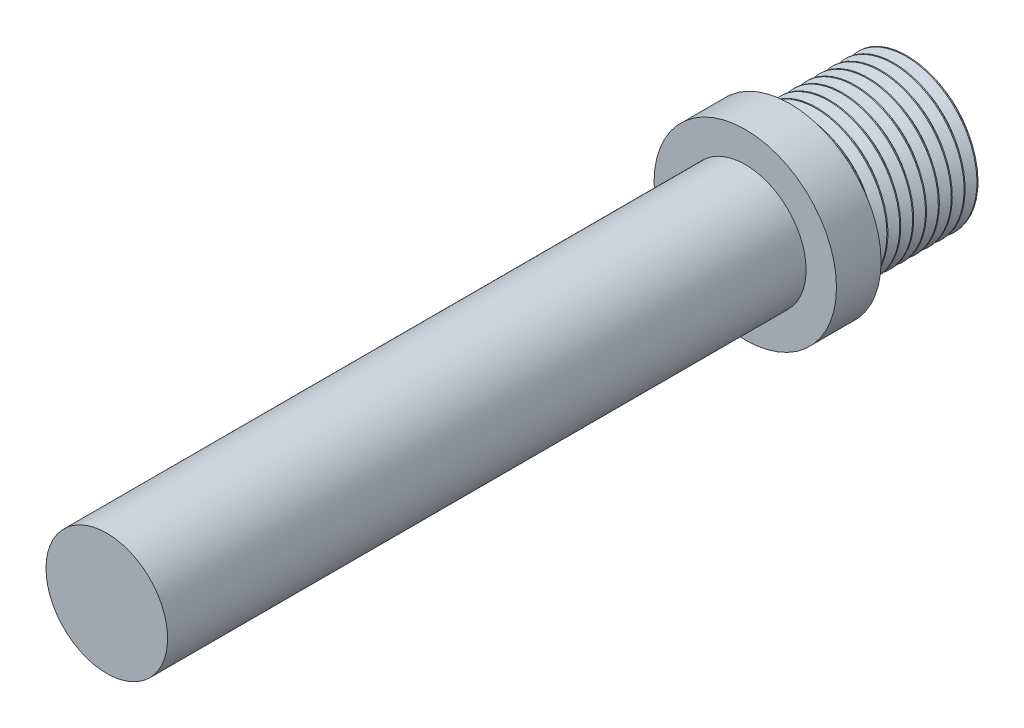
ISO-10303-21;
HEADER;
FILE_DESCRIPTION(('STEP AP214'),'2;1');
FILE_NAME('part.step','',(''),(''),'','','');
FILE_SCHEMA(('AUTOMOTIVE_DESIGN { 1 0 10303 214 1 1 1 1 }'));
ENDSEC;
DATA;
#1=APPLICATION_CONTEXT('core data for automotive mechanical design processes');
#2=APPLICATION_PROTOCOL_DEFINITION('international standard','automotive_design',2000,#1);
#3=PRODUCT_CONTEXT('',#1,'mechanical');
#4=PRODUCT('Part','Part','',(#3));
#5=PRODUCT_RELATED_PRODUCT_CATEGORY('part','',(#4));
#6=PRODUCT_DEFINITION_FORMATION('','',#4);
#7=PRODUCT_DEFINITION_CONTEXT('part definition',#1,'design');
#8=PRODUCT_DEFINITION('design','',#6,#7);
#9=PRODUCT_DEFINITION_SHAPE('','',#8);
#10=(LENGTH_UNIT() NAMED_UNIT(*) SI_UNIT(.MILLI.,.METRE.));
#11=(NAMED_UNIT(*) PLANE_ANGLE_UNIT() SI_UNIT($,.RADIAN.));
#12=(NAMED_UNIT(*) SI_UNIT($,.STERADIAN.) SOLID_ANGLE_UNIT());
#13=UNCERTAINTY_MEASURE_WITH_UNIT(LENGTH_MEASURE(1.E-05),#10,'distance_accuracy_value','');
#14=(GEOMETRIC_REPRESENTATION_CONTEXT(3) GLOBAL_UNCERTAINTY_ASSIGNED_CONTEXT((#13)) GLOBAL_UNIT_ASSIGNED_CONTEXT((#10,
#11,#12)) REPRESENTATION_CONTEXT('',''));
#15=CARTESIAN_POINT('',(0.,0.,0.));
#16=DIRECTION('',(0.,0.,1.));
#17=DIRECTION('',(1.,0.,0.));
#18=AXIS2_PLACEMENT_3D('',#15,#16,#17);
#19=CARTESIAN_POINT('',(172.5,0.,67.1));
#20=DIRECTION('',(0.,0.,1.));
#21=DIRECTION('',(1.,0.,0.));
#22=AXIS2_PLACEMENT_3D('',#19,#20,#21);
#23=PLANE('',#22);
#24=CARTESIAN_POINT('',(178.865982,-1.20295900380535E-13,67.1));
#25=CARTESIAN_POINT('',(178.873334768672,-0.181744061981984,67.1));
#26=CARTESIAN_POINT('',(178.872983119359,-0.363796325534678,67.1));
#27=CARTESIAN_POINT('',(178.856958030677,-0.727219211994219,67.1));
#28=CARTESIAN_POINT('',(178.841285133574,-0.908589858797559,67.1));
#29=CARTESIAN_POINT('',(178.794718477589,-1.2692609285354,67.1));
#30=CARTESIAN_POINT('',(178.763833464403,-1.44856248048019,67.1));
#31=CARTESIAN_POINT('',(178.687072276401,-1.80392311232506,67.1));
#32=CARTESIAN_POINT('',(178.641196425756,-1.97998226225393,67.1));
#33=CARTESIAN_POINT('',(178.534749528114,-2.32770165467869,67.1));
#34=CARTESIAN_POINT('',(178.474170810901,-2.49935954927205,67.1));
#35=CARTESIAN_POINT('',(178.338762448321,-2.83695899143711,67.1));
#36=CARTESIAN_POINT('',(178.263932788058,-3.00290053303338,67.1));
#37=CARTESIAN_POINT('',(178.100586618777,-3.32782645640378,67.1));
#38=CARTESIAN_POINT('',(178.012075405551,-3.48681349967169,67.1));
#39=CARTESIAN_POINT('',(177.821982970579,-3.79675118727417,67.1));
#40=CARTESIAN_POINT('',(177.720402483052,-3.94770228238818,67.1));
#41=CARTESIAN_POINT('',(177.504971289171,-4.2404206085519,67.1));
#42=CARTESIAN_POINT('',(177.391130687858,-4.38219525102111,67.1));
#43=CARTESIAN_POINT('',(177.211734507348,-4.58723315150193,67.1));
#44=CARTESIAN_POINT('',(177.150490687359,-4.6543141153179,67.1));
#45=CARTESIAN_POINT('',(177.025304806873,-4.78593253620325,67.1));
#46=CARTESIAN_POINT('',(176.961362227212,-4.8504694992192,67.1));
#47=CARTESIAN_POINT('',(176.765641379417,-5.04011059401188,67.1));
#48=CARTESIAN_POINT('',(176.629971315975,-5.16124343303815,67.1));
#49=CARTESIAN_POINT('',(176.349176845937,-5.39207040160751,67.1));
#50=CARTESIAN_POINT('',(176.204049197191,-5.50176057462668,67.1));
#51=CARTESIAN_POINT('',(175.902106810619,-5.7111787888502,67.1));
#52=CARTESIAN_POINT('',(175.745107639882,-5.8106412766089,67.1));
#53=CARTESIAN_POINT('',(175.423315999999,-5.99617180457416,67.1));
#54=CARTESIAN_POINT('',(175.258520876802,-6.0822352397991,67.1));
#55=CARTESIAN_POINT('',(174.92242693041,-6.24028559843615,67.1));
#56=CARTESIAN_POINT('',(174.751131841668,-6.31228046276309,67.1));
#57=CARTESIAN_POINT('',(174.403140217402,-6.44175351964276,67.1));
#58=CARTESIAN_POINT('',(174.226443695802,-6.49923174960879,67.1));
#59=CARTESIAN_POINT('',(173.866837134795,-6.59984671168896,67.1));
#60=CARTESIAN_POINT('',(173.683879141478,-6.64281188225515,67.1));
#61=CARTESIAN_POINT('',(173.31506674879,-6.71316037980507,67.1));
#62=CARTESIAN_POINT('',(173.129213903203,-6.74055178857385,67.1));
#63=CARTESIAN_POINT('',(172.849182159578,-6.7698486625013,67.1));
#64=CARTESIAN_POINT('',(172.755586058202,-6.77765012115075,67.1));
#65=CARTESIAN_POINT('',(172.568164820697,-6.78928643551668,67.1));
#66=CARTESIAN_POINT('',(172.474339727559,-6.79312198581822,67.1));
#67=CARTESIAN_POINT('',(172.19272721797,-6.79887690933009,67.1));
#68=CARTESIAN_POINT('',(172.004791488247,-6.79504568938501,67.1));
#69=CARTESIAN_POINT('',(171.628261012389,-6.77195022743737,67.1));
#70=CARTESIAN_POINT('',(171.43967460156,-6.75255293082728,67.1));
#71=CARTESIAN_POINT('',(171.064743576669,-6.69829618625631,67.1));
#72=CARTESIAN_POINT('',(170.878398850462,-6.66343751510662,67.1));
#73=CARTESIAN_POINT('',(170.509279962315,-6.57850762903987,67.1));
#74=CARTESIAN_POINT('',(170.326504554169,-6.52844182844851,67.1));
#75=CARTESIAN_POINT('',(169.965614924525,-6.41340809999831,67.1));
#76=CARTESIAN_POINT('',(169.787502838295,-6.34843347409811,67.1));
#77=CARTESIAN_POINT('',(169.433183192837,-6.20236488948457,67.1));
#78=CARTESIAN_POINT('',(169.25711484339,-6.1209330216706,67.1));
#79=CARTESIAN_POINT('',(168.912539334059,-5.94356195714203,67.1));
#80=CARTESIAN_POINT('',(168.744028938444,-5.84762904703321,67.1));
#81=CARTESIAN_POINT('',(168.415643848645,-5.64188697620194,67.1));
#82=CARTESIAN_POINT('',(168.255771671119,-5.5320738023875,67.1));
#83=CARTESIAN_POINT('',(167.945822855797,-5.29935941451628,67.1));
#84=CARTESIAN_POINT('',(167.795746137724,-5.17645830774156,67.1));
#85=CARTESIAN_POINT('',(167.578928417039,-4.98305488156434,67.1));
#86=CARTESIAN_POINT('',(167.508070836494,-4.91711234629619,67.1));
#87=CARTESIAN_POINT('',(167.369099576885,-4.78239822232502,67.1));
#88=CARTESIAN_POINT('',(167.300985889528,-4.71362664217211,67.1));
#89=CARTESIAN_POINT('',(167.100947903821,-4.50322002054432,67.1));
#90=CARTESIAN_POINT('',(166.973302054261,-4.35747110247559,67.1));
#91=CARTESIAN_POINT('',(166.730300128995,-4.05600018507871,67.1));
#92=CARTESIAN_POINT('',(166.614948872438,-3.90027431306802,67.1));
#93=CARTESIAN_POINT('',(166.397350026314,-3.57992548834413,67.1));
#94=CARTESIAN_POINT('',(166.29510189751,-3.41530290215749,67.1));
#95=CARTESIAN_POINT('',(166.101495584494,-3.07313931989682,67.1));
#96=CARTESIAN_POINT('',(166.010562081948,-2.89535788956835,67.1));
#97=CARTESIAN_POINT('',(165.843975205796,-2.53277318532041,67.1));
#98=CARTESIAN_POINT('',(165.768321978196,-2.34796984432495,67.1));
#99=CARTESIAN_POINT('',(165.632900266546,-1.97284276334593,67.1));
#100=CARTESIAN_POINT('',(165.573115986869,-1.7825247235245,67.1));
#101=CARTESIAN_POINT('',(165.469774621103,-1.3976100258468,67.1));
#102=CARTESIAN_POINT('',(165.426210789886,-1.20301518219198,67.1000000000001));
#103=CARTESIAN_POINT('',(165.36093051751,-0.840540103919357,67.1000000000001));
#104=CARTESIAN_POINT('',(165.336906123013,-0.673071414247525,67.1));
#105=CARTESIAN_POINT('',(165.300881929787,-0.33714220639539,67.1));
#106=CARTESIAN_POINT('',(165.288861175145,-0.168683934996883,67.1));
#107=CARTESIAN_POINT('',(165.282867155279,1.35495978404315E-13,67.1));
#108=B_SPLINE_CURVE_WITH_KNOTS('',3,(#24,#25,#26,#27,#28,#29,#30,#31,#32,#33,#34,#35,#36,#37,
#38,#39,#40,#41,#42,#43,#44,#45,#46,#47,#48,#49,#50,#51,#52,#53,#54,#55,#56,#57,#58,#59,#60,#61,
#62,#63,#64,#65,#66,#67,#68,#69,#70,#71,#72,#73,#74,#75,#76,#77,#78,#79,#80,#81,#82,#83,#84,#85,
#86,#87,#88,#89,#90,#91,#92,#93,#94,#95,#96,#97,#98,#99,#100,#101,#102,#103,#104,#105,#106,
#107),.UNSPECIFIED.,.F.,.F.,(4,2,2,2,2,2,2,2,2,2,2,2,2,2,2,2,2,2,2,2,2,2,2,2,2,2,2,2,2,2,2,2,2,
2,2,2,2,2,2,2,2,4),(0.,0.545511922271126,1.09100453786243,1.63618390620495,2.18135148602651,
2.72680408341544,3.27225725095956,3.81749981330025,4.36271175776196,4.90747771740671,
5.17990956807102,5.45239406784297,5.9973690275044,6.54253180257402,7.0994402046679,
7.65653958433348,8.21332359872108,8.77010617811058,9.33325736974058,9.89611605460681,
10.1778052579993,10.4594451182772,11.0226915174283,11.5908043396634,12.1588886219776,
12.7267708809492,13.2949087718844,13.8761803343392,14.4572006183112,15.0383892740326,
15.619573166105,15.909885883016,16.2001977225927,16.7807226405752,17.3614742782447,
17.942202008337,18.540554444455,19.1389125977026,19.7366729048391,20.3341843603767,
20.8413135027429,21.3475557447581),.UNSPECIFIED.);
#109=CARTESIAN_POINT('',(178.865982,-1.18736684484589E-13,67.1));
#110=VERTEX_POINT('',#109);
#111=CARTESIAN_POINT('',(165.612245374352,-1.8999634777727,67.1));
#112=VERTEX_POINT('',#111);
#113=EDGE_CURVE('E78',#110,#112,#108,.T.);
#114=ORIENTED_EDGE('',*,*,#113,.T.);
#115=CARTESIAN_POINT('',(172.5,0.,67.1));
#116=DIRECTION('',(0.,0.,-1.));
#117=DIRECTION('',(-1.,0.,0.));
#118=AXIS2_PLACEMENT_3D('',#115,#116,#117);
#119=CIRCLE('',#118,7.14500000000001);
#120=CARTESIAN_POINT('',(165.612245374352,1.89996347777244,67.1));
#121=VERTEX_POINT('',#120);
#122=EDGE_CURVE('E11',#112,#121,#119,.T.);
#123=ORIENTED_EDGE('',*,*,#122,.T.);
#124=CARTESIAN_POINT('',(165.282867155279,1.35495978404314E-13,67.1));
#125=CARTESIAN_POINT('',(165.289600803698,0.18969391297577,67.1));
#126=CARTESIAN_POINT('',(165.303967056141,0.379113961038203,67.1));
#127=CARTESIAN_POINT('',(165.347796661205,0.756189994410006,67.1));
#128=CARTESIAN_POINT('',(165.377259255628,0.943846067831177,67.1));
#129=CARTESIAN_POINT('',(165.451078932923,1.3160195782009,67.1));
#130=CARTESIAN_POINT('',(165.495421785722,1.50053983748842,67.1));
#131=CARTESIAN_POINT('',(165.598720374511,1.86544352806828,67.1));
#132=CARTESIAN_POINT('',(165.657676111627,2.04582695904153,67.1));
#133=CARTESIAN_POINT('',(165.789849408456,2.40136620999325,67.1));
#134=CARTESIAN_POINT('',(165.86307217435,2.5765200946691,67.1));
#135=CARTESIAN_POINT('',(166.02329575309,2.92040772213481,67.1));
#136=CARTESIAN_POINT('',(166.110296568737,3.08914146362,67.1));
#137=CARTESIAN_POINT('',(166.297542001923,3.41914682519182,67.1));
#138=CARTESIAN_POINT('',(166.397789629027,3.5804167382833,67.1));
#139=CARTESIAN_POINT('',(166.610869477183,3.8944219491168,67.1));
#140=CARTESIAN_POINT('',(166.72370258,4.04715664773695,67.1));
#141=CARTESIAN_POINT('',(166.967585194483,4.35102110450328,67.1));
#142=CARTESIAN_POINT('',(167.099285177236,4.50163117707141,67.1));
#143=CARTESIAN_POINT('',(167.305965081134,4.71878146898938,67.1));
#144=CARTESIAN_POINT('',(167.376388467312,4.78971157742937,67.1));
#145=CARTESIAN_POINT('',(167.520159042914,4.92854557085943,67.1));
#146=CARTESIAN_POINT('',(167.593506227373,4.99644946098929,67.1));
#147=CARTESIAN_POINT('',(167.817863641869,5.19524895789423,67.1));
#148=CARTESIAN_POINT('',(167.973236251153,5.32128146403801,67.1));
#149=CARTESIAN_POINT('',(168.294310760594,5.5593633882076,67.1));
#150=CARTESIAN_POINT('',(168.460012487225,5.6714130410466,67.0999999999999));
#151=CARTESIAN_POINT('',(168.797622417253,5.87891087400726,67.0999999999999));
#152=CARTESIAN_POINT('',(168.969376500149,5.97460967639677,67.1));
#153=CARTESIAN_POINT('',(169.320508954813,6.15103154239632,67.1));
#154=CARTESIAN_POINT('',(169.499890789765,6.23174771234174,67.1));
#155=CARTESIAN_POINT('',(169.864941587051,6.37757815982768,67.1));
#156=CARTESIAN_POINT('',(170.050612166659,6.44268838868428,67.1));
#157=CARTESIAN_POINT('',(170.426753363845,6.55677725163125,67.1));
#158=CARTESIAN_POINT('',(170.617221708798,6.605763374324,67.1));
#159=CARTESIAN_POINT('',(170.999041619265,6.68673581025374,67.1));
#160=CARTESIAN_POINT('',(171.190346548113,6.71894269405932,67.1));
#161=CARTESIAN_POINT('',(171.575025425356,6.76712736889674,67.1));
#162=CARTESIAN_POINT('',(171.768399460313,6.78310447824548,67.1));
#163=CARTESIAN_POINT('',(172.058872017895,6.79479696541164,67.1));
#164=CARTESIAN_POINT('',(172.155761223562,6.79664908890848,67.1));
#165=CARTESIAN_POINT('',(172.349532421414,6.79629121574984,67.1));
#166=CARTESIAN_POINT('',(172.446414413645,6.79408149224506,67.1));
#167=CARTESIAN_POINT('',(172.639982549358,6.78548587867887,67.1));
#168=CARTESIAN_POINT('',(172.736668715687,6.77910050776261,67.1));
#169=CARTESIAN_POINT('',(172.929682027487,6.76212296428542,67.1));
#170=CARTESIAN_POINT('',(173.026009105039,6.75153003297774,67.1));
#171=CARTESIAN_POINT('',(173.312741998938,6.71366793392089,67.1));
#172=CARTESIAN_POINT('',(173.502374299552,6.68024941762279,67.1));
#173=CARTESIAN_POINT('',(173.878060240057,6.59717055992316,67.1));
#174=CARTESIAN_POINT('',(174.064113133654,6.54750686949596,67.1));
#175=CARTESIAN_POINT('',(174.431297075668,6.43229212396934,67.1));
#176=CARTESIAN_POINT('',(174.612426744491,6.36673666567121,67.1));
#177=CARTESIAN_POINT('',(174.968262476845,6.22026963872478,67.1));
#178=CARTESIAN_POINT('',(175.142971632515,6.13936558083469,67.1));
#179=CARTESIAN_POINT('',(175.480727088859,5.96486661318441,67.1));
#180=CARTESIAN_POINT('',(175.643951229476,5.87161579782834,67.1));
#181=CARTESIAN_POINT('',(175.961959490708,5.67169673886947,67.1));
#182=CARTESIAN_POINT('',(176.116743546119,5.56502839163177,67.1));
#183=CARTESIAN_POINT('',(176.416771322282,5.33902896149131,67.1));
#184=CARTESIAN_POINT('',(176.562016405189,5.21969969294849,67.1));
#185=CARTESIAN_POINT('',(176.771921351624,5.03188418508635,67.1));
#186=CARTESIAN_POINT('',(176.840569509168,4.96780138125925,67.1));
#187=CARTESIAN_POINT('',(176.975112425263,4.8367988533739,67.1));
#188=CARTESIAN_POINT('',(177.041007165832,4.76987911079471,67.1));
#189=CARTESIAN_POINT('',(177.169987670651,4.63321884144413,67.1));
#190=CARTESIAN_POINT('',(177.233069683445,4.56347477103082,67.1));
#191=CARTESIAN_POINT('',(177.356112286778,4.42129479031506,67.1));
#192=CARTESIAN_POINT('',(177.416072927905,4.34885892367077,67.1));
#193=CARTESIAN_POINT('',(177.591129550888,4.12774208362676,67.1));
#194=CARTESIAN_POINT('',(177.701432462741,3.97521773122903,67.1));
#195=CARTESIAN_POINT('',(177.908325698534,3.66114076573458,67.1));
#196=CARTESIAN_POINT('',(178.004914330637,3.49958704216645,67.1));
#197=CARTESIAN_POINT('',(178.183653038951,3.16867474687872,67.1));
#198=CARTESIAN_POINT('',(178.265803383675,2.99931632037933,67.1));
#199=CARTESIAN_POINT('',(178.412695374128,2.65949940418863,67.1));
#200=CARTESIAN_POINT('',(178.477901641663,2.48924146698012,67.1));
#201=CARTESIAN_POINT('',(178.593710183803,2.14382950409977,67.1));
#202=CARTESIAN_POINT('',(178.644312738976,1.96867557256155,67.1));
#203=CARTESIAN_POINT('',(178.730501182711,1.61493877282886,67.1));
#204=CARTESIAN_POINT('',(178.766104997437,1.43636026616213,67.1));
#205=CARTESIAN_POINT('',(178.822118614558,1.07690570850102,67.1));
#206=CARTESIAN_POINT('',(178.842535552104,0.896030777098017,67.1));
#207=CARTESIAN_POINT('',(178.863668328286,0.595646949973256,67.1));
#208=CARTESIAN_POINT('',(178.868744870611,0.476427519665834,67.1));
#209=CARTESIAN_POINT('',(178.872297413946,0.238098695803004,67.1));
#210=CARTESIAN_POINT('',(178.870784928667,0.118989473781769,67.1));
#211=CARTESIAN_POINT('',(178.865982,-1.20295900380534E-13,67.1));
#212=B_SPLINE_CURVE_WITH_KNOTS('',3,(#124,#125,#126,#127,#128,#129,#130,#131,#132,#133,#134,
#135,#136,#137,#138,#139,#140,#141,#142,#143,#144,#145,#146,#147,#148,#149,#150,#151,#152,#153,
#154,#155,#156,#157,#158,#159,#160,#161,#162,#163,#164,#165,#166,#167,#168,#169,#170,#171,#172,
#173,#174,#175,#176,#177,#178,#179,#180,#181,#182,#183,#184,#185,#186,#187,#188,#189,#190,#191,
#192,#193,#194,#195,#196,#197,#198,#199,#200,#201,#202,#203,#204,#205,#206,#207,#208,#209,#210,
#211),.UNSPECIFIED.,.F.,.F.,(4,2,2,2,2,2,2,2,2,2,2,2,2,2,2,2,2,2,2,2,2,2,2,2,2,2,2,2,2,2,2,2,2,
2,2,2,2,2,2,2,2,2,2,4),(0.,0.56928415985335,1.13853973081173,1.70725246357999,2.27596524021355,
2.84488593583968,3.41380674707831,3.98285703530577,4.55194721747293,5.15137753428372,
5.45116009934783,5.75094215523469,6.35030410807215,6.94965599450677,7.53878235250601,
8.12817910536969,8.71772860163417,9.30700390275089,9.88832395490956,10.4696684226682,
10.760319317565,11.0509506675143,11.3415458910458,11.6321935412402,12.2090748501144,
12.7860751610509,13.3632355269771,13.9401141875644,14.5033949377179,15.06668003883,
15.6298845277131,15.9115473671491,16.1932120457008,16.4752417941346,16.7572669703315,
17.3211769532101,17.8851564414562,18.4491254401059,18.9954324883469,19.5417290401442,
20.0873708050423,20.6327560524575,20.990568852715,21.3477566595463),.UNSPECIFIED.);
#213=EDGE_CURVE('E50',#121,#110,#212,.T.);
#214=ORIENTED_EDGE('',*,*,#213,.T.);
#215=EDGE_LOOP('',(#114,#123,#214));
#216=FACE_BOUND('',#215,.T.);
#217=ADVANCED_FACE('F36',(#216),#23,.F.);
#218=CARTESIAN_POINT('',(172.5,0.,62.1));
#219=DIRECTION('',(0.,0.,-1.));
#220=DIRECTION('',(-1.,0.,0.));
#221=AXIS2_PLACEMENT_3D('',#218,#219,#220);
#222=CYLINDRICAL_SURFACE('',#221,7.14500000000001);
#223=CARTESIAN_POINT('',(179.645,-1.35016751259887E-13,65.2488146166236));
#224=CARTESIAN_POINT('',(179.645,-2.9595559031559,65.3281896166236));
#225=CARTESIAN_POINT('',(177.552277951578,-5.05227795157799,65.4075646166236));
#226=CARTESIAN_POINT('',(175.459555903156,-7.14500000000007,65.4869396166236));
#227=CARTESIAN_POINT('',(172.5,-7.14500000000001,65.5663146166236));
#228=CARTESIAN_POINT('',(169.540444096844,-7.14499999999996,65.6456896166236));
#229=CARTESIAN_POINT('',(167.447722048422,-5.0522779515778,65.7250646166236));
#230=CARTESIAN_POINT('',(165.355,-2.95955590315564,65.8044396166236));
#231=CARTESIAN_POINT('',(165.355,1.34141741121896E-13,65.8838146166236));
#232=CARTESIAN_POINT('',(165.355,2.9595559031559,65.9631896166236));
#233=CARTESIAN_POINT('',(167.447722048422,5.05227795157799,66.0425646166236));
#234=CARTESIAN_POINT('',(169.540444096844,7.14500000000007,66.1219396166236));
#235=CARTESIAN_POINT('',(172.5,7.14500000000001,66.2013146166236));
#236=CARTESIAN_POINT('',(175.459555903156,7.14499999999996,66.2806896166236));
#237=CARTESIAN_POINT('',(177.552277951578,5.0522779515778,66.3600646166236));
#238=CARTESIAN_POINT('',(179.645,2.95955590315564,66.4394396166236));
#239=CARTESIAN_POINT('',(179.645,-1.35016751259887E-13,66.5188146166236));
#240=CARTESIAN_POINT('',(179.645,-2.9595559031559,66.5981896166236));
#241=CARTESIAN_POINT('',(177.552277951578,-5.05227795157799,66.6775646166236));
#242=CARTESIAN_POINT('',(175.459555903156,-7.14500000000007,66.7569396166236));
#243=CARTESIAN_POINT('',(172.5,-7.14500000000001,66.8363146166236));
#244=CARTESIAN_POINT('',(169.540444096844,-7.14499999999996,66.9156896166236));
#245=CARTESIAN_POINT('',(167.447722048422,-5.0522779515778,66.9950646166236));
#246=CARTESIAN_POINT('',(165.355,-2.95955590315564,67.0744396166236));
#247=CARTESIAN_POINT('',(165.355,1.34141741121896E-13,67.1538146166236));
#248=CARTESIAN_POINT('',(165.355,2.9595559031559,67.2331896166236));
#249=CARTESIAN_POINT('',(167.447722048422,5.05227795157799,67.3125646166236));
#250=CARTESIAN_POINT('',(169.540444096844,7.14500000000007,67.3919396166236));
#251=CARTESIAN_POINT('',(172.5,7.14500000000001,67.4713146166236));
#252=CARTESIAN_POINT('',(175.459555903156,7.14499999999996,67.5506896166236));
#253=CARTESIAN_POINT('',(177.552277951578,5.0522779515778,67.6300646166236));
#254=CARTESIAN_POINT('',(179.645,2.95955590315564,67.7094396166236));
#255=CARTESIAN_POINT('',(179.645,-1.35016751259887E-13,67.7888146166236));
#256=CARTESIAN_POINT('',(179.645,-2.9595559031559,67.8681896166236));
#257=CARTESIAN_POINT('',(177.552277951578,-5.05227795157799,67.9475646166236));
#258=CARTESIAN_POINT('',(175.459555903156,-7.14500000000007,68.0269396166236));
#259=CARTESIAN_POINT('',(172.5,-7.14500000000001,68.1063146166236));
#260=CARTESIAN_POINT('',(169.540444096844,-7.14499999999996,68.1856896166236));
#261=CARTESIAN_POINT('',(167.447722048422,-5.0522779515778,68.2650646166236));
#262=CARTESIAN_POINT('',(165.355,-2.95955590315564,68.3444396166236));
#263=CARTESIAN_POINT('',(165.355,1.34141741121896E-13,68.4238146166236));
#264=CARTESIAN_POINT('',(165.355,2.9595559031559,68.5031896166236));
#265=CARTESIAN_POINT('',(167.447722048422,5.05227795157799,68.5825646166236));
#266=CARTESIAN_POINT('',(169.540444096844,7.14500000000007,68.6619396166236));
#267=CARTESIAN_POINT('',(172.5,7.14500000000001,68.7413146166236));
#268=CARTESIAN_POINT('',(175.459555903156,7.14499999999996,68.8206896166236));
#269=CARTESIAN_POINT('',(177.552277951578,5.0522779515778,68.9000646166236));
#270=CARTESIAN_POINT('',(179.645,2.95955590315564,68.9794396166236));
#271=CARTESIAN_POINT('',(179.645,-1.35016751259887E-13,69.0588146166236));
#272=CARTESIAN_POINT('',(179.645,-2.9595559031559,69.1381896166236));
#273=CARTESIAN_POINT('',(177.552277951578,-5.05227795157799,69.2175646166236));
#274=CARTESIAN_POINT('',(175.459555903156,-7.14500000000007,69.2969396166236));
#275=CARTESIAN_POINT('',(172.5,-7.14500000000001,69.3763146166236));
#276=CARTESIAN_POINT('',(169.540444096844,-7.14499999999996,69.4556896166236));
#277=CARTESIAN_POINT('',(167.447722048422,-5.0522779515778,69.5350646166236));
#278=CARTESIAN_POINT('',(165.355,-2.95955590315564,69.6144396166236));
#279=CARTESIAN_POINT('',(165.355,1.34141741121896E-13,69.6938146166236));
#280=CARTESIAN_POINT('',(165.355,2.9595559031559,69.7731896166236));
#281=CARTESIAN_POINT('',(167.447722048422,5.05227795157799,69.8525646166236));
#282=CARTESIAN_POINT('',(169.540444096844,7.14500000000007,69.9319396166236));
#283=CARTESIAN_POINT('',(172.5,7.14500000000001,70.0113146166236));
#284=CARTESIAN_POINT('',(175.459555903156,7.14499999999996,70.0906896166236));
#285=CARTESIAN_POINT('',(177.552277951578,5.0522779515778,70.1700646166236));
#286=CARTESIAN_POINT('',(179.645,2.95955590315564,70.2494396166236));
#287=CARTESIAN_POINT('',(179.645,-1.35016751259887E-13,70.3288146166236));
#288=CARTESIAN_POINT('',(179.645,-2.9595559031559,70.4081896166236));
#289=CARTESIAN_POINT('',(177.552277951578,-5.05227795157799,70.4875646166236));
#290=CARTESIAN_POINT('',(175.459555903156,-7.14500000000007,70.5669396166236));
#291=CARTESIAN_POINT('',(172.5,-7.14500000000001,70.6463146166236));
#292=CARTESIAN_POINT('',(169.540444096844,-7.14499999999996,70.7256896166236));
#293=CARTESIAN_POINT('',(167.447722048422,-5.0522779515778,70.8050646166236));
#294=CARTESIAN_POINT('',(165.355,-2.95955590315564,70.8844396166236));
#295=CARTESIAN_POINT('',(165.355,1.34141741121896E-13,70.9638146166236));
#296=CARTESIAN_POINT('',(165.355,2.9595559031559,71.0431896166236));
#297=CARTESIAN_POINT('',(167.447722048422,5.05227795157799,71.1225646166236));
#298=CARTESIAN_POINT('',(169.540444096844,7.14500000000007,71.2019396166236));
#299=CARTESIAN_POINT('',(172.5,7.14500000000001,71.2813146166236));
#300=CARTESIAN_POINT('',(175.459555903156,7.14499999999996,71.3606896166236));
#301=CARTESIAN_POINT('',(177.552277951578,5.0522779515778,71.4400646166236));
#302=CARTESIAN_POINT('',(179.645,2.95955590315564,71.5194396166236));
#303=CARTESIAN_POINT('',(179.645,-1.35016751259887E-13,71.5988146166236));
#304=CARTESIAN_POINT('',(179.645,-2.9595559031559,71.6781896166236));
#305=CARTESIAN_POINT('',(177.552277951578,-5.05227795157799,71.7575646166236));
#306=CARTESIAN_POINT('',(175.459555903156,-7.14500000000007,71.8369396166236));
#307=CARTESIAN_POINT('',(172.5,-7.14500000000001,71.9163146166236));
#308=CARTESIAN_POINT('',(169.540444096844,-7.14499999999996,71.9956896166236));
#309=CARTESIAN_POINT('',(167.447722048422,-5.0522779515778,72.0750646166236));
#310=CARTESIAN_POINT('',(165.355,-2.95955590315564,72.1544396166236));
#311=CARTESIAN_POINT('',(165.355,1.34141741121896E-13,72.2338146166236));
#312=CARTESIAN_POINT('',(165.355,2.9595559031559,72.3131896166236));
#313=CARTESIAN_POINT('',(167.447722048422,5.05227795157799,72.3925646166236));
#314=CARTESIAN_POINT('',(169.540444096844,7.14500000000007,72.4719396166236));
#315=CARTESIAN_POINT('',(172.5,7.14500000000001,72.5513146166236));
#316=CARTESIAN_POINT('',(175.459555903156,7.14499999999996,72.6306896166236));
#317=CARTESIAN_POINT('',(177.552277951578,5.0522779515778,72.7100646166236));
#318=CARTESIAN_POINT('',(179.645,2.95955590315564,72.7894396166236));
#319=CARTESIAN_POINT('',(179.645,-1.35016751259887E-13,72.8688146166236));
#320=CARTESIAN_POINT('',(179.645,-2.9595559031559,72.9481896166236));
#321=CARTESIAN_POINT('',(177.552277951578,-5.05227795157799,73.0275646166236));
#322=CARTESIAN_POINT('',(175.459555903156,-7.14500000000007,73.1069396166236));
#323=CARTESIAN_POINT('',(172.5,-7.14500000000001,73.1863146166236));
#324=CARTESIAN_POINT('',(169.540444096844,-7.14499999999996,73.2656896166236));
#325=CARTESIAN_POINT('',(167.447722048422,-5.0522779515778,73.3450646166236));
#326=CARTESIAN_POINT('',(165.355,-2.95955590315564,73.4244396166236));
#327=CARTESIAN_POINT('',(165.355,1.34141741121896E-13,73.5038146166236));
#328=CARTESIAN_POINT('',(165.355,2.9595559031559,73.5831896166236));
#329=CARTESIAN_POINT('',(167.447722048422,5.05227795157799,73.6625646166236));
#330=CARTESIAN_POINT('',(169.540444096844,7.14500000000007,73.7419396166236));
#331=CARTESIAN_POINT('',(172.5,7.14500000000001,73.8213146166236));
#332=CARTESIAN_POINT('',(175.459555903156,7.14499999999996,73.9006896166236));
#333=CARTESIAN_POINT('',(177.552277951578,5.0522779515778,73.9800646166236));
#334=CARTESIAN_POINT('',(179.645,2.95955590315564,74.0594396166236));
#335=CARTESIAN_POINT('',(179.645,-1.35016751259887E-13,74.1388146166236));
#336=CARTESIAN_POINT('',(179.645,-2.9595559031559,74.2181896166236));
#337=CARTESIAN_POINT('',(177.552277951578,-5.05227795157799,74.2975646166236));
#338=CARTESIAN_POINT('',(175.459555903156,-7.14500000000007,74.3769396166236));
#339=CARTESIAN_POINT('',(172.5,-7.14500000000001,74.4563146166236));
#340=CARTESIAN_POINT('',(169.540444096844,-7.14499999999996,74.5356896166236));
#341=CARTESIAN_POINT('',(167.447722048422,-5.0522779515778,74.6150646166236));
#342=CARTESIAN_POINT('',(165.355,-2.95955590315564,74.6944396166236));
#343=CARTESIAN_POINT('',(165.355,1.34141741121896E-13,74.7738146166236));
#344=CARTESIAN_POINT('',(165.355,2.9595559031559,74.8531896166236));
#345=CARTESIAN_POINT('',(167.447722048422,5.05227795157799,74.9325646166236));
#346=CARTESIAN_POINT('',(169.540444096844,7.14500000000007,75.0119396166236));
#347=CARTESIAN_POINT('',(172.5,7.14500000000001,75.0913146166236));
#348=CARTESIAN_POINT('',(175.459555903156,7.14499999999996,75.1706896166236));
#349=CARTESIAN_POINT('',(177.552277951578,5.0522779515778,75.2500646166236));
#350=CARTESIAN_POINT('',(179.645,2.95955590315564,75.3294396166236));
#351=CARTESIAN_POINT('',(179.645,-1.35016751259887E-13,75.4088146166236));
#352=CARTESIAN_POINT('',(179.645,-2.9595559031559,75.4881896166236));
#353=CARTESIAN_POINT('',(177.552277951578,-5.05227795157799,75.5675646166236));
#354=CARTESIAN_POINT('',(175.459555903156,-7.14500000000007,75.6469396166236));
#355=CARTESIAN_POINT('',(172.5,-7.14500000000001,75.7263146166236));
#356=CARTESIAN_POINT('',(169.540444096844,-7.14499999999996,75.8056896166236));
#357=CARTESIAN_POINT('',(167.447722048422,-5.0522779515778,75.8850646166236));
#358=CARTESIAN_POINT('',(165.355,-2.95955590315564,75.9644396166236));
#359=CARTESIAN_POINT('',(165.355,1.34141741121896E-13,76.0438146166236));
#360=CARTESIAN_POINT('',(165.355,2.9595559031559,76.1231896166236));
#361=CARTESIAN_POINT('',(167.447722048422,5.05227795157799,76.2025646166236));
#362=CARTESIAN_POINT('',(169.540444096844,7.14500000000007,76.2819396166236));
#363=CARTESIAN_POINT('',(172.5,7.14500000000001,76.3613146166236));
#364=CARTESIAN_POINT('',(175.459555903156,7.14499999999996,76.4406896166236));
#365=CARTESIAN_POINT('',(177.552277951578,5.0522779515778,76.5200646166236));
#366=CARTESIAN_POINT('',(179.645,2.95955590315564,76.5994396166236));
#367=CARTESIAN_POINT('',(179.645,-1.35016751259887E-13,76.6788146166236));
#368=CARTESIAN_POINT('',(179.645,-2.9595559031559,76.7581896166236));
#369=CARTESIAN_POINT('',(177.552277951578,-5.05227795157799,76.8375646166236));
#370=CARTESIAN_POINT('',(175.459555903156,-7.14500000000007,76.9169396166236));
#371=CARTESIAN_POINT('',(172.5,-7.14500000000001,76.9963146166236));
#372=CARTESIAN_POINT('',(169.540444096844,-7.14499999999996,77.0756896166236));
#373=CARTESIAN_POINT('',(167.447722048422,-5.0522779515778,77.1550646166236));
#374=CARTESIAN_POINT('',(165.355,-2.95955590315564,77.2344396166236));
#375=CARTESIAN_POINT('',(165.355,1.34141741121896E-13,77.3138146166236));
#376=CARTESIAN_POINT('',(165.355,2.9595559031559,77.3931896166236));
#377=CARTESIAN_POINT('',(167.447722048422,5.05227795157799,77.4725646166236));
#378=CARTESIAN_POINT('',(169.540444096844,7.14500000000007,77.5519396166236));
#379=CARTESIAN_POINT('',(172.5,7.14500000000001,77.6313146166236));
#380=CARTESIAN_POINT('',(175.459555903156,7.14499999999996,77.7106896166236));
#381=CARTESIAN_POINT('',(177.552277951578,5.0522779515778,77.7900646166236));
#382=CARTESIAN_POINT('',(179.645,2.95955590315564,77.8694396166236));
#383=CARTESIAN_POINT('',(179.645,-1.35016751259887E-13,77.9488146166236));
#384=CARTESIAN_POINT('',(179.645,-2.9595559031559,78.0281896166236));
#385=CARTESIAN_POINT('',(177.552277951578,-5.05227795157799,78.1075646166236));
#386=CARTESIAN_POINT('',(175.459555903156,-7.14500000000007,78.1869396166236));
#387=CARTESIAN_POINT('',(172.5,-7.14500000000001,78.2663146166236));
#388=CARTESIAN_POINT('',(169.540444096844,-7.14499999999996,78.3456896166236));
#389=CARTESIAN_POINT('',(167.447722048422,-5.0522779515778,78.4250646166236));
#390=CARTESIAN_POINT('',(165.355,-2.95955590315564,78.5044396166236));
#391=CARTESIAN_POINT('',(165.355,1.34141741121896E-13,78.5838146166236));
#392=CARTESIAN_POINT('',(165.355,2.9595559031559,78.6631896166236));
#393=CARTESIAN_POINT('',(167.447722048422,5.05227795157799,78.7425646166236));
#394=CARTESIAN_POINT('',(169.540444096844,7.14500000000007,78.8219396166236));
#395=CARTESIAN_POINT('',(172.5,7.14500000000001,78.9013146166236));
#396=CARTESIAN_POINT('',(175.459555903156,7.14499999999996,78.9806896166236));
#397=CARTESIAN_POINT('',(177.552277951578,5.0522779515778,79.0600646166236));
#398=CARTESIAN_POINT('',(179.645,2.95955590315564,79.1394396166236));
#399=CARTESIAN_POINT('',(179.645,-1.35016751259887E-13,79.2188146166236));
#400=CARTESIAN_POINT('',(179.645,-2.9595559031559,79.2981896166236));
#401=CARTESIAN_POINT('',(177.552277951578,-5.05227795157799,79.3775646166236));
#402=CARTESIAN_POINT('',(175.459555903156,-7.14500000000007,79.4569396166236));
#403=CARTESIAN_POINT('',(172.5,-7.14500000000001,79.5363146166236));
#404=CARTESIAN_POINT('',(169.540444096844,-7.14499999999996,79.6156896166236));
#405=CARTESIAN_POINT('',(167.447722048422,-5.0522779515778,79.6950646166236));
#406=CARTESIAN_POINT('',(165.355,-2.95955590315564,79.7744396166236));
#407=CARTESIAN_POINT('',(165.355,1.34141741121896E-13,79.8538146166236));
#408=CARTESIAN_POINT('',(165.355,2.9595559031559,79.9331896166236));
#409=CARTESIAN_POINT('',(167.447722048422,5.05227795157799,80.0125646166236));
#410=CARTESIAN_POINT('',(169.540444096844,7.14500000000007,80.0919396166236));
#411=CARTESIAN_POINT('',(172.5,7.14500000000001,80.1713146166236));
#412=CARTESIAN_POINT('',(175.459555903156,7.14499999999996,80.2506896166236));
#413=CARTESIAN_POINT('',(177.552277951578,5.0522779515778,80.3300646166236));
#414=CARTESIAN_POINT('',(179.645,2.95955590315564,80.4094396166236));
#415=CARTESIAN_POINT('',(179.645,-1.35016751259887E-13,80.4888146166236));
#416=(BOUNDED_CURVE() B_SPLINE_CURVE(2,(#223,#224,#225,#226,#227,#228,#229,#230,#231,#232,#233,
#234,#235,#236,#237,#238,#239,#240,#241,#242,#243,#244,#245,#246,#247,#248,#249,#250,#251,#252,
#253,#254,#255,#256,#257,#258,#259,#260,#261,#262,#263,#264,#265,#266,#267,#268,#269,#270,#271,
#272,#273,#274,#275,#276,#277,#278,#279,#280,#281,#282,#283,#284,#285,#286,#287,#288,#289,#290,
#291,#292,#293,#294,#295,#296,#297,#298,#299,#300,#301,#302,#303,#304,#305,#306,#307,#308,#309,
#310,#311,#312,#313,#314,#315,#316,#317,#318,#319,#320,#321,#322,#323,#324,#325,#326,#327,#328,
#329,#330,#331,#332,#333,#334,#335,#336,#337,#338,#339,#340,#341,#342,#343,#344,#345,#346,#347,
#348,#349,#350,#351,#352,#353,#354,#355,#356,#357,#358,#359,#360,#361,#362,#363,#364,#365,#366,
#367,#368,#369,#370,#371,#372,#373,#374,#375,#376,#377,#378,#379,#380,#381,#382,#383,#384,#385,
#386,#387,#388,#389,#390,#391,#392,#393,#394,#395,#396,#397,#398,#399,#400,#401,#402,#403,#404,
#405,#406,#407,#408,#409,#410,#411,#412,#413,#414,#415),.UNSPECIFIED.,.F.,
.F.) B_SPLINE_CURVE_WITH_KNOTS((3,2,2,2,2,2,2,2,2,2,2,2,2,2,2,2,2,2,2,2,2,2,2,2,2,2,2,2,2,2,2,2,
2,2,2,2,2,2,2,2,2,2,2,2,2,2,2,2,2,2,2,2,2,2,2,2,2,2,2,2,2,2,2,2,2,2,2,2,2,2,2,2,2,2,2,2,2,2,2,2,
2,2,2,2,2,2,2,2,2,2,2,2,2,2,2,2,3),(0.,0.0104166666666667,0.0208333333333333,0.03125,
0.0416666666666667,0.0520833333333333,0.0625,0.0729166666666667,0.0833333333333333,0.09375,
0.104166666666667,0.114583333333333,0.125,0.135416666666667,0.145833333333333,0.15625,
0.166666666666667,0.177083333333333,0.1875,0.197916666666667,0.208333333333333,0.21875,
0.229166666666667,0.239583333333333,0.25,0.260416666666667,0.270833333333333,0.28125,
0.291666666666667,0.302083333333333,0.3125,0.322916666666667,0.333333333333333,0.34375,
0.354166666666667,0.364583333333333,0.375,0.385416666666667,0.395833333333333,0.40625,
0.416666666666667,0.427083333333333,0.4375,0.447916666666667,0.458333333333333,0.46875,
0.479166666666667,0.489583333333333,0.5,0.510416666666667,0.520833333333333,0.53125,
0.541666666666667,0.552083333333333,0.5625,0.572916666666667,0.583333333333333,0.59375,
0.604166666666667,0.614583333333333,0.625,0.635416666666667,0.645833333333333,0.65625,
0.666666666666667,0.677083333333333,0.6875,0.697916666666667,0.708333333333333,0.71875,
0.729166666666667,0.739583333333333,0.75,0.760416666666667,0.770833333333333,0.78125,
0.791666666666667,0.802083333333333,0.8125,0.822916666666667,0.833333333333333,0.84375,
0.854166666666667,0.864583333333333,0.875,0.885416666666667,0.895833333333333,0.90625,
0.916666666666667,0.927083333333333,0.9375,0.947916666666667,0.958333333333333,0.96875,
0.979166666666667,0.989583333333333,1.),
.UNSPECIFIED.) CURVE() GEOMETRIC_REPRESENTATION_ITEM() RATIONAL_B_SPLINE_CURVE((1.,
0.923879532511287,1.,0.923879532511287,1.,0.923879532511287,1.,0.923879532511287,1.,
0.923879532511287,1.,0.923879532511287,1.,0.923879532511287,1.,0.923879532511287,1.,
0.923879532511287,1.,0.923879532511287,1.,0.923879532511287,1.,0.923879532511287,1.,
0.923879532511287,1.,0.923879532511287,1.,0.923879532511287,1.,0.923879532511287,1.,
0.923879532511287,1.,0.923879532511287,1.,0.923879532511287,1.,0.923879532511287,1.,
0.923879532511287,1.,0.923879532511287,1.,0.923879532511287,1.,0.923879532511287,1.,
0.923879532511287,1.,0.923879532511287,1.,0.923879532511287,1.,0.923879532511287,1.,
0.923879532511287,1.,0.923879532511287,1.,0.923879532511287,1.,0.923879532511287,1.,
0.923879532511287,1.,0.923879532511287,1.,0.923879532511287,1.,0.923879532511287,1.,
0.923879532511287,1.,0.923879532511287,1.,0.923879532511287,1.,0.923879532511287,1.,
0.923879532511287,1.,0.923879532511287,1.,0.923879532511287,1.,0.923879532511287,1.,
0.923879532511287,1.,0.923879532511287,1.,0.923879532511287,1.,0.923879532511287,1.,
0.923879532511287,1.,0.923879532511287,1.,0.923879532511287,1.,0.923879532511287,1.,
0.923879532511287,1.,0.923879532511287,1.,0.923879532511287,1.,0.923879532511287,1.,
0.923879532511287,1.,0.923879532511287,1.,0.923879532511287,1.,0.923879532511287,1.,
0.923879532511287,1.,0.923879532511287,1.,0.923879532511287,1.,0.923879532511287,1.,
0.923879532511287,1.,0.923879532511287,1.,0.923879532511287,1.,0.923879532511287,1.,
0.923879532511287,1.,0.923879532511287,1.,0.923879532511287,1.,0.923879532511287,1.,
0.923879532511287,1.,0.923879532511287,1.,0.923879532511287,1.,0.923879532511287,1.,
0.923879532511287,1.,0.923879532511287,1.,0.923879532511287,1.,0.923879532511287,1.,
0.923879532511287,1.,0.923879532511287,1.,0.923879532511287,1.,0.923879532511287,1.,
0.923879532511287,1.,0.923879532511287,1.,0.923879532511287,1.,0.923879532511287,1.,
0.923879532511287,1.,0.923879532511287,1.,0.923879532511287,1.,0.923879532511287,1.,
0.923879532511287,1.,0.923879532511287,1.,0.923879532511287,1.,0.923879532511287,1.)) REPRESENTATION_ITEM(''));
#417=CARTESIAN_POINT('',(178.460773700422,3.93956874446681,79.1));
#418=VERTEX_POINT('',#417);
#419=EDGE_CURVE('E58',#418,#112,#416,.F.);
#420=ORIENTED_EDGE('',*,*,#419,.F.);
#421=CARTESIAN_POINT('',(172.5,0.,79.1));
#422=DIRECTION('',(0.,0.,-1.));
#423=DIRECTION('',(-1.,0.,0.));
#424=AXIS2_PLACEMENT_3D('',#421,#422,#423);
#425=CIRCLE('',#424,7.14500000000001);
#426=CARTESIAN_POINT('',(179.633104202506,0.412127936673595,79.1));
#427=VERTEX_POINT('',#426);
#428=EDGE_CURVE('E43',#418,#427,#425,.T.);
#429=ORIENTED_EDGE('',*,*,#428,.T.);
#430=CARTESIAN_POINT('',(179.645,-1.35016751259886E-13,66.4111853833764));
#431=CARTESIAN_POINT('',(179.645,-2.9595559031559,66.4905603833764));
#432=CARTESIAN_POINT('',(177.552277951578,-5.05227795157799,66.5699353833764));
#433=CARTESIAN_POINT('',(175.459555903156,-7.14500000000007,66.6493103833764));
#434=CARTESIAN_POINT('',(172.5,-7.14500000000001,66.7286853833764));
#435=CARTESIAN_POINT('',(169.540444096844,-7.14499999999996,66.8080603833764));
#436=CARTESIAN_POINT('',(167.447722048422,-5.0522779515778,66.8874353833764));
#437=CARTESIAN_POINT('',(165.355,-2.95955590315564,66.9668103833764));
#438=CARTESIAN_POINT('',(165.355,1.34141741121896E-13,67.0461853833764));
#439=CARTESIAN_POINT('',(165.355,2.9595559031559,67.1255603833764));
#440=CARTESIAN_POINT('',(167.447722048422,5.05227795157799,67.2049353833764));
#441=CARTESIAN_POINT('',(169.540444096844,7.14500000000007,67.2843103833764));
#442=CARTESIAN_POINT('',(172.5,7.14500000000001,67.3636853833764));
#443=CARTESIAN_POINT('',(175.459555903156,7.14499999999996,67.4430603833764));
#444=CARTESIAN_POINT('',(177.552277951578,5.0522779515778,67.5224353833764));
#445=CARTESIAN_POINT('',(179.645,2.95955590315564,67.6018103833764));
#446=CARTESIAN_POINT('',(179.645,-1.35016751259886E-13,67.6811853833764));
#447=CARTESIAN_POINT('',(179.645,-2.9595559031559,67.7605603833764));
#448=CARTESIAN_POINT('',(177.552277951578,-5.05227795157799,67.8399353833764));
#449=CARTESIAN_POINT('',(175.459555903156,-7.14500000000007,67.9193103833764));
#450=CARTESIAN_POINT('',(172.5,-7.14500000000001,67.9986853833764));
#451=CARTESIAN_POINT('',(169.540444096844,-7.14499999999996,68.0780603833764));
#452=CARTESIAN_POINT('',(167.447722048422,-5.0522779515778,68.1574353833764));
#453=CARTESIAN_POINT('',(165.355,-2.95955590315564,68.2368103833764));
#454=CARTESIAN_POINT('',(165.355,1.34141741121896E-13,68.3161853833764));
#455=CARTESIAN_POINT('',(165.355,2.9595559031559,68.3955603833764));
#456=CARTESIAN_POINT('',(167.447722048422,5.05227795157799,68.4749353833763));
#457=CARTESIAN_POINT('',(169.540444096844,7.14500000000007,68.5543103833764));
#458=CARTESIAN_POINT('',(172.5,7.14500000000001,68.6336853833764));
#459=CARTESIAN_POINT('',(175.459555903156,7.14499999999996,68.7130603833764));
#460=CARTESIAN_POINT('',(177.552277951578,5.0522779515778,68.7924353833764));
#461=CARTESIAN_POINT('',(179.645,2.95955590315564,68.8718103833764));
#462=CARTESIAN_POINT('',(179.645,-1.35016751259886E-13,68.9511853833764));
#463=CARTESIAN_POINT('',(179.645,-2.9595559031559,69.0305603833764));
#464=CARTESIAN_POINT('',(177.552277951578,-5.05227795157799,69.1099353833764));
#465=CARTESIAN_POINT('',(175.459555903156,-7.14500000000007,69.1893103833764));
#466=CARTESIAN_POINT('',(172.5,-7.14500000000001,69.2686853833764));
#467=CARTESIAN_POINT('',(169.540444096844,-7.14499999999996,69.3480603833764));
#468=CARTESIAN_POINT('',(167.447722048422,-5.0522779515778,69.4274353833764));
#469=CARTESIAN_POINT('',(165.355,-2.95955590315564,69.5068103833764));
#470=CARTESIAN_POINT('',(165.355,1.34141741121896E-13,69.5861853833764));
#471=CARTESIAN_POINT('',(165.355,2.9595559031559,69.6655603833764));
#472=CARTESIAN_POINT('',(167.447722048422,5.05227795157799,69.7449353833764));
#473=CARTESIAN_POINT('',(169.540444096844,7.14500000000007,69.8243103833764));
#474=CARTESIAN_POINT('',(172.5,7.14500000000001,69.9036853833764));
#475=CARTESIAN_POINT('',(175.459555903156,7.14499999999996,69.9830603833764));
#476=CARTESIAN_POINT('',(177.552277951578,5.0522779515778,70.0624353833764));
#477=CARTESIAN_POINT('',(179.645,2.95955590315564,70.1418103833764));
#478=CARTESIAN_POINT('',(179.645,-1.35016751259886E-13,70.2211853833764));
#479=CARTESIAN_POINT('',(179.645,-2.9595559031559,70.3005603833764));
#480=CARTESIAN_POINT('',(177.552277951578,-5.05227795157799,70.3799353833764));
#481=CARTESIAN_POINT('',(175.459555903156,-7.14500000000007,70.4593103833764));
#482=CARTESIAN_POINT('',(172.5,-7.14500000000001,70.5386853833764));
#483=CARTESIAN_POINT('',(169.540444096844,-7.14499999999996,70.6180603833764));
#484=CARTESIAN_POINT('',(167.447722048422,-5.0522779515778,70.6974353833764));
#485=CARTESIAN_POINT('',(165.355,-2.95955590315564,70.7768103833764));
#486=CARTESIAN_POINT('',(165.355,1.34141741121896E-13,70.8561853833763));
#487=CARTESIAN_POINT('',(165.355,2.9595559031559,70.9355603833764));
#488=CARTESIAN_POINT('',(167.447722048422,5.05227795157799,71.0149353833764));
#489=CARTESIAN_POINT('',(169.540444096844,7.14500000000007,71.0943103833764));
#490=CARTESIAN_POINT('',(172.5,7.14500000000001,71.1736853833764));
#491=CARTESIAN_POINT('',(175.459555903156,7.14499999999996,71.2530603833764));
#492=CARTESIAN_POINT('',(177.552277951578,5.0522779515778,71.3324353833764));
#493=CARTESIAN_POINT('',(179.645,2.95955590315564,71.4118103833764));
#494=CARTESIAN_POINT('',(179.645,-1.35016751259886E-13,71.4911853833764));
#495=CARTESIAN_POINT('',(179.645,-2.9595559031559,71.5705603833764));
#496=CARTESIAN_POINT('',(177.552277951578,-5.05227795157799,71.6499353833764));
#497=CARTESIAN_POINT('',(175.459555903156,-7.14500000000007,71.7293103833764));
#498=CARTESIAN_POINT('',(172.5,-7.14500000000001,71.8086853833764));
#499=CARTESIAN_POINT('',(169.540444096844,-7.14499999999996,71.8880603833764));
#500=CARTESIAN_POINT('',(167.447722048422,-5.0522779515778,71.9674353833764));
#501=CARTESIAN_POINT('',(165.355,-2.95955590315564,72.0468103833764));
#502=CARTESIAN_POINT('',(165.355,1.34141741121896E-13,72.1261853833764));
#503=CARTESIAN_POINT('',(165.355,2.9595559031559,72.2055603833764));
#504=CARTESIAN_POINT('',(167.447722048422,5.05227795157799,72.2849353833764));
#505=CARTESIAN_POINT('',(169.540444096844,7.14500000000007,72.3643103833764));
#506=CARTESIAN_POINT('',(172.5,7.14500000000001,72.4436853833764));
#507=CARTESIAN_POINT('',(175.459555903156,7.14499999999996,72.5230603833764));
#508=CARTESIAN_POINT('',(177.552277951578,5.0522779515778,72.6024353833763));
#509=CARTESIAN_POINT('',(179.645,2.95955590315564,72.6818103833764));
#510=CARTESIAN_POINT('',(179.645,-1.35016751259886E-13,72.7611853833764));
#511=CARTESIAN_POINT('',(179.645,-2.9595559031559,72.8405603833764));
#512=CARTESIAN_POINT('',(177.552277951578,-5.05227795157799,72.9199353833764));
#513=CARTESIAN_POINT('',(175.459555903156,-7.14500000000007,72.9993103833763));
#514=CARTESIAN_POINT('',(172.5,-7.14500000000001,73.0786853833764));
#515=CARTESIAN_POINT('',(169.540444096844,-7.14499999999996,73.1580603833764));
#516=CARTESIAN_POINT('',(167.447722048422,-5.0522779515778,73.2374353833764));
#517=CARTESIAN_POINT('',(165.355,-2.95955590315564,73.3168103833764));
#518=CARTESIAN_POINT('',(165.355,1.34141741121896E-13,73.3961853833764));
#519=CARTESIAN_POINT('',(165.355,2.9595559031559,73.4755603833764));
#520=CARTESIAN_POINT('',(167.447722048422,5.05227795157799,73.5549353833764));
#521=CARTESIAN_POINT('',(169.540444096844,7.14500000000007,73.6343103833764));
#522=CARTESIAN_POINT('',(172.5,7.14500000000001,73.7136853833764));
#523=CARTESIAN_POINT('',(175.459555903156,7.14499999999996,73.7930603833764));
#524=CARTESIAN_POINT('',(177.552277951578,5.0522779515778,73.8724353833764));
#525=CARTESIAN_POINT('',(179.645,2.95955590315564,73.9518103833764));
#526=CARTESIAN_POINT('',(179.645,-1.35016751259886E-13,74.0311853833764));
#527=CARTESIAN_POINT('',(179.645,-2.9595559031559,74.1105603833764));
#528=CARTESIAN_POINT('',(177.552277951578,-5.05227795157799,74.1899353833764));
#529=CARTESIAN_POINT('',(175.459555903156,-7.14500000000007,74.2693103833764));
#530=CARTESIAN_POINT('',(172.5,-7.14500000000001,74.3486853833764));
#531=CARTESIAN_POINT('',(169.540444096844,-7.14499999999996,74.4280603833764));
#532=CARTESIAN_POINT('',(167.447722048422,-5.0522779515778,74.5074353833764));
#533=CARTESIAN_POINT('',(165.355,-2.95955590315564,74.5868103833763));
#534=CARTESIAN_POINT('',(165.355,1.34141741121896E-13,74.6661853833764));
#535=CARTESIAN_POINT('',(165.355,2.9595559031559,74.7455603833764));
#536=CARTESIAN_POINT('',(167.447722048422,5.05227795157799,74.8249353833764));
#537=CARTESIAN_POINT('',(169.540444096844,7.14500000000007,74.9043103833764));
#538=CARTESIAN_POINT('',(172.5,7.14500000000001,74.9836853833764));
#539=CARTESIAN_POINT('',(175.459555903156,7.14499999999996,75.0630603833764));
#540=CARTESIAN_POINT('',(177.552277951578,5.0522779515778,75.1424353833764));
#541=CARTESIAN_POINT('',(179.645,2.95955590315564,75.2218103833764));
#542=CARTESIAN_POINT('',(179.645,-1.35016751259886E-13,75.3011853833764));
#543=CARTESIAN_POINT('',(179.645,-2.9595559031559,75.3805603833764));
#544=CARTESIAN_POINT('',(177.552277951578,-5.05227795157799,75.4599353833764));
#545=CARTESIAN_POINT('',(175.459555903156,-7.14500000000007,75.5393103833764));
#546=CARTESIAN_POINT('',(172.5,-7.14500000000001,75.6186853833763));
#547=CARTESIAN_POINT('',(169.540444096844,-7.14499999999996,75.6980603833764));
#548=CARTESIAN_POINT('',(167.447722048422,-5.0522779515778,75.7774353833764));
#549=CARTESIAN_POINT('',(165.355,-2.95955590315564,75.8568103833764));
#550=CARTESIAN_POINT('',(165.355,1.34141741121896E-13,75.9361853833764));
#551=CARTESIAN_POINT('',(165.355,2.9595559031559,76.0155603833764));
#552=CARTESIAN_POINT('',(167.447722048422,5.05227795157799,76.0949353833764));
#553=CARTESIAN_POINT('',(169.540444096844,7.14500000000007,76.1743103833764));
#554=CARTESIAN_POINT('',(172.5,7.14500000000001,76.2536853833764));
#555=CARTESIAN_POINT('',(175.459555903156,7.14499999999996,76.3330603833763));
#556=CARTESIAN_POINT('',(177.552277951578,5.0522779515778,76.4124353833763));
#557=CARTESIAN_POINT('',(179.645,2.95955590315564,76.4918103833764));
#558=CARTESIAN_POINT('',(179.645,-1.35016751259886E-13,76.5711853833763));
#559=CARTESIAN_POINT('',(179.645,-2.9595559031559,76.6505603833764));
#560=CARTESIAN_POINT('',(177.552277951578,-5.05227795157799,76.7299353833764));
#561=CARTESIAN_POINT('',(175.459555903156,-7.14500000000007,76.8093103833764));
#562=CARTESIAN_POINT('',(172.5,-7.14500000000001,76.8886853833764));
#563=CARTESIAN_POINT('',(169.540444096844,-7.14499999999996,76.9680603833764));
#564=CARTESIAN_POINT('',(167.447722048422,-5.0522779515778,77.0474353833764));
#565=CARTESIAN_POINT('',(165.355,-2.95955590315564,77.1268103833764));
#566=CARTESIAN_POINT('',(165.355,1.34141741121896E-13,77.2061853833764));
#567=CARTESIAN_POINT('',(165.355,2.9595559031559,77.2855603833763));
#568=CARTESIAN_POINT('',(167.447722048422,5.05227795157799,77.3649353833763));
#569=CARTESIAN_POINT('',(169.540444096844,7.14500000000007,77.4443103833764));
#570=CARTESIAN_POINT('',(172.5,7.14500000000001,77.5236853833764));
#571=CARTESIAN_POINT('',(175.459555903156,7.14499999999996,77.6030603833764));
#572=CARTESIAN_POINT('',(177.552277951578,5.0522779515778,77.6824353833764));
#573=CARTESIAN_POINT('',(179.645,2.95955590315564,77.7618103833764));
#574=CARTESIAN_POINT('',(179.645,-1.35016751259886E-13,77.8411853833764));
#575=CARTESIAN_POINT('',(179.645,-2.9595559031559,77.9205603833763));
#576=CARTESIAN_POINT('',(177.552277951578,-5.05227795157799,77.9999353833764));
#577=CARTESIAN_POINT('',(175.459555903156,-7.14500000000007,78.0793103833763));
#578=CARTESIAN_POINT('',(172.5,-7.14500000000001,78.1586853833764));
#579=CARTESIAN_POINT('',(169.540444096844,-7.14499999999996,78.2380603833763));
#580=CARTESIAN_POINT('',(167.447722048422,-5.0522779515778,78.3174353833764));
#581=CARTESIAN_POINT('',(165.355,-2.95955590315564,78.3968103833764));
#582=CARTESIAN_POINT('',(165.355,1.34141741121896E-13,78.4761853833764));
#583=CARTESIAN_POINT('',(165.355,2.9595559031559,78.5555603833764));
#584=CARTESIAN_POINT('',(167.447722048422,5.05227795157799,78.6349353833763));
#585=CARTESIAN_POINT('',(169.540444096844,7.14500000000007,78.7143103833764));
#586=CARTESIAN_POINT('',(172.5,7.14500000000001,78.7936853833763));
#587=CARTESIAN_POINT('',(175.459555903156,7.14499999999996,78.8730603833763));
#588=CARTESIAN_POINT('',(177.552277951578,5.0522779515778,78.9524353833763));
#589=CARTESIAN_POINT('',(179.645,2.95955590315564,79.0318103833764));
#590=CARTESIAN_POINT('',(179.645,-1.35016751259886E-13,79.1111853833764));
#591=CARTESIAN_POINT('',(179.645,-2.9595559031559,79.1905603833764));
#592=CARTESIAN_POINT('',(177.552277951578,-5.05227795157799,79.2699353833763));
#593=CARTESIAN_POINT('',(175.459555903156,-7.14500000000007,79.3493103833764));
#594=CARTESIAN_POINT('',(172.5,-7.14500000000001,79.4286853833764));
#595=CARTESIAN_POINT('',(169.540444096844,-7.14499999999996,79.5080603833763));
#596=CARTESIAN_POINT('',(167.447722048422,-5.0522779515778,79.5874353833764));
#597=CARTESIAN_POINT('',(165.355,-2.95955590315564,79.6668103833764));
#598=CARTESIAN_POINT('',(165.355,1.34141741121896E-13,79.7461853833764));
#599=CARTESIAN_POINT('',(165.355,2.9595559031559,79.8255603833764));
#600=CARTESIAN_POINT('',(167.447722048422,5.05227795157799,79.9049353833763));
#601=CARTESIAN_POINT('',(169.540444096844,7.14500000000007,79.9843103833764));
#602=CARTESIAN_POINT('',(172.5,7.14500000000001,80.0636853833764));
#603=CARTESIAN_POINT('',(175.459555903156,7.14499999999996,80.1430603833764));
#604=CARTESIAN_POINT('',(177.552277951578,5.0522779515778,80.2224353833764));
#605=CARTESIAN_POINT('',(179.645,2.95955590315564,80.3018103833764));
#606=CARTESIAN_POINT('',(179.645,-1.35016751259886E-13,80.3811853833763));
#607=CARTESIAN_POINT('',(179.645,-2.9595559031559,80.4605603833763));
#608=CARTESIAN_POINT('',(177.552277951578,-5.05227795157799,80.5399353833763));
#609=CARTESIAN_POINT('',(175.459555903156,-7.14500000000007,80.6193103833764));
#610=CARTESIAN_POINT('',(172.5,-7.14500000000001,80.6986853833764));
#611=CARTESIAN_POINT('',(169.540444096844,-7.14499999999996,80.7780603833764));
#612=CARTESIAN_POINT('',(167.447722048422,-5.0522779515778,80.8574353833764));
#613=CARTESIAN_POINT('',(165.355,-2.95955590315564,80.9368103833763));
#614=CARTESIAN_POINT('',(165.355,1.34141741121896E-13,81.0161853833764));
#615=CARTESIAN_POINT('',(165.355,2.9595559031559,81.0955603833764));
#616=CARTESIAN_POINT('',(167.447722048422,5.05227795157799,81.1749353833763));
#617=CARTESIAN_POINT('',(169.540444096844,7.14500000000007,81.2543103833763));
#618=CARTESIAN_POINT('',(172.5,7.14500000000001,81.3336853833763));
#619=CARTESIAN_POINT('',(175.459555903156,7.14499999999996,81.4130603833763));
#620=CARTESIAN_POINT('',(177.552277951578,5.0522779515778,81.4924353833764));
#621=CARTESIAN_POINT('',(179.645,2.95955590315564,81.5718103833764));
#622=CARTESIAN_POINT('',(179.645,-1.35016751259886E-13,81.6511853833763));
#623=(BOUNDED_CURVE() B_SPLINE_CURVE(2,(#430,#431,#432,#433,#434,#435,#436,#437,#438,#439,#440,
#441,#442,#443,#444,#445,#446,#447,#448,#449,#450,#451,#452,#453,#454,#455,#456,#457,#458,#459,
#460,#461,#462,#463,#464,#465,#466,#467,#468,#469,#470,#471,#472,#473,#474,#475,#476,#477,#478,
#479,#480,#481,#482,#483,#484,#485,#486,#487,#488,#489,#490,#491,#492,#493,#494,#495,#496,#497,
#498,#499,#500,#501,#502,#503,#504,#505,#506,#507,#508,#509,#510,#511,#512,#513,#514,#515,#516,
#517,#518,#519,#520,#521,#522,#523,#524,#525,#526,#527,#528,#529,#530,#531,#532,#533,#534,#535,
#536,#537,#538,#539,#540,#541,#542,#543,#544,#545,#546,#547,#548,#549,#550,#551,#552,#553,#554,
#555,#556,#557,#558,#559,#560,#561,#562,#563,#564,#565,#566,#567,#568,#569,#570,#571,#572,#573,
#574,#575,#576,#577,#578,#579,#580,#581,#582,#583,#584,#585,#586,#587,#588,#589,#590,#591,#592,
#593,#594,#595,#596,#597,#598,#599,#600,#601,#602,#603,#604,#605,#606,#607,#608,#609,#610,#611,
#612,#613,#614,#615,#616,#617,#618,#619,#620,#621,#622),.UNSPECIFIED.,.F.,
.F.) B_SPLINE_CURVE_WITH_KNOTS((3,2,2,2,2,2,2,2,2,2,2,2,2,2,2,2,2,2,2,2,2,2,2,2,2,2,2,2,2,2,2,2,
2,2,2,2,2,2,2,2,2,2,2,2,2,2,2,2,2,2,2,2,2,2,2,2,2,2,2,2,2,2,2,2,2,2,2,2,2,2,2,2,2,2,2,2,2,2,2,2,
2,2,2,2,2,2,2,2,2,2,2,2,2,2,2,2,3),(0.,0.0104166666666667,0.0208333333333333,0.03125,
0.0416666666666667,0.0520833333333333,0.0625,0.0729166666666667,0.0833333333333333,0.09375,
0.104166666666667,0.114583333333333,0.125,0.135416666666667,0.145833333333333,0.15625,
0.166666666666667,0.177083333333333,0.1875,0.197916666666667,0.208333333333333,0.21875,
0.229166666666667,0.239583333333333,0.25,0.260416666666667,0.270833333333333,0.28125,
0.291666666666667,0.302083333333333,0.3125,0.322916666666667,0.333333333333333,0.34375,
0.354166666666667,0.364583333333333,0.375,0.385416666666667,0.395833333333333,0.40625,
0.416666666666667,0.427083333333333,0.4375,0.447916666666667,0.458333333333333,0.46875,
0.479166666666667,0.489583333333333,0.5,0.510416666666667,0.520833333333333,0.53125,
0.541666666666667,0.552083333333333,0.5625,0.572916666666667,0.583333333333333,0.59375,
0.604166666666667,0.614583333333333,0.625,0.635416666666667,0.645833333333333,0.65625,
0.666666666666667,0.677083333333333,0.6875,0.697916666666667,0.708333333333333,0.71875,
0.729166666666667,0.739583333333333,0.75,0.760416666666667,0.770833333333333,0.78125,
0.791666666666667,0.802083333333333,0.8125,0.822916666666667,0.833333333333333,0.84375,
0.854166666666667,0.864583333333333,0.875,0.885416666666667,0.895833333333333,0.90625,
0.916666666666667,0.927083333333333,0.9375,0.947916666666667,0.958333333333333,0.96875,
0.979166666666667,0.989583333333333,1.),
.UNSPECIFIED.) CURVE() GEOMETRIC_REPRESENTATION_ITEM() RATIONAL_B_SPLINE_CURVE((1.,
0.923879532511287,1.,0.923879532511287,1.,0.923879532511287,1.,0.923879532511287,1.,
0.923879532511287,1.,0.923879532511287,1.,0.923879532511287,1.,0.923879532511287,1.,
0.923879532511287,1.,0.923879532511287,1.,0.923879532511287,1.,0.923879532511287,1.,
0.923879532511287,1.,0.923879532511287,1.,0.923879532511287,1.,0.923879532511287,1.,
0.923879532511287,1.,0.923879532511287,1.,0.923879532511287,1.,0.923879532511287,1.,
0.923879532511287,1.,0.923879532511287,1.,0.923879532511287,1.,0.923879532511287,1.,
0.923879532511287,1.,0.923879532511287,1.,0.923879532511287,1.,0.923879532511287,1.,
0.923879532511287,1.,0.923879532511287,1.,0.923879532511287,1.,0.923879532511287,1.,
0.923879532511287,1.,0.923879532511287,1.,0.923879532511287,1.,0.923879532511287,1.,
0.923879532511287,1.,0.923879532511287,1.,0.923879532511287,1.,0.923879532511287,1.,
0.923879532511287,1.,0.923879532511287,1.,0.923879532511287,1.,0.923879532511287,1.,
0.923879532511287,1.,0.923879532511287,1.,0.923879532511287,1.,0.923879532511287,1.,
0.923879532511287,1.,0.923879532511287,1.,0.923879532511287,1.,0.923879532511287,1.,
0.923879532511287,1.,0.923879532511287,1.,0.923879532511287,1.,0.923879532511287,1.,
0.923879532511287,1.,0.923879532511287,1.,0.923879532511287,1.,0.923879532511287,1.,
0.923879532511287,1.,0.923879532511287,1.,0.923879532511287,1.,0.923879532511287,1.,
0.923879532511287,1.,0.923879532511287,1.,0.923879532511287,1.,0.923879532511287,1.,
0.923879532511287,1.,0.923879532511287,1.,0.923879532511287,1.,0.923879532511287,1.,
0.923879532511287,1.,0.923879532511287,1.,0.923879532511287,1.,0.923879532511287,1.,
0.923879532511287,1.,0.923879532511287,1.,0.923879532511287,1.,0.923879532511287,1.,
0.923879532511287,1.,0.923879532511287,1.,0.923879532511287,1.,0.923879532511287,1.,
0.923879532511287,1.,0.923879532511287,1.,0.923879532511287,1.,0.923879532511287,1.,
0.923879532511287,1.,0.923879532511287,1.,0.923879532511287,1.,0.923879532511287,1.,
0.923879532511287,1.,0.923879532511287,1.,0.923879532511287,1.,0.923879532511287,1.)) REPRESENTATION_ITEM(''));
#624=EDGE_CURVE('E73',#121,#427,#623,.T.);
#625=ORIENTED_EDGE('',*,*,#624,.F.);
#626=ORIENTED_EDGE('',*,*,#122,.F.);
#627=EDGE_LOOP('',(#420,#429,#625,#626));
#628=FACE_BOUND('',#627,.T.);
#629=ADVANCED_FACE('F109',(#628),#222,.T.);
#630=CARTESIAN_POINT('',(179.645,0.,79.1));
#631=DIRECTION('',(0.,0.,1.));
#632=DIRECTION('',(1.,0.,0.));
#633=AXIS2_PLACEMENT_3D('',#630,#631,#632);
#634=PLANE('',#633);
#635=ORIENTED_EDGE('',*,*,#428,.F.);
#636=CARTESIAN_POINT('',(166.463903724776,-2.02268845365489,79.1));
#637=CARTESIAN_POINT('',(166.399877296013,-1.85611729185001,79.1));
#638=CARTESIAN_POINT('',(166.342917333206,-1.68684403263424,79.1));
#639=CARTESIAN_POINT('',(166.243467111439,-1.34413917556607,79.1));
#640=CARTESIAN_POINT('',(166.200973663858,-1.17070850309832,79.1));
#641=CARTESIAN_POINT('',(166.130817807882,-0.821124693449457,79.1));
#642=CARTESIAN_POINT('',(166.103133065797,-0.64497607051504,79.1));
#643=CARTESIAN_POINT('',(166.07278442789,-0.379517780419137,79.1));
#644=CARTESIAN_POINT('',(166.064530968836,-0.29081486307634,79.1));
#645=CARTESIAN_POINT('',(166.051788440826,-0.113138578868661,79.1));
#646=CARTESIAN_POINT('',(166.047299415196,-0.024165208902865,79.1));
#647=CARTESIAN_POINT('',(166.039300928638,0.242800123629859,79.1));
#648=CARTESIAN_POINT('',(166.041243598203,0.420984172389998,79.1));
#649=CARTESIAN_POINT('',(166.0596127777,0.776585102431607,79.1));
#650=CARTESIAN_POINT('',(166.076039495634,0.954001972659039,79.1));
#651=CARTESIAN_POINT('',(166.123290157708,1.30696420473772,79.1));
#652=CARTESIAN_POINT('',(166.154118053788,1.48250903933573,79.1));
#653=CARTESIAN_POINT('',(166.229963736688,1.8305010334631,79.1));
#654=CARTESIAN_POINT('',(166.274981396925,2.00294822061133,79.1));
#655=CARTESIAN_POINT('',(166.380719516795,2.34953495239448,79.1));
#656=CARTESIAN_POINT('',(166.44193171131,2.52352471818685,79.1));
#657=CARTESIAN_POINT('',(166.578798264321,2.8657283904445,79.1));
#658=CARTESIAN_POINT('',(166.654452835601,3.03394221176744,79.1));
#659=CARTESIAN_POINT('',(166.819658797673,3.36338610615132,79.1));
#660=CARTESIAN_POINT('',(166.909209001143,3.52461677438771,79.1));
#661=CARTESIAN_POINT('',(167.101565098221,3.83894429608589,79.1));
#662=CARTESIAN_POINT('',(167.204370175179,3.99204164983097,79.1));
#663=CARTESIAN_POINT('',(167.422431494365,4.28894722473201,79.1));
#664=CARTESIAN_POINT('',(167.537678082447,4.43276251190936,79.1));
#665=CARTESIAN_POINT('',(167.719308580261,4.64076203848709,79.1));
#666=CARTESIAN_POINT('',(167.781317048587,4.70881268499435,79.1));
#667=CARTESIAN_POINT('',(167.908079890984,4.84233873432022,79.1));
#668=CARTESIAN_POINT('',(167.972834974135,4.90781346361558,79.1));
#669=CARTESIAN_POINT('',(168.171044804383,5.10020943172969,79.1));
#670=CARTESIAN_POINT('',(168.308448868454,5.22310786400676,79.1));
#671=CARTESIAN_POINT('',(168.592806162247,5.45727200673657,79.1));
#672=CARTESIAN_POINT('',(168.739759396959,5.5685377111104,79.1));
#673=CARTESIAN_POINT('',(169.045509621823,5.78097785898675,79.1));
#674=CARTESIAN_POINT('',(169.204493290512,5.88188399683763,79.1));
#675=CARTESIAN_POINT('',(169.530315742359,6.07009951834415,79.1));
#676=CARTESIAN_POINT('',(169.697154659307,6.1574086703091,79.1));
#677=CARTESIAN_POINT('',(170.037433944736,6.31777981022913,79.1));
#678=CARTESIAN_POINT('',(170.210870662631,6.39084954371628,79.1));
#679=CARTESIAN_POINT('',(170.563304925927,6.52232208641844,79.1));
#680=CARTESIAN_POINT('',(170.742304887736,6.58071841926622,79.1));
#681=CARTESIAN_POINT('',(171.106540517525,6.68295928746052,79.1));
#682=CARTESIAN_POINT('',(171.291823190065,6.72663619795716,79.1));
#683=CARTESIAN_POINT('',(171.665397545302,6.79822328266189,79.1));
#684=CARTESIAN_POINT('',(171.853688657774,6.82613640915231,79.1));
#685=CARTESIAN_POINT('',(172.137384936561,6.85605723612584,79.1));
#686=CARTESIAN_POINT('',(172.232194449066,6.86404008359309,79.1));
#687=CARTESIAN_POINT('',(172.422050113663,6.87598606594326,79.1));
#688=CARTESIAN_POINT('',(172.517096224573,6.87994985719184,79.1));
#689=CARTESIAN_POINT('',(172.802377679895,6.8860090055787,79.1));
#690=CARTESIAN_POINT('',(172.992768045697,6.88227336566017,79.1));
#691=CARTESIAN_POINT('',(173.374186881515,6.85916697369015,79.1));
#692=CARTESIAN_POINT('',(173.565207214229,6.83966476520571,79.1));
#693=CARTESIAN_POINT('',(173.944985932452,6.78499518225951,79.1));
#694=CARTESIAN_POINT('',(174.133744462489,6.74982881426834,79.1));
#695=CARTESIAN_POINT('',(174.507695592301,6.66407454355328,79.1));
#696=CARTESIAN_POINT('',(174.692888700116,6.61348885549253,79.1));
#697=CARTESIAN_POINT('',(175.058483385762,6.49723716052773,79.1));
#698=CARTESIAN_POINT('',(175.238884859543,6.43157082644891,79.1));
#699=CARTESIAN_POINT('',(175.597746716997,6.28392528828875,79.1));
#700=CARTESIAN_POINT('',(175.776067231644,6.20160589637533,79.1));
#701=CARTESIAN_POINT('',(176.125094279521,6.02226128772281,79.1));
#702=CARTESIAN_POINT('',(176.295802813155,5.92523996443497,79.1));
#703=CARTESIAN_POINT('',(176.628479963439,5.71714271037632,79.1));
#704=CARTESIAN_POINT('',(176.790446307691,5.60606315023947,79.1));
#705=CARTESIAN_POINT('',(177.104520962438,5.37060820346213,79.1));
#706=CARTESIAN_POINT('',(177.256626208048,5.24622871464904,79.1));
#707=CARTESIAN_POINT('',(177.476396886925,5.05046509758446,79.1));
#708=CARTESIAN_POINT('',(177.54823069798,4.98370475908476,79.1));
#709=CARTESIAN_POINT('',(177.689117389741,4.84731083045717,79.1));
#710=CARTESIAN_POINT('',(177.75817022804,4.77767719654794,79.1));
#711=CARTESIAN_POINT('',(177.960973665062,4.56461857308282,79.1));
#712=CARTESIAN_POINT('',(178.090388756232,4.41701840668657,79.1));
#713=CARTESIAN_POINT('',(178.336661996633,4.11182209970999,79.1));
#714=CARTESIAN_POINT('',(178.453524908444,3.95422978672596,79.1));
#715=CARTESIAN_POINT('',(178.673944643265,3.63008597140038,79.1));
#716=CARTESIAN_POINT('',(178.777508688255,3.46353940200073,79.1));
#717=CARTESIAN_POINT('',(178.919564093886,3.21280761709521,79.1));
#718=CARTESIAN_POINT('',(178.963497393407,3.13165989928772,79.1));
#719=CARTESIAN_POINT('',(179.048175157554,2.96780194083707,79.1));
#720=CARTESIAN_POINT('',(179.088922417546,2.88509315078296,79.1));
#721=CARTESIAN_POINT('',(179.167129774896,2.7183350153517,79.1));
#722=CARTESIAN_POINT('',(179.204596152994,2.63428861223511,79.1));
#723=CARTESIAN_POINT('',(179.276308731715,2.46474730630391,79.1));
#724=CARTESIAN_POINT('',(179.310552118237,2.37925121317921,79.1));
#725=CARTESIAN_POINT('',(179.343140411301,2.29312795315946,79.1));
#726=B_SPLINE_CURVE_WITH_KNOTS('',3,(#636,#637,#638,#639,#640,#641,#642,#643,#644,#645,#646,
#647,#648,#649,#650,#651,#652,#653,#654,#655,#656,#657,#658,#659,#660,#661,#662,#663,#664,#665,
#666,#667,#668,#669,#670,#671,#672,#673,#674,#675,#676,#677,#678,#679,#680,#681,#682,#683,#684,
#685,#686,#687,#688,#689,#690,#691,#692,#693,#694,#695,#696,#697,#698,#699,#700,#701,#702,#703,
#704,#705,#706,#707,#708,#709,#710,#711,#712,#713,#714,#715,#716,#717,#718,#719,#720,#721,#722,
#723,#724,#725),.UNSPECIFIED.,.F.,.F.,(4,2,2,2,2,2,2,2,2,2,2,2,2,2,2,2,2,2,2,2,2,2,2,2,2,2,2,2,
2,2,2,2,2,2,2,2,2,2,2,2,2,2,2,2,4),(0.,0.535174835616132,1.07023163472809,1.60447919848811,
1.87166836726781,2.13886061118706,2.67280310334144,3.20675326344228,3.74085003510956,
4.27494204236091,4.82761176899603,5.38028963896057,5.93292031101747,6.48551695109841,
7.03768783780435,7.31381376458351,7.59001141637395,8.14238520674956,8.69475928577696,
9.25900610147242,9.82326253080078,10.3872111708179,10.9514082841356,11.5218289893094,
12.0921428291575,12.3775040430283,12.6628186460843,13.2334120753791,13.8088125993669,
14.3841761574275,14.9594571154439,15.5347505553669,16.1232640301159,16.7116219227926,
17.3001320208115,17.8888241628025,18.1829510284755,18.4770823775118,19.0652666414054,
19.6532269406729,20.2408665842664,20.5176442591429,20.7941763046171,21.0701668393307,
21.346396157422),.UNSPECIFIED.);
#727=CARTESIAN_POINT('',(166.463903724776,-2.02268845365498,79.1));
#728=VERTEX_POINT('',#727);
#729=EDGE_CURVE('E79',#728,#418,#726,.T.);
#730=ORIENTED_EDGE('',*,*,#729,.F.);
#731=CARTESIAN_POINT('',(179.343140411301,2.29312795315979,79.1));
#732=CARTESIAN_POINT('',(179.396447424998,2.11118247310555,79.1));
#733=CARTESIAN_POINT('',(179.442566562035,1.92714476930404,79.1));
#734=CARTESIAN_POINT('',(179.520216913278,1.55601774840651,79.1));
#735=CARTESIAN_POINT('',(179.551748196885,1.36892844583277,79.1));
#736=CARTESIAN_POINT('',(179.600014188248,0.992805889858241,79.1));
#737=CARTESIAN_POINT('',(179.616747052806,0.803772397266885,79.1));
#738=CARTESIAN_POINT('',(179.630667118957,0.519714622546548,79.1));
#739=CARTESIAN_POINT('',(179.633443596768,0.424932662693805,79.1));
#740=CARTESIAN_POINT('',(179.635276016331,0.235327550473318,79.1));
#741=CARTESIAN_POINT('',(179.634331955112,0.140504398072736,79.1));
#742=CARTESIAN_POINT('',(179.628684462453,-0.0491494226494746,79.1));
#743=CARTESIAN_POINT('',(179.623976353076,-0.143979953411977,79.1));
#744=CARTESIAN_POINT('',(179.610699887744,-0.333364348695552,79.1));
#745=CARTESIAN_POINT('',(179.602131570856,-0.427918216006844,79.1));
#746=CARTESIAN_POINT('',(179.570692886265,-0.710890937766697,79.1));
#747=CARTESIAN_POINT('',(179.542086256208,-0.898706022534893,79.1));
#748=CARTESIAN_POINT('',(179.469773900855,-1.27123737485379,79.1));
#749=CARTESIAN_POINT('',(179.426079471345,-1.45595585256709,79.1));
#750=CARTESIAN_POINT('',(179.323827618,-1.82142846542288,79.1));
#751=CARTESIAN_POINT('',(179.265255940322,-2.00217861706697,79.1));
#752=CARTESIAN_POINT('',(179.131029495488,-2.36543281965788,79.1));
#753=CARTESIAN_POINT('',(179.054787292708,-2.54772004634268,79.1));
#754=CARTESIAN_POINT('',(178.887171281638,-2.90530238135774,79.1));
#755=CARTESIAN_POINT('',(178.795790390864,-3.08059416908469,79.1));
#756=CARTESIAN_POINT('',(178.598583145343,-3.42282687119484,79.1));
#757=CARTESIAN_POINT('',(178.492758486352,-3.58976876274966,79.1));
#758=CARTESIAN_POINT('',(178.26741392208,-3.91413843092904,79.1));
#759=CARTESIAN_POINT('',(178.147894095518,-4.07156626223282,79.1));
#760=CARTESIAN_POINT('',(177.89594016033,-4.37584106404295,79.1));
#761=CARTESIAN_POINT('',(177.763500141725,-4.52268313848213,79.1));
#762=CARTESIAN_POINT('',(177.486885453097,-4.80458292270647,79.1));
#763=CARTESIAN_POINT('',(177.342722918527,-4.93965252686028,79.1));
#764=CARTESIAN_POINT('',(177.043200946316,-5.19672702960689,79.1));
#765=CARTESIAN_POINT('',(176.887842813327,-5.31873344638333,79.1));
#766=CARTESIAN_POINT('',(176.567083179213,-5.54882065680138,79.1));
#767=CARTESIAN_POINT('',(176.401679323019,-5.65689816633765,79.1));
#768=CARTESIAN_POINT('',(176.065249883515,-5.85640414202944,79.1));
#769=CARTESIAN_POINT('',(175.89438503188,-5.9481037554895,79.1));
#770=CARTESIAN_POINT('',(175.545453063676,-6.11659573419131,79.1));
#771=CARTESIAN_POINT('',(175.367385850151,-6.19338789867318,79.1));
#772=CARTESIAN_POINT('',(175.00527990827,-6.33152873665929,79.1));
#773=CARTESIAN_POINT('',(174.821238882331,-6.39287138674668,79.1));
#774=CARTESIAN_POINT('',(174.448592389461,-6.49962663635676,79.1));
#775=CARTESIAN_POINT('',(174.25998696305,-6.54503937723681,79.1));
#776=CARTESIAN_POINT('',(173.881972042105,-6.61913851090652,79.1));
#777=CARTESIAN_POINT('',(173.692601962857,-6.64802659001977,79.1));
#778=CARTESIAN_POINT('',(173.312076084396,-6.68974352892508,79.1));
#779=CARTESIAN_POINT('',(173.120920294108,-6.70257246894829,79.1));
#780=CARTESIAN_POINT('',(172.833957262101,-6.70969858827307,79.1));
#781=CARTESIAN_POINT('',(172.738264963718,-6.7100544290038,79.1));
#782=CARTESIAN_POINT('',(172.54697516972,-6.70674445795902,79.1));
#783=CARTESIAN_POINT('',(172.451377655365,-6.70307974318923,79.1));
#784=CARTESIAN_POINT('',(172.164954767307,-6.68583652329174,79.1));
#785=CARTESIAN_POINT('',(171.97446664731,-6.66600981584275,79.1));
#786=CARTESIAN_POINT('',(171.597616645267,-6.61012867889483,79.1));
#787=CARTESIAN_POINT('',(171.411233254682,-6.57421751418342,79.1));
#788=CARTESIAN_POINT('',(171.042236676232,-6.48646021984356,79.1));
#789=CARTESIAN_POINT('',(170.85962370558,-6.43461317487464,79.1));
#790=CARTESIAN_POINT('',(170.499526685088,-6.31536528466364,79.1));
#791=CARTESIAN_POINT('',(170.3220432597,-6.24796255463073,79.1));
#792=CARTESIAN_POINT('',(169.973548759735,-6.09810735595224,79.1));
#793=CARTESIAN_POINT('',(169.802537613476,-6.0156550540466,79.1));
#794=CARTESIAN_POINT('',(169.47208537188,-5.83836692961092,79.1));
#795=CARTESIAN_POINT('',(169.312469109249,-5.7438574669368,79.1));
#796=CARTESIAN_POINT('',(169.001765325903,-5.5417290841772,79.1));
#797=CARTESIAN_POINT('',(168.85067805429,-5.4341097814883,79.1));
#798=CARTESIAN_POINT('',(168.558060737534,-5.20649176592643,79.1));
#799=CARTESIAN_POINT('',(168.416532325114,-5.08649094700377,79.1));
#800=CARTESIAN_POINT('',(168.21224588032,-4.89790105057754,79.1));
#801=CARTESIAN_POINT('',(168.145479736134,-4.83360081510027,79.1));
#802=CARTESIAN_POINT('',(168.014695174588,-4.7022530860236,79.1));
#803=CARTESIAN_POINT('',(167.950676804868,-4.63520554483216,79.1));
#804=CARTESIAN_POINT('',(167.825486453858,-4.49829895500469,79.1));
#805=CARTESIAN_POINT('',(167.764319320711,-4.42843546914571,79.1));
#806=CARTESIAN_POINT('',(167.64510762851,-4.28611113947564,79.1));
#807=CARTESIAN_POINT('',(167.587062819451,-4.21365050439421,79.1));
#808=CARTESIAN_POINT('',(167.417739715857,-3.99255374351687,79.1));
#809=CARTESIAN_POINT('',(167.311262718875,-3.84019179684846,79.1));
#810=CARTESIAN_POINT('',(167.112184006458,-3.52704903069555,79.1));
#811=CARTESIAN_POINT('',(167.019559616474,-3.36628256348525,79.1));
#812=CARTESIAN_POINT('',(166.848659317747,-3.03729472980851,79.1));
#813=CARTESIAN_POINT('',(166.770381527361,-2.86907434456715,79.1));
#814=CARTESIAN_POINT('',(166.653995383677,-2.58750189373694,79.1));
#815=CARTESIAN_POINT('',(166.611507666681,-2.47593771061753,79.1));
#816=CARTESIAN_POINT('',(166.532918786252,-2.25078839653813,79.1));
#817=CARTESIAN_POINT('',(166.496807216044,-2.13720689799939,79.1));
#818=CARTESIAN_POINT('',(166.463903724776,-2.02268845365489,79.1));
#819=B_SPLINE_CURVE_WITH_KNOTS('',3,(#731,#732,#733,#734,#735,#736,#737,#738,#739,#740,#741,
#742,#743,#744,#745,#746,#747,#748,#749,#750,#751,#752,#753,#754,#755,#756,#757,#758,#759,#760,
#761,#762,#763,#764,#765,#766,#767,#768,#769,#770,#771,#772,#773,#774,#775,#776,#777,#778,#779,
#780,#781,#782,#783,#784,#785,#786,#787,#788,#789,#790,#791,#792,#793,#794,#795,#796,#797,#798,
#799,#800,#801,#802,#803,#804,#805,#806,#807,#808,#809,#810,#811,#812,#813,#814,#815,#816,#817,
#818),.UNSPECIFIED.,.F.,.F.,(4,2,2,2,2,2,2,2,2,2,2,2,2,2,2,2,2,2,2,2,2,2,2,2,2,2,2,2,2,2,2,2,2,
2,2,2,2,2,2,2,2,2,2,4),(0.,0.568610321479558,1.13721793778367,1.70589636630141,1.99030409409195,
2.27471204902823,2.55947401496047,2.84423309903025,3.41349657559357,3.98233478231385,
4.55172006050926,5.14378101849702,5.73611975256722,6.32838900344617,6.92065485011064,
7.51319289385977,8.10512515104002,8.69698853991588,9.28899122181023,9.87003579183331,
10.4510881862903,11.0323667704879,11.6136401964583,12.187658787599,12.7616745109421,
13.048680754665,13.3356087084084,13.9093677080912,14.4781148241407,15.0468946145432,
15.6157433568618,16.1845857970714,16.7404179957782,17.2962664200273,17.8522095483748,
18.1302256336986,18.4082465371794,18.6867241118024,18.9651793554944,19.5220454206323,
20.0779897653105,20.6338611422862,20.9918301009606,21.349209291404),.UNSPECIFIED.);
#820=EDGE_CURVE('E69',#427,#728,#819,.T.);
#821=ORIENTED_EDGE('',*,*,#820,.F.);
#822=EDGE_LOOP('',(#635,#730,#821));
#823=FACE_BOUND('',#822,.T.);
#824=CARTESIAN_POINT('',(172.5,0.,79.1));
#825=DIRECTION('',(0.,0.,-1.));
#826=DIRECTION('',(-1.,0.,0.));
#827=AXIS2_PLACEMENT_3D('',#824,#825,#826);
#828=CIRCLE('',#827,9.00000000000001);
#829=CARTESIAN_POINT('',(163.5,0.,79.1));
#830=VERTEX_POINT('',#829);
#831=EDGE_CURVE('E138',#830,#830,#828,.T.);
#832=ORIENTED_EDGE('',*,*,#831,.T.);
#833=EDGE_LOOP('',(#832));
#834=FACE_BOUND('',#833,.T.);
#835=ADVANCED_FACE('F83',(#823,#834),#634,.F.);
#836=CARTESIAN_POINT('',(172.5,0.,62.1));
#837=DIRECTION('',(0.,0.,-1.));
#838=DIRECTION('',(-1.,0.,0.));
#839=AXIS2_PLACEMENT_3D('',#836,#837,#838);
#840=CYLINDRICAL_SURFACE('',#839,9.00000000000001);
#841=ORIENTED_EDGE('',*,*,#831,.F.);
#842=EDGE_LOOP('',(#841));
#843=FACE_BOUND('',#842,.T.);
#844=CARTESIAN_POINT('',(172.5,0.,83.5));
#845=DIRECTION('',(0.,0.,-1.));
#846=DIRECTION('',(-1.,0.,0.));
#847=AXIS2_PLACEMENT_3D('',#844,#845,#846);
#848=CIRCLE('',#847,9.00000000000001);
#849=CARTESIAN_POINT('',(163.5,0.,83.5));
#850=VERTEX_POINT('',#849);
#851=EDGE_CURVE('E135',#850,#850,#848,.T.);
#852=ORIENTED_EDGE('',*,*,#851,.T.);
#853=EDGE_LOOP('',(#852));
#854=FACE_BOUND('',#853,.T.);
#855=ADVANCED_FACE('F108',(#843,#854),#840,.T.);
#856=CARTESIAN_POINT('',(181.5,0.,83.5));
#857=DIRECTION('',(0.,0.,-1.));
#858=DIRECTION('',(-1.,0.,0.));
#859=AXIS2_PLACEMENT_3D('',#856,#857,#858);
#860=PLANE('',#859);
#861=ORIENTED_EDGE('',*,*,#851,.F.);
#862=EDGE_LOOP('',(#861));
#863=FACE_BOUND('',#862,.T.);
#864=CARTESIAN_POINT('',(172.5,0.,83.5));
#865=DIRECTION('',(0.,0.,-1.));
#866=DIRECTION('',(-1.,0.,0.));
#867=AXIS2_PLACEMENT_3D('',#864,#865,#866);
#868=CIRCLE('',#867,6.00000000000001);
#869=CARTESIAN_POINT('',(166.5,0.,83.5));
#870=VERTEX_POINT('',#869);
#871=EDGE_CURVE('E122',#870,#870,#868,.T.);
#872=ORIENTED_EDGE('',*,*,#871,.T.);
#873=EDGE_LOOP('',(#872));
#874=FACE_BOUND('',#873,.T.);
#875=ADVANCED_FACE('F144',(#863,#874),#860,.F.);
#876=CARTESIAN_POINT('',(172.5,0.,62.1));
#877=DIRECTION('',(0.,0.,-1.));
#878=DIRECTION('',(-1.,0.,0.));
#879=AXIS2_PLACEMENT_3D('',#876,#877,#878);
#880=CYLINDRICAL_SURFACE('',#879,6.00000000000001);
#881=ORIENTED_EDGE('',*,*,#871,.F.);
#882=EDGE_LOOP('',(#881));
#883=FACE_BOUND('',#882,.T.);
#884=CARTESIAN_POINT('',(172.5,0.,146.5));
#885=DIRECTION('',(0.,0.,-1.));
#886=DIRECTION('',(-1.,0.,0.));
#887=AXIS2_PLACEMENT_3D('',#884,#885,#886);
#888=CIRCLE('',#887,6.00000000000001);
#889=CARTESIAN_POINT('',(166.5,0.,146.5));
#890=VERTEX_POINT('',#889);
#891=EDGE_CURVE('E119',#890,#890,#888,.T.);
#892=ORIENTED_EDGE('',*,*,#891,.T.);
#893=EDGE_LOOP('',(#892));
#894=FACE_BOUND('',#893,.T.);
#895=ADVANCED_FACE('F149',(#883,#894),#880,.T.);
#896=CARTESIAN_POINT('',(178.5,0.,146.5));
#897=DIRECTION('',(0.,0.,-1.));
#898=DIRECTION('',(-1.,0.,0.));
#899=AXIS2_PLACEMENT_3D('',#896,#897,#898);
#900=PLANE('',#899);
#901=ORIENTED_EDGE('',*,*,#891,.F.);
#902=EDGE_LOOP('',(#901));
#903=FACE_BOUND('',#902,.T.);
#904=ADVANCED_FACE('F154',(#903),#900,.F.);
#905=CARTESIAN_POINT('',(179.71713284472,-1.36379822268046E-13,65.195));
#906=CARTESIAN_POINT('',(179.71713284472,-2.98943430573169,65.274375));
#907=CARTESIAN_POINT('',(177.603283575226,-5.10328357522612,65.35375));
#908=CARTESIAN_POINT('',(175.489434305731,-7.21713284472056,65.433125));
#909=CARTESIAN_POINT('',(172.5,-7.2171328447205,65.5125));
#910=CARTESIAN_POINT('',(169.510565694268,-7.21713284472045,65.591875));
#911=CARTESIAN_POINT('',(167.396716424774,-5.10328357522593,65.67125));
#912=CARTESIAN_POINT('',(165.282867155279,-2.98943430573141,65.750625));
#913=CARTESIAN_POINT('',(165.282867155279,1.35495978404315E-13,65.83));
#914=CARTESIAN_POINT('',(165.28286715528,2.98943430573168,65.909375));
#915=CARTESIAN_POINT('',(167.396716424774,5.10328357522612,65.98875));
#916=CARTESIAN_POINT('',(169.510565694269,7.21713284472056,66.068125));
#917=CARTESIAN_POINT('',(172.5,7.2171328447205,66.1475));
#918=CARTESIAN_POINT('',(175.489434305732,7.21713284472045,66.226875));
#919=CARTESIAN_POINT('',(177.603283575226,5.10328357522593,66.30625));
#920=CARTESIAN_POINT('',(179.717132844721,2.98943430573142,66.385625));
#921=CARTESIAN_POINT('',(179.71713284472,-1.36379822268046E-13,66.465));
#922=CARTESIAN_POINT('',(179.71713284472,-2.98943430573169,66.544375));
#923=CARTESIAN_POINT('',(177.603283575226,-5.10328357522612,66.62375));
#924=CARTESIAN_POINT('',(175.489434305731,-7.21713284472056,66.703125));
#925=CARTESIAN_POINT('',(172.5,-7.2171328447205,66.7825));
#926=CARTESIAN_POINT('',(169.510565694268,-7.21713284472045,66.861875));
#927=CARTESIAN_POINT('',(167.396716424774,-5.10328357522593,66.94125));
#928=CARTESIAN_POINT('',(165.282867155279,-2.98943430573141,67.020625));
#929=CARTESIAN_POINT('',(165.282867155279,1.35495978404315E-13,67.1));
#930=CARTESIAN_POINT('',(165.28286715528,2.98943430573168,67.179375));
#931=CARTESIAN_POINT('',(167.396716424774,5.10328357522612,67.25875));
#932=CARTESIAN_POINT('',(169.510565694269,7.21713284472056,67.338125));
#933=CARTESIAN_POINT('',(172.5,7.2171328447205,67.4175));
#934=CARTESIAN_POINT('',(175.489434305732,7.21713284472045,67.496875));
#935=CARTESIAN_POINT('',(177.603283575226,5.10328357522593,67.57625));
#936=CARTESIAN_POINT('',(179.717132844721,2.98943430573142,67.655625));
#937=CARTESIAN_POINT('',(179.71713284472,-1.36379822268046E-13,67.735));
#938=CARTESIAN_POINT('',(179.71713284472,-2.98943430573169,67.814375));
#939=CARTESIAN_POINT('',(177.603283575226,-5.10328357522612,67.89375));
#940=CARTESIAN_POINT('',(175.489434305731,-7.21713284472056,67.973125));
#941=CARTESIAN_POINT('',(172.5,-7.2171328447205,68.0525));
#942=CARTESIAN_POINT('',(169.510565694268,-7.21713284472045,68.131875));
#943=CARTESIAN_POINT('',(167.396716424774,-5.10328357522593,68.21125));
#944=CARTESIAN_POINT('',(165.282867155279,-2.98943430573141,68.290625));
#945=CARTESIAN_POINT('',(165.282867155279,1.35495978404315E-13,68.37));
#946=CARTESIAN_POINT('',(165.28286715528,2.98943430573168,68.449375));
#947=CARTESIAN_POINT('',(167.396716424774,5.10328357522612,68.52875));
#948=CARTESIAN_POINT('',(169.510565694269,7.21713284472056,68.608125));
#949=CARTESIAN_POINT('',(172.5,7.2171328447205,68.6875));
#950=CARTESIAN_POINT('',(175.489434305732,7.21713284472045,68.766875));
#951=CARTESIAN_POINT('',(177.603283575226,5.10328357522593,68.84625));
#952=CARTESIAN_POINT('',(179.717132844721,2.98943430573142,68.925625));
#953=CARTESIAN_POINT('',(179.71713284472,-1.36379822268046E-13,69.005));
#954=CARTESIAN_POINT('',(179.71713284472,-2.98943430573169,69.084375));
#955=CARTESIAN_POINT('',(177.603283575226,-5.10328357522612,69.16375));
#956=CARTESIAN_POINT('',(175.489434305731,-7.21713284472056,69.243125));
#957=CARTESIAN_POINT('',(172.5,-7.2171328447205,69.3225));
#958=CARTESIAN_POINT('',(169.510565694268,-7.21713284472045,69.401875));
#959=CARTESIAN_POINT('',(167.396716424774,-5.10328357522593,69.48125));
#960=CARTESIAN_POINT('',(165.282867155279,-2.98943430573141,69.560625));
#961=CARTESIAN_POINT('',(165.282867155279,1.35495978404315E-13,69.64));
#962=CARTESIAN_POINT('',(165.28286715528,2.98943430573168,69.719375));
#963=CARTESIAN_POINT('',(167.396716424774,5.10328357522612,69.79875));
#964=CARTESIAN_POINT('',(169.510565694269,7.21713284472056,69.878125));
#965=CARTESIAN_POINT('',(172.5,7.2171328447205,69.9575));
#966=CARTESIAN_POINT('',(175.489434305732,7.21713284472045,70.036875));
#967=CARTESIAN_POINT('',(177.603283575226,5.10328357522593,70.11625));
#968=CARTESIAN_POINT('',(179.717132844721,2.98943430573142,70.195625));
#969=CARTESIAN_POINT('',(179.71713284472,-1.36379822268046E-13,70.275));
#970=CARTESIAN_POINT('',(179.71713284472,-2.98943430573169,70.354375));
#971=CARTESIAN_POINT('',(177.603283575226,-5.10328357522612,70.43375));
#972=CARTESIAN_POINT('',(175.489434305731,-7.21713284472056,70.513125));
#973=CARTESIAN_POINT('',(172.5,-7.2171328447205,70.5925));
#974=CARTESIAN_POINT('',(169.510565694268,-7.21713284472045,70.671875));
#975=CARTESIAN_POINT('',(167.396716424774,-5.10328357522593,70.75125));
#976=CARTESIAN_POINT('',(165.282867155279,-2.98943430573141,70.830625));
#977=CARTESIAN_POINT('',(165.282867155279,1.35495978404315E-13,70.91));
#978=CARTESIAN_POINT('',(165.28286715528,2.98943430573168,70.989375));
#979=CARTESIAN_POINT('',(167.396716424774,5.10328357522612,71.06875));
#980=CARTESIAN_POINT('',(169.510565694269,7.21713284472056,71.148125));
#981=CARTESIAN_POINT('',(172.5,7.2171328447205,71.2275));
#982=CARTESIAN_POINT('',(175.489434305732,7.21713284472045,71.306875));
#983=CARTESIAN_POINT('',(177.603283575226,5.10328357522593,71.38625));
#984=CARTESIAN_POINT('',(179.717132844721,2.98943430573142,71.465625));
#985=CARTESIAN_POINT('',(179.71713284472,-1.36379822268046E-13,71.545));
#986=CARTESIAN_POINT('',(179.71713284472,-2.98943430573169,71.624375));
#987=CARTESIAN_POINT('',(177.603283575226,-5.10328357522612,71.70375));
#988=CARTESIAN_POINT('',(175.489434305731,-7.21713284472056,71.783125));
#989=CARTESIAN_POINT('',(172.5,-7.2171328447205,71.8625));
#990=CARTESIAN_POINT('',(169.510565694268,-7.21713284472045,71.941875));
#991=CARTESIAN_POINT('',(167.396716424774,-5.10328357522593,72.02125));
#992=CARTESIAN_POINT('',(165.282867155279,-2.98943430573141,72.100625));
#993=CARTESIAN_POINT('',(165.282867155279,1.35495978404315E-13,72.18));
#994=CARTESIAN_POINT('',(165.28286715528,2.98943430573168,72.259375));
#995=CARTESIAN_POINT('',(167.396716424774,5.10328357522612,72.33875));
#996=CARTESIAN_POINT('',(169.510565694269,7.21713284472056,72.418125));
#997=CARTESIAN_POINT('',(172.5,7.2171328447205,72.4975));
#998=CARTESIAN_POINT('',(175.489434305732,7.21713284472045,72.576875));
#999=CARTESIAN_POINT('',(177.603283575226,5.10328357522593,72.65625));
#1000=CARTESIAN_POINT('',(179.717132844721,2.98943430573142,72.735625));
#1001=CARTESIAN_POINT('',(179.71713284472,-1.36379822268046E-13,72.815));
#1002=CARTESIAN_POINT('',(179.71713284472,-2.98943430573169,72.894375));
#1003=CARTESIAN_POINT('',(177.603283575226,-5.10328357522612,72.97375));
#1004=CARTESIAN_POINT('',(175.489434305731,-7.21713284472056,73.053125));
#1005=CARTESIAN_POINT('',(172.5,-7.2171328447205,73.1325));
#1006=CARTESIAN_POINT('',(169.510565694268,-7.21713284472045,73.211875));
#1007=CARTESIAN_POINT('',(167.396716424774,-5.10328357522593,73.29125));
#1008=CARTESIAN_POINT('',(165.282867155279,-2.98943430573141,73.370625));
#1009=CARTESIAN_POINT('',(165.282867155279,1.35495978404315E-13,73.45));
#1010=CARTESIAN_POINT('',(165.28286715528,2.98943430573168,73.529375));
#1011=CARTESIAN_POINT('',(167.396716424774,5.10328357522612,73.60875));
#1012=CARTESIAN_POINT('',(169.510565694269,7.21713284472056,73.688125));
#1013=CARTESIAN_POINT('',(172.5,7.2171328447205,73.7675));
#1014=CARTESIAN_POINT('',(175.489434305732,7.21713284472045,73.846875));
#1015=CARTESIAN_POINT('',(177.603283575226,5.10328357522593,73.92625));
#1016=CARTESIAN_POINT('',(179.717132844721,2.98943430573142,74.005625));
#1017=CARTESIAN_POINT('',(179.71713284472,-1.36379822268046E-13,74.085));
#1018=CARTESIAN_POINT('',(179.71713284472,-2.98943430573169,74.164375));
#1019=CARTESIAN_POINT('',(177.603283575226,-5.10328357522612,74.24375));
#1020=CARTESIAN_POINT('',(175.489434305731,-7.21713284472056,74.323125));
#1021=CARTESIAN_POINT('',(172.5,-7.2171328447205,74.4025));
#1022=CARTESIAN_POINT('',(169.510565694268,-7.21713284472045,74.481875));
#1023=CARTESIAN_POINT('',(167.396716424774,-5.10328357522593,74.56125));
#1024=CARTESIAN_POINT('',(165.282867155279,-2.98943430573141,74.640625));
#1025=CARTESIAN_POINT('',(165.282867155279,1.35495978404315E-13,74.72));
#1026=CARTESIAN_POINT('',(165.28286715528,2.98943430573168,74.799375));
#1027=CARTESIAN_POINT('',(167.396716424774,5.10328357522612,74.87875));
#1028=CARTESIAN_POINT('',(169.510565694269,7.21713284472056,74.958125));
#1029=CARTESIAN_POINT('',(172.5,7.2171328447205,75.0375));
#1030=CARTESIAN_POINT('',(175.489434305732,7.21713284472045,75.116875));
#1031=CARTESIAN_POINT('',(177.603283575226,5.10328357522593,75.19625));
#1032=CARTESIAN_POINT('',(179.717132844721,2.98943430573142,75.275625));
#1033=CARTESIAN_POINT('',(179.71713284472,-1.36379822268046E-13,75.355));
#1034=CARTESIAN_POINT('',(179.71713284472,-2.98943430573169,75.434375));
#1035=CARTESIAN_POINT('',(177.603283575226,-5.10328357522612,75.51375));
#1036=CARTESIAN_POINT('',(175.489434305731,-7.21713284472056,75.593125));
#1037=CARTESIAN_POINT('',(172.5,-7.2171328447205,75.6725));
#1038=CARTESIAN_POINT('',(169.510565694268,-7.21713284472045,75.751875));
#1039=CARTESIAN_POINT('',(167.396716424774,-5.10328357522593,75.83125));
#1040=CARTESIAN_POINT('',(165.282867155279,-2.98943430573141,75.910625));
#1041=CARTESIAN_POINT('',(165.282867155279,1.35495978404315E-13,75.99));
#1042=CARTESIAN_POINT('',(165.28286715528,2.98943430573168,76.069375));
#1043=CARTESIAN_POINT('',(167.396716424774,5.10328357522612,76.14875));
#1044=CARTESIAN_POINT('',(169.510565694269,7.21713284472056,76.228125));
#1045=CARTESIAN_POINT('',(172.5,7.2171328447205,76.3075));
#1046=CARTESIAN_POINT('',(175.489434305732,7.21713284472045,76.386875));
#1047=CARTESIAN_POINT('',(177.603283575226,5.10328357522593,76.46625));
#1048=CARTESIAN_POINT('',(179.717132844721,2.98943430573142,76.545625));
#1049=CARTESIAN_POINT('',(179.71713284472,-1.36379822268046E-13,76.625));
#1050=CARTESIAN_POINT('',(179.71713284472,-2.98943430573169,76.704375));
#1051=CARTESIAN_POINT('',(177.603283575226,-5.10328357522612,76.78375));
#1052=CARTESIAN_POINT('',(175.489434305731,-7.21713284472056,76.863125));
#1053=CARTESIAN_POINT('',(172.5,-7.2171328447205,76.9425));
#1054=CARTESIAN_POINT('',(169.510565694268,-7.21713284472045,77.021875));
#1055=CARTESIAN_POINT('',(167.396716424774,-5.10328357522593,77.10125));
#1056=CARTESIAN_POINT('',(165.282867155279,-2.98943430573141,77.180625));
#1057=CARTESIAN_POINT('',(165.282867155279,1.35495978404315E-13,77.26));
#1058=CARTESIAN_POINT('',(165.28286715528,2.98943430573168,77.339375));
#1059=CARTESIAN_POINT('',(167.396716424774,5.10328357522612,77.41875));
#1060=CARTESIAN_POINT('',(169.510565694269,7.21713284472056,77.498125));
#1061=CARTESIAN_POINT('',(172.5,7.2171328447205,77.5775));
#1062=CARTESIAN_POINT('',(175.489434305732,7.21713284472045,77.656875));
#1063=CARTESIAN_POINT('',(177.603283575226,5.10328357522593,77.73625));
#1064=CARTESIAN_POINT('',(179.717132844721,2.98943430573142,77.815625));
#1065=CARTESIAN_POINT('',(179.71713284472,-1.36379822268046E-13,77.895));
#1066=CARTESIAN_POINT('',(179.71713284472,-2.98943430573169,77.974375));
#1067=CARTESIAN_POINT('',(177.603283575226,-5.10328357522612,78.05375));
#1068=CARTESIAN_POINT('',(175.489434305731,-7.21713284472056,78.133125));
#1069=CARTESIAN_POINT('',(172.5,-7.2171328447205,78.2125));
#1070=CARTESIAN_POINT('',(169.510565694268,-7.21713284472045,78.291875));
#1071=CARTESIAN_POINT('',(167.396716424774,-5.10328357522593,78.37125));
#1072=CARTESIAN_POINT('',(165.282867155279,-2.98943430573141,78.450625));
#1073=CARTESIAN_POINT('',(165.282867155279,1.35495978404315E-13,78.53));
#1074=CARTESIAN_POINT('',(165.28286715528,2.98943430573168,78.609375));
#1075=CARTESIAN_POINT('',(167.396716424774,5.10328357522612,78.68875));
#1076=CARTESIAN_POINT('',(169.510565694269,7.21713284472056,78.768125));
#1077=CARTESIAN_POINT('',(172.5,7.2171328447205,78.8475));
#1078=CARTESIAN_POINT('',(175.489434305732,7.21713284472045,78.926875));
#1079=CARTESIAN_POINT('',(177.603283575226,5.10328357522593,79.00625));
#1080=CARTESIAN_POINT('',(179.717132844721,2.98943430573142,79.085625));
#1081=CARTESIAN_POINT('',(179.71713284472,-1.36379822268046E-13,79.165));
#1082=CARTESIAN_POINT('',(179.71713284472,-2.98943430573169,79.244375));
#1083=CARTESIAN_POINT('',(177.603283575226,-5.10328357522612,79.32375));
#1084=CARTESIAN_POINT('',(175.489434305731,-7.21713284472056,79.403125));
#1085=CARTESIAN_POINT('',(172.5,-7.2171328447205,79.4825));
#1086=CARTESIAN_POINT('',(169.510565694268,-7.21713284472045,79.561875));
#1087=CARTESIAN_POINT('',(167.396716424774,-5.10328357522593,79.64125));
#1088=CARTESIAN_POINT('',(165.282867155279,-2.98943430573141,79.720625));
#1089=CARTESIAN_POINT('',(165.282867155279,1.35495978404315E-13,79.8));
#1090=CARTESIAN_POINT('',(165.28286715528,2.98943430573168,79.879375));
#1091=CARTESIAN_POINT('',(167.396716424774,5.10328357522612,79.95875));
#1092=CARTESIAN_POINT('',(169.510565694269,7.21713284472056,80.038125));
#1093=CARTESIAN_POINT('',(172.5,7.2171328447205,80.1175));
#1094=CARTESIAN_POINT('',(175.489434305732,7.21713284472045,80.196875));
#1095=CARTESIAN_POINT('',(177.603283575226,5.10328357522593,80.27625));
#1096=CARTESIAN_POINT('',(179.717132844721,2.98943430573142,80.355625));
#1097=CARTESIAN_POINT('',(179.71713284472,-1.36379822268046E-13,80.435));
#1098=CARTESIAN_POINT('',(178.865982,-1.20295900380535E-13,65.83));
#1099=CARTESIAN_POINT('',(178.865982,-2.63687608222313,65.909375));
#1100=CARTESIAN_POINT('',(177.001429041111,-4.5014290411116,65.98875));
#1101=CARTESIAN_POINT('',(175.136876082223,-6.36598200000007,66.068125));
#1102=CARTESIAN_POINT('',(172.5,-6.36598200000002,66.1475));
#1103=CARTESIAN_POINT('',(169.863123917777,-6.36598199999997,66.226875));
#1104=CARTESIAN_POINT('',(167.998570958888,-4.50142904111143,66.30625));
#1105=CARTESIAN_POINT('',(166.134018,-2.63687608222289,66.385625));
#1106=CARTESIAN_POINT('',(166.134018,1.19516292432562E-13,66.465));
#1107=CARTESIAN_POINT('',(166.134018,2.63687608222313,66.544375));
#1108=CARTESIAN_POINT('',(167.998570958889,4.5014290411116,66.62375));
#1109=CARTESIAN_POINT('',(169.863123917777,6.36598200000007,66.703125));
#1110=CARTESIAN_POINT('',(172.5,6.36598200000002,66.7825));
#1111=CARTESIAN_POINT('',(175.136876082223,6.36598199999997,66.861875));
#1112=CARTESIAN_POINT('',(177.001429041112,4.50142904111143,66.94125));
#1113=CARTESIAN_POINT('',(178.865982,2.63687608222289,67.020625));
#1114=CARTESIAN_POINT('',(178.865982,-1.20295900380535E-13,67.1));
#1115=CARTESIAN_POINT('',(178.865982,-2.63687608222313,67.179375));
#1116=CARTESIAN_POINT('',(177.001429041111,-4.5014290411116,67.25875));
#1117=CARTESIAN_POINT('',(175.136876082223,-6.36598200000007,67.338125));
#1118=CARTESIAN_POINT('',(172.5,-6.36598200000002,67.4175));
#1119=CARTESIAN_POINT('',(169.863123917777,-6.36598199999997,67.496875));
#1120=CARTESIAN_POINT('',(167.998570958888,-4.50142904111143,67.57625));
#1121=CARTESIAN_POINT('',(166.134018,-2.63687608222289,67.655625));
#1122=CARTESIAN_POINT('',(166.134018,1.19516292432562E-13,67.735));
#1123=CARTESIAN_POINT('',(166.134018,2.63687608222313,67.814375));
#1124=CARTESIAN_POINT('',(167.998570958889,4.5014290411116,67.89375));
#1125=CARTESIAN_POINT('',(169.863123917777,6.36598200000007,67.973125));
#1126=CARTESIAN_POINT('',(172.5,6.36598200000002,68.0525));
#1127=CARTESIAN_POINT('',(175.136876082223,6.36598199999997,68.131875));
#1128=CARTESIAN_POINT('',(177.001429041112,4.50142904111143,68.21125));
#1129=CARTESIAN_POINT('',(178.865982,2.63687608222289,68.290625));
#1130=CARTESIAN_POINT('',(178.865982,-1.20295900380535E-13,68.37));
#1131=CARTESIAN_POINT('',(178.865982,-2.63687608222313,68.449375));
#1132=CARTESIAN_POINT('',(177.001429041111,-4.5014290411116,68.52875));
#1133=CARTESIAN_POINT('',(175.136876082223,-6.36598200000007,68.608125));
#1134=CARTESIAN_POINT('',(172.5,-6.36598200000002,68.6875));
#1135=CARTESIAN_POINT('',(169.863123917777,-6.36598199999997,68.766875));
#1136=CARTESIAN_POINT('',(167.998570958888,-4.50142904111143,68.84625));
#1137=CARTESIAN_POINT('',(166.134018,-2.63687608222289,68.925625));
#1138=CARTESIAN_POINT('',(166.134018,1.19516292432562E-13,69.005));
#1139=CARTESIAN_POINT('',(166.134018,2.63687608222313,69.084375));
#1140=CARTESIAN_POINT('',(167.998570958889,4.5014290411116,69.16375));
#1141=CARTESIAN_POINT('',(169.863123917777,6.36598200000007,69.243125));
#1142=CARTESIAN_POINT('',(172.5,6.36598200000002,69.3225));
#1143=CARTESIAN_POINT('',(175.136876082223,6.36598199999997,69.401875));
#1144=CARTESIAN_POINT('',(177.001429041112,4.50142904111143,69.48125));
#1145=CARTESIAN_POINT('',(178.865982,2.63687608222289,69.560625));
#1146=CARTESIAN_POINT('',(178.865982,-1.20295900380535E-13,69.64));
#1147=CARTESIAN_POINT('',(178.865982,-2.63687608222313,69.719375));
#1148=CARTESIAN_POINT('',(177.001429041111,-4.5014290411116,69.79875));
#1149=CARTESIAN_POINT('',(175.136876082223,-6.36598200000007,69.878125));
#1150=CARTESIAN_POINT('',(172.5,-6.36598200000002,69.9575));
#1151=CARTESIAN_POINT('',(169.863123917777,-6.36598199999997,70.036875));
#1152=CARTESIAN_POINT('',(167.998570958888,-4.50142904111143,70.11625));
#1153=CARTESIAN_POINT('',(166.134018,-2.63687608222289,70.195625));
#1154=CARTESIAN_POINT('',(166.134018,1.19516292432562E-13,70.275));
#1155=CARTESIAN_POINT('',(166.134018,2.63687608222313,70.354375));
#1156=CARTESIAN_POINT('',(167.998570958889,4.5014290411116,70.43375));
#1157=CARTESIAN_POINT('',(169.863123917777,6.36598200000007,70.513125));
#1158=CARTESIAN_POINT('',(172.5,6.36598200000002,70.5925));
#1159=CARTESIAN_POINT('',(175.136876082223,6.36598199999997,70.671875));
#1160=CARTESIAN_POINT('',(177.001429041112,4.50142904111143,70.75125));
#1161=CARTESIAN_POINT('',(178.865982,2.63687608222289,70.830625));
#1162=CARTESIAN_POINT('',(178.865982,-1.20295900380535E-13,70.91));
#1163=CARTESIAN_POINT('',(178.865982,-2.63687608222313,70.989375));
#1164=CARTESIAN_POINT('',(177.001429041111,-4.5014290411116,71.06875));
#1165=CARTESIAN_POINT('',(175.136876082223,-6.36598200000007,71.148125));
#1166=CARTESIAN_POINT('',(172.5,-6.36598200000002,71.2275));
#1167=CARTESIAN_POINT('',(169.863123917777,-6.36598199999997,71.306875));
#1168=CARTESIAN_POINT('',(167.998570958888,-4.50142904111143,71.38625));
#1169=CARTESIAN_POINT('',(166.134018,-2.63687608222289,71.465625));
#1170=CARTESIAN_POINT('',(166.134018,1.19516292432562E-13,71.545));
#1171=CARTESIAN_POINT('',(166.134018,2.63687608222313,71.624375));
#1172=CARTESIAN_POINT('',(167.998570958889,4.5014290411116,71.70375));
#1173=CARTESIAN_POINT('',(169.863123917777,6.36598200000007,71.783125));
#1174=CARTESIAN_POINT('',(172.5,6.36598200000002,71.8625));
#1175=CARTESIAN_POINT('',(175.136876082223,6.36598199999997,71.941875));
#1176=CARTESIAN_POINT('',(177.001429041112,4.50142904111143,72.02125));
#1177=CARTESIAN_POINT('',(178.865982,2.63687608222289,72.100625));
#1178=CARTESIAN_POINT('',(178.865982,-1.20295900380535E-13,72.18));
#1179=CARTESIAN_POINT('',(178.865982,-2.63687608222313,72.259375));
#1180=CARTESIAN_POINT('',(177.001429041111,-4.5014290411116,72.33875));
#1181=CARTESIAN_POINT('',(175.136876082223,-6.36598200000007,72.418125));
#1182=CARTESIAN_POINT('',(172.5,-6.36598200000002,72.4975));
#1183=CARTESIAN_POINT('',(169.863123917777,-6.36598199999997,72.576875));
#1184=CARTESIAN_POINT('',(167.998570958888,-4.50142904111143,72.65625));
#1185=CARTESIAN_POINT('',(166.134018,-2.63687608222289,72.735625));
#1186=CARTESIAN_POINT('',(166.134018,1.19516292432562E-13,72.815));
#1187=CARTESIAN_POINT('',(166.134018,2.63687608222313,72.894375));
#1188=CARTESIAN_POINT('',(167.998570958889,4.5014290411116,72.97375));
#1189=CARTESIAN_POINT('',(169.863123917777,6.36598200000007,73.053125));
#1190=CARTESIAN_POINT('',(172.5,6.36598200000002,73.1325));
#1191=CARTESIAN_POINT('',(175.136876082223,6.36598199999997,73.211875));
#1192=CARTESIAN_POINT('',(177.001429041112,4.50142904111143,73.29125));
#1193=CARTESIAN_POINT('',(178.865982,2.63687608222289,73.370625));
#1194=CARTESIAN_POINT('',(178.865982,-1.20295900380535E-13,73.45));
#1195=CARTESIAN_POINT('',(178.865982,-2.63687608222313,73.529375));
#1196=CARTESIAN_POINT('',(177.001429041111,-4.5014290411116,73.60875));
#1197=CARTESIAN_POINT('',(175.136876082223,-6.36598200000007,73.688125));
#1198=CARTESIAN_POINT('',(172.5,-6.36598200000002,73.7675));
#1199=CARTESIAN_POINT('',(169.863123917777,-6.36598199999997,73.846875));
#1200=CARTESIAN_POINT('',(167.998570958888,-4.50142904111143,73.92625));
#1201=CARTESIAN_POINT('',(166.134018,-2.63687608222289,74.005625));
#1202=CARTESIAN_POINT('',(166.134018,1.19516292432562E-13,74.085));
#1203=CARTESIAN_POINT('',(166.134018,2.63687608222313,74.164375));
#1204=CARTESIAN_POINT('',(167.998570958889,4.5014290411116,74.24375));
#1205=CARTESIAN_POINT('',(169.863123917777,6.36598200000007,74.323125));
#1206=CARTESIAN_POINT('',(172.5,6.36598200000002,74.4025));
#1207=CARTESIAN_POINT('',(175.136876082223,6.36598199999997,74.481875));
#1208=CARTESIAN_POINT('',(177.001429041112,4.50142904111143,74.56125));
#1209=CARTESIAN_POINT('',(178.865982,2.63687608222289,74.640625));
#1210=CARTESIAN_POINT('',(178.865982,-1.20295900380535E-13,74.72));
#1211=CARTESIAN_POINT('',(178.865982,-2.63687608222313,74.799375));
#1212=CARTESIAN_POINT('',(177.001429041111,-4.5014290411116,74.87875));
#1213=CARTESIAN_POINT('',(175.136876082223,-6.36598200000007,74.958125));
#1214=CARTESIAN_POINT('',(172.5,-6.36598200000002,75.0375));
#1215=CARTESIAN_POINT('',(169.863123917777,-6.36598199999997,75.116875));
#1216=CARTESIAN_POINT('',(167.998570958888,-4.50142904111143,75.19625));
#1217=CARTESIAN_POINT('',(166.134018,-2.63687608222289,75.275625));
#1218=CARTESIAN_POINT('',(166.134018,1.19516292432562E-13,75.355));
#1219=CARTESIAN_POINT('',(166.134018,2.63687608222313,75.434375));
#1220=CARTESIAN_POINT('',(167.998570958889,4.5014290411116,75.51375));
#1221=CARTESIAN_POINT('',(169.863123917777,6.36598200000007,75.593125));
#1222=CARTESIAN_POINT('',(172.5,6.36598200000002,75.6725));
#1223=CARTESIAN_POINT('',(175.136876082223,6.36598199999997,75.751875));
#1224=CARTESIAN_POINT('',(177.001429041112,4.50142904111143,75.83125));
#1225=CARTESIAN_POINT('',(178.865982,2.63687608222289,75.910625));
#1226=CARTESIAN_POINT('',(178.865982,-1.20295900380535E-13,75.99));
#1227=CARTESIAN_POINT('',(178.865982,-2.63687608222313,76.069375));
#1228=CARTESIAN_POINT('',(177.001429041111,-4.5014290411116,76.14875));
#1229=CARTESIAN_POINT('',(175.136876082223,-6.36598200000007,76.228125));
#1230=CARTESIAN_POINT('',(172.5,-6.36598200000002,76.3075));
#1231=CARTESIAN_POINT('',(169.863123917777,-6.36598199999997,76.386875));
#1232=CARTESIAN_POINT('',(167.998570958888,-4.50142904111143,76.46625));
#1233=CARTESIAN_POINT('',(166.134018,-2.63687608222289,76.545625));
#1234=CARTESIAN_POINT('',(166.134018,1.19516292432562E-13,76.625));
#1235=CARTESIAN_POINT('',(166.134018,2.63687608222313,76.704375));
#1236=CARTESIAN_POINT('',(167.998570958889,4.5014290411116,76.78375));
#1237=CARTESIAN_POINT('',(169.863123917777,6.36598200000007,76.863125));
#1238=CARTESIAN_POINT('',(172.5,6.36598200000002,76.9425));
#1239=CARTESIAN_POINT('',(175.136876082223,6.36598199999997,77.021875));
#1240=CARTESIAN_POINT('',(177.001429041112,4.50142904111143,77.10125));
#1241=CARTESIAN_POINT('',(178.865982,2.63687608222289,77.180625));
#1242=CARTESIAN_POINT('',(178.865982,-1.20295900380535E-13,77.26));
#1243=CARTESIAN_POINT('',(178.865982,-2.63687608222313,77.339375));
#1244=CARTESIAN_POINT('',(177.001429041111,-4.5014290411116,77.41875));
#1245=CARTESIAN_POINT('',(175.136876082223,-6.36598200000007,77.498125));
#1246=CARTESIAN_POINT('',(172.5,-6.36598200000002,77.5775));
#1247=CARTESIAN_POINT('',(169.863123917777,-6.36598199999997,77.656875));
#1248=CARTESIAN_POINT('',(167.998570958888,-4.50142904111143,77.73625));
#1249=CARTESIAN_POINT('',(166.134018,-2.63687608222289,77.815625));
#1250=CARTESIAN_POINT('',(166.134018,1.19516292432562E-13,77.895));
#1251=CARTESIAN_POINT('',(166.134018,2.63687608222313,77.974375));
#1252=CARTESIAN_POINT('',(167.998570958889,4.5014290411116,78.05375));
#1253=CARTESIAN_POINT('',(169.863123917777,6.36598200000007,78.133125));
#1254=CARTESIAN_POINT('',(172.5,6.36598200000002,78.2125));
#1255=CARTESIAN_POINT('',(175.136876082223,6.36598199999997,78.291875));
#1256=CARTESIAN_POINT('',(177.001429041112,4.50142904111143,78.37125));
#1257=CARTESIAN_POINT('',(178.865982,2.63687608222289,78.450625));
#1258=CARTESIAN_POINT('',(178.865982,-1.20295900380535E-13,78.53));
#1259=CARTESIAN_POINT('',(178.865982,-2.63687608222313,78.609375));
#1260=CARTESIAN_POINT('',(177.001429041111,-4.5014290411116,78.68875));
#1261=CARTESIAN_POINT('',(175.136876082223,-6.36598200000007,78.768125));
#1262=CARTESIAN_POINT('',(172.5,-6.36598200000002,78.8475));
#1263=CARTESIAN_POINT('',(169.863123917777,-6.36598199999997,78.926875));
#1264=CARTESIAN_POINT('',(167.998570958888,-4.50142904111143,79.00625));
#1265=CARTESIAN_POINT('',(166.134018,-2.63687608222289,79.085625));
#1266=CARTESIAN_POINT('',(166.134018,1.19516292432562E-13,79.165));
#1267=CARTESIAN_POINT('',(166.134018,2.63687608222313,79.244375));
#1268=CARTESIAN_POINT('',(167.998570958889,4.5014290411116,79.32375));
#1269=CARTESIAN_POINT('',(169.863123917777,6.36598200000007,79.403125));
#1270=CARTESIAN_POINT('',(172.5,6.36598200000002,79.4825));
#1271=CARTESIAN_POINT('',(175.136876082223,6.36598199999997,79.561875));
#1272=CARTESIAN_POINT('',(177.001429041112,4.50142904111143,79.64125));
#1273=CARTESIAN_POINT('',(178.865982,2.63687608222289,79.720625));
#1274=CARTESIAN_POINT('',(178.865982,-1.20295900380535E-13,79.8));
#1275=CARTESIAN_POINT('',(178.865982,-2.63687608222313,79.879375));
#1276=CARTESIAN_POINT('',(177.001429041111,-4.5014290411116,79.95875));
#1277=CARTESIAN_POINT('',(175.136876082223,-6.36598200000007,80.038125));
#1278=CARTESIAN_POINT('',(172.5,-6.36598200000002,80.1174999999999));
#1279=CARTESIAN_POINT('',(169.863123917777,-6.36598199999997,80.196875));
#1280=CARTESIAN_POINT('',(167.998570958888,-4.50142904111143,80.27625));
#1281=CARTESIAN_POINT('',(166.134018,-2.63687608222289,80.355625));
#1282=CARTESIAN_POINT('',(166.134018,1.19516292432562E-13,80.435));
#1283=CARTESIAN_POINT('',(166.134018,2.63687608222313,80.514375));
#1284=CARTESIAN_POINT('',(167.998570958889,4.5014290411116,80.59375));
#1285=CARTESIAN_POINT('',(169.863123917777,6.36598200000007,80.673125));
#1286=CARTESIAN_POINT('',(172.5,6.36598200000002,80.7525));
#1287=CARTESIAN_POINT('',(175.136876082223,6.36598199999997,80.831875));
#1288=CARTESIAN_POINT('',(177.001429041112,4.50142904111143,80.91125));
#1289=CARTESIAN_POINT('',(178.865982,2.63687608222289,80.990625));
#1290=CARTESIAN_POINT('',(178.865982,-1.20295900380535E-13,81.07));
#1291=(BOUNDED_SURFACE() B_SPLINE_SURFACE(1,2,((#905,#906,#907,#908,#909,#910,#911,#912,#913,
#914,#915,#916,#917,#918,#919,#920,#921,#922,#923,#924,#925,#926,#927,#928,#929,#930,#931,#932,
#933,#934,#935,#936,#937,#938,#939,#940,#941,#942,#943,#944,#945,#946,#947,#948,#949,#950,#951,
#952,#953,#954,#955,#956,#957,#958,#959,#960,#961,#962,#963,#964,#965,#966,#967,#968,#969,#970,
#971,#972,#973,#974,#975,#976,#977,#978,#979,#980,#981,#982,#983,#984,#985,#986,#987,#988,#989,
#990,#991,#992,#993,#994,#995,#996,#997,#998,#999,#1000,#1001,#1002,#1003,#1004,#1005,#1006,
#1007,#1008,#1009,#1010,#1011,#1012,#1013,#1014,#1015,#1016,#1017,#1018,#1019,#1020,#1021,#1022,
#1023,#1024,#1025,#1026,#1027,#1028,#1029,#1030,#1031,#1032,#1033,#1034,#1035,#1036,#1037,#1038,
#1039,#1040,#1041,#1042,#1043,#1044,#1045,#1046,#1047,#1048,#1049,#1050,#1051,#1052,#1053,#1054,
#1055,#1056,#1057,#1058,#1059,#1060,#1061,#1062,#1063,#1064,#1065,#1066,#1067,#1068,#1069,#1070,
#1071,#1072,#1073,#1074,#1075,#1076,#1077,#1078,#1079,#1080,#1081,#1082,#1083,#1084,#1085,#1086,
#1087,#1088,#1089,#1090,#1091,#1092,#1093,#1094,#1095,#1096,#1097),(#1098,#1099,#1100,#1101,
#1102,#1103,#1104,#1105,#1106,#1107,#1108,#1109,#1110,#1111,#1112,#1113,#1114,#1115,#1116,#1117,
#1118,#1119,#1120,#1121,#1122,#1123,#1124,#1125,#1126,#1127,#1128,#1129,#1130,#1131,#1132,#1133,
#1134,#1135,#1136,#1137,#1138,#1139,#1140,#1141,#1142,#1143,#1144,#1145,#1146,#1147,#1148,#1149,
#1150,#1151,#1152,#1153,#1154,#1155,#1156,#1157,#1158,#1159,#1160,#1161,#1162,#1163,#1164,#1165,
#1166,#1167,#1168,#1169,#1170,#1171,#1172,#1173,#1174,#1175,#1176,#1177,#1178,#1179,#1180,#1181,
#1182,#1183,#1184,#1185,#1186,#1187,#1188,#1189,#1190,#1191,#1192,#1193,#1194,#1195,#1196,#1197,
#1198,#1199,#1200,#1201,#1202,#1203,#1204,#1205,#1206,#1207,#1208,#1209,#1210,#1211,#1212,#1213,
#1214,#1215,#1216,#1217,#1218,#1219,#1220,#1221,#1222,#1223,#1224,#1225,#1226,#1227,#1228,#1229,
#1230,#1231,#1232,#1233,#1234,#1235,#1236,#1237,#1238,#1239,#1240,#1241,#1242,#1243,#1244,#1245,
#1246,#1247,#1248,#1249,#1250,#1251,#1252,#1253,#1254,#1255,#1256,#1257,#1258,#1259,#1260,#1261,
#1262,#1263,#1264,#1265,#1266,#1267,#1268,#1269,#1270,#1271,#1272,#1273,#1274,#1275,#1276,#1277,
#1278,#1279,#1280,#1281,#1282,#1283,#1284,#1285,#1286,#1287,#1288,#1289,#1290)),.UNSPECIFIED.,
.F.,.F.,.F.) B_SPLINE_SURFACE_WITH_KNOTS((2,2),(3,2,2,2,2,2,2,2,2,2,2,2,2,2,2,2,2,2,2,2,2,2,2,2,
2,2,2,2,2,2,2,2,2,2,2,2,2,2,2,2,2,2,2,2,2,2,2,2,2,2,2,2,2,2,2,2,2,2,2,2,2,2,2,2,2,2,2,2,2,2,2,2,
2,2,2,2,2,2,2,2,2,2,2,2,2,2,2,2,2,2,2,2,2,2,2,2,3),(0.,1.),(0.,0.0104166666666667,
0.0208333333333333,0.03125,0.0416666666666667,0.0520833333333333,0.0625,0.0729166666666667,
0.0833333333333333,0.09375,0.104166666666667,0.114583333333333,0.125,0.135416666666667,
0.145833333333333,0.15625,0.166666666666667,0.177083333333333,0.1875,0.197916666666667,
0.208333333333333,0.21875,0.229166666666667,0.239583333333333,0.25,0.260416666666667,
0.270833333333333,0.28125,0.291666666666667,0.302083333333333,0.3125,0.322916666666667,
0.333333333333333,0.34375,0.354166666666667,0.364583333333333,0.375,0.385416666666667,
0.395833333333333,0.40625,0.416666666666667,0.427083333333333,0.4375,0.447916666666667,
0.458333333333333,0.46875,0.479166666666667,0.489583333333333,0.5,0.510416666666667,
0.520833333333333,0.53125,0.541666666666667,0.552083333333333,0.5625,0.572916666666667,
0.583333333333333,0.59375,0.604166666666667,0.614583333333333,0.625,0.635416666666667,
0.645833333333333,0.65625,0.666666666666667,0.677083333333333,0.6875,0.697916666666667,
0.708333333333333,0.71875,0.729166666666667,0.739583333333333,0.75,0.760416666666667,
0.770833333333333,0.78125,0.791666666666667,0.802083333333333,0.8125,0.822916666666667,
0.833333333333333,0.84375,0.854166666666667,0.864583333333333,0.875,0.885416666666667,
0.895833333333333,0.90625,0.916666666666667,0.927083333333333,0.9375,0.947916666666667,
0.958333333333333,0.96875,0.979166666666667,0.989583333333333,1.),
.UNSPECIFIED.) GEOMETRIC_REPRESENTATION_ITEM() RATIONAL_B_SPLINE_SURFACE(((1.,0.923879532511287,
1.,0.923879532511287,1.,0.923879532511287,1.,0.923879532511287,1.,0.923879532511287,1.,
0.923879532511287,1.,0.923879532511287,1.,0.923879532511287,1.,0.923879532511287,1.,
0.923879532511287,1.,0.923879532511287,1.,0.923879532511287,1.,0.923879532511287,1.,
0.923879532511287,1.,0.923879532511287,1.,0.923879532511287,1.,0.923879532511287,1.,
0.923879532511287,1.,0.923879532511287,1.,0.923879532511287,1.,0.923879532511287,1.,
0.923879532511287,1.,0.923879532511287,1.,0.923879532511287,1.,0.923879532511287,1.,
0.923879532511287,1.,0.923879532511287,1.,0.923879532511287,1.,0.923879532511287,1.,
0.923879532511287,1.,0.923879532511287,1.,0.923879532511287,1.,0.923879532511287,1.,
0.923879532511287,1.,0.923879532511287,1.,0.923879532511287,1.,0.923879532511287,1.,
0.923879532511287,1.,0.923879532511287,1.,0.923879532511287,1.,0.923879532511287,1.,
0.923879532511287,1.,0.923879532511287,1.,0.923879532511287,1.,0.923879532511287,1.,
0.923879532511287,1.,0.923879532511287,1.,0.923879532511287,1.,0.923879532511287,1.,
0.923879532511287,1.,0.923879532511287,1.,0.923879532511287,1.,0.923879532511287,1.,
0.923879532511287,1.,0.923879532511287,1.,0.923879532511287,1.,0.923879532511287,1.,
0.923879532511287,1.,0.923879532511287,1.,0.923879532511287,1.,0.923879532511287,1.,
0.923879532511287,1.,0.923879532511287,1.,0.923879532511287,1.,0.923879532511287,1.,
0.923879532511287,1.,0.923879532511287,1.,0.923879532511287,1.,0.923879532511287,1.,
0.923879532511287,1.,0.923879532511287,1.,0.923879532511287,1.,0.923879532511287,1.,
0.923879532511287,1.,0.923879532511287,1.,0.923879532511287,1.,0.923879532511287,1.,
0.923879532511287,1.,0.923879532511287,1.,0.923879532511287,1.,0.923879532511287,1.,
0.923879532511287,1.,0.923879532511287,1.,0.923879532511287,1.,0.923879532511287,1.,
0.923879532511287,1.,0.923879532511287,1.,0.923879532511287,1.,0.923879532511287,1.,
0.923879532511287,1.,0.923879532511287,1.,0.923879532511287,1.,0.923879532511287,1.,
0.923879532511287,1.,0.923879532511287,1.,0.923879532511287,1.),(1.,0.923879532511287,1.,
0.923879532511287,1.,0.923879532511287,1.,0.923879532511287,1.,0.923879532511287,1.,
0.923879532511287,1.,0.923879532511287,1.,0.923879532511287,1.,0.923879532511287,1.,
0.923879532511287,1.,0.923879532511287,1.,0.923879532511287,1.,0.923879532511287,1.,
0.923879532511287,1.,0.923879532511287,1.,0.923879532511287,1.,0.923879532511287,1.,
0.923879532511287,1.,0.923879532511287,1.,0.923879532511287,1.,0.923879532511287,1.,
0.923879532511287,1.,0.923879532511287,1.,0.923879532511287,1.,0.923879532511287,1.,
0.923879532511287,1.,0.923879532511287,1.,0.923879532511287,1.,0.923879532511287,1.,
0.923879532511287,1.,0.923879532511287,1.,0.923879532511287,1.,0.923879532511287,1.,
0.923879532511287,1.,0.923879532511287,1.,0.923879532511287,1.,0.923879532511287,1.,
0.923879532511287,1.,0.923879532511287,1.,0.923879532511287,1.,0.923879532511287,1.,
0.923879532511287,1.,0.923879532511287,1.,0.923879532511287,1.,0.923879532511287,1.,
0.923879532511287,1.,0.923879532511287,1.,0.923879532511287,1.,0.923879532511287,1.,
0.923879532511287,1.,0.923879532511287,1.,0.923879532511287,1.,0.923879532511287,1.,
0.923879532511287,1.,0.923879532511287,1.,0.923879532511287,1.,0.923879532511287,1.,
0.923879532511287,1.,0.923879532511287,1.,0.923879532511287,1.,0.923879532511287,1.,
0.923879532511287,1.,0.923879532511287,1.,0.923879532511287,1.,0.923879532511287,1.,
0.923879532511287,1.,0.923879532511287,1.,0.923879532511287,1.,0.923879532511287,1.,
0.923879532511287,1.,0.923879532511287,1.,0.923879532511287,1.,0.923879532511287,1.,
0.923879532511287,1.,0.923879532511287,1.,0.923879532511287,1.,0.923879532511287,1.,
0.923879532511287,1.,0.923879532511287,1.,0.923879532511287,1.,0.923879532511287,1.,
0.923879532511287,1.,0.923879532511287,1.,0.923879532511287,1.,0.923879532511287,1.,
0.923879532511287,1.,0.923879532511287,1.,0.923879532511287,1.,0.923879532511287,1.,
0.923879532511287,1.,0.923879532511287,1.,0.923879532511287,1.,0.923879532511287,1.,
0.923879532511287,1.,0.923879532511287,1.,0.923879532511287,1.))) REPRESENTATION_ITEM('') SURFACE());
#1292=CARTESIAN_POINT('',(178.865982,-1.20295900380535E-13,65.83));
#1293=CARTESIAN_POINT('',(178.865982,-2.63687608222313,65.909375));
#1294=CARTESIAN_POINT('',(177.001429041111,-4.5014290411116,65.98875));
#1295=CARTESIAN_POINT('',(175.136876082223,-6.36598200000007,66.068125));
#1296=CARTESIAN_POINT('',(172.5,-6.36598200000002,66.1475));
#1297=CARTESIAN_POINT('',(169.863123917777,-6.36598199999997,66.226875));
#1298=CARTESIAN_POINT('',(167.998570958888,-4.50142904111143,66.30625));
#1299=CARTESIAN_POINT('',(166.134018,-2.63687608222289,66.385625));
#1300=CARTESIAN_POINT('',(166.134018,1.19516292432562E-13,66.465));
#1301=CARTESIAN_POINT('',(166.134018,2.63687608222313,66.544375));
#1302=CARTESIAN_POINT('',(167.998570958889,4.5014290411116,66.62375));
#1303=CARTESIAN_POINT('',(169.863123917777,6.36598200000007,66.703125));
#1304=CARTESIAN_POINT('',(172.5,6.36598200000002,66.7825));
#1305=CARTESIAN_POINT('',(175.136876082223,6.36598199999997,66.861875));
#1306=CARTESIAN_POINT('',(177.001429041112,4.50142904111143,66.94125));
#1307=CARTESIAN_POINT('',(178.865982,2.63687608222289,67.020625));
#1308=CARTESIAN_POINT('',(178.865982,-1.18736684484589E-13,67.1));
#1309=CARTESIAN_POINT('',(178.865982,-2.63687608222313,67.179375));
#1310=CARTESIAN_POINT('',(177.001429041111,-4.5014290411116,67.25875));
#1311=CARTESIAN_POINT('',(175.136876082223,-6.36598200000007,67.338125));
#1312=CARTESIAN_POINT('',(172.5,-6.36598200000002,67.4175));
#1313=CARTESIAN_POINT('',(169.863123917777,-6.36598199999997,67.496875));
#1314=CARTESIAN_POINT('',(167.998570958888,-4.50142904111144,67.57625));
#1315=CARTESIAN_POINT('',(166.134018,-2.63687608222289,67.655625));
#1316=CARTESIAN_POINT('',(166.134018,1.17957076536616E-13,67.735));
#1317=CARTESIAN_POINT('',(166.134018,2.63687608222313,67.814375));
#1318=CARTESIAN_POINT('',(167.998570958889,4.5014290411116,67.89375));
#1319=CARTESIAN_POINT('',(169.863123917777,6.36598200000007,67.973125));
#1320=CARTESIAN_POINT('',(172.5,6.36598200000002,68.0525));
#1321=CARTESIAN_POINT('',(175.136876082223,6.36598199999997,68.131875));
#1322=CARTESIAN_POINT('',(177.001429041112,4.50142904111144,68.21125));
#1323=CARTESIAN_POINT('',(178.865982,2.63687608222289,68.290625));
#1324=CARTESIAN_POINT('',(178.865982,-1.17177468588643E-13,68.37));
#1325=CARTESIAN_POINT('',(178.865982,-2.63687608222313,68.449375));
#1326=CARTESIAN_POINT('',(177.001429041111,-4.5014290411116,68.52875));
#1327=CARTESIAN_POINT('',(175.136876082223,-6.36598200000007,68.608125));
#1328=CARTESIAN_POINT('',(172.5,-6.36598200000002,68.6875));
#1329=CARTESIAN_POINT('',(169.863123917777,-6.36598199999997,68.766875));
#1330=CARTESIAN_POINT('',(167.998570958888,-4.50142904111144,68.84625));
#1331=CARTESIAN_POINT('',(166.134018,-2.6368760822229,68.925625));
#1332=CARTESIAN_POINT('',(166.134018,1.1639786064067E-13,69.005));
#1333=CARTESIAN_POINT('',(166.134018,2.63687608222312,69.084375));
#1334=CARTESIAN_POINT('',(167.998570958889,4.5014290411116,69.16375));
#1335=CARTESIAN_POINT('',(169.863123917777,6.36598200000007,69.243125));
#1336=CARTESIAN_POINT('',(172.5,6.36598200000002,69.3225));
#1337=CARTESIAN_POINT('',(175.136876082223,6.36598199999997,69.401875));
#1338=CARTESIAN_POINT('',(177.001429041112,4.50142904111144,69.48125));
#1339=CARTESIAN_POINT('',(178.865982,2.63687608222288,69.560625));
#1340=CARTESIAN_POINT('',(178.865982,-1.15618252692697E-13,69.64));
#1341=CARTESIAN_POINT('',(178.865982,-2.63687608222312,69.719375));
#1342=CARTESIAN_POINT('',(177.001429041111,-4.5014290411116,69.79875));
#1343=CARTESIAN_POINT('',(175.136876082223,-6.36598200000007,69.878125));
#1344=CARTESIAN_POINT('',(172.5,-6.36598200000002,69.9575));
#1345=CARTESIAN_POINT('',(169.863123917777,-6.36598199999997,70.036875));
#1346=CARTESIAN_POINT('',(167.998570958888,-4.50142904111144,70.11625));
#1347=CARTESIAN_POINT('',(166.134018,-2.63687608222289,70.195625));
#1348=CARTESIAN_POINT('',(166.134018,1.14838644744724E-13,70.275));
#1349=CARTESIAN_POINT('',(166.134018,2.63687608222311,70.354375));
#1350=CARTESIAN_POINT('',(167.998570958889,4.5014290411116,70.43375));
#1351=CARTESIAN_POINT('',(169.863123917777,6.36598200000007,70.513125));
#1352=CARTESIAN_POINT('',(172.5,6.36598200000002,70.5925));
#1353=CARTESIAN_POINT('',(175.136876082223,6.36598199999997,70.671875));
#1354=CARTESIAN_POINT('',(177.001429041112,4.50142904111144,70.75125));
#1355=CARTESIAN_POINT('',(178.865982,2.63687608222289,70.830625));
#1356=CARTESIAN_POINT('',(178.865982,-1.14059036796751E-13,70.91));
#1357=CARTESIAN_POINT('',(178.865982,-2.63687608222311,70.989375));
#1358=CARTESIAN_POINT('',(177.001429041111,-4.5014290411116,71.06875));
#1359=CARTESIAN_POINT('',(175.136876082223,-6.36598200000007,71.148125));
#1360=CARTESIAN_POINT('',(172.5,-6.36598200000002,71.2275));
#1361=CARTESIAN_POINT('',(169.863123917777,-6.36598199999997,71.306875));
#1362=CARTESIAN_POINT('',(167.998570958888,-4.50142904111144,71.38625));
#1363=CARTESIAN_POINT('',(166.134018,-2.63687608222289,71.465625));
#1364=CARTESIAN_POINT('',(166.134018,1.13279428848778E-13,71.545));
#1365=CARTESIAN_POINT('',(166.134018,2.63687608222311,71.624375));
#1366=CARTESIAN_POINT('',(167.998570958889,4.5014290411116,71.70375));
#1367=CARTESIAN_POINT('',(169.863123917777,6.36598200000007,71.783125));
#1368=CARTESIAN_POINT('',(172.5,6.36598200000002,71.8625));
#1369=CARTESIAN_POINT('',(175.136876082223,6.36598199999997,71.941875));
#1370=CARTESIAN_POINT('',(177.001429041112,4.50142904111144,72.02125));
#1371=CARTESIAN_POINT('',(178.865982,2.63687608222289,72.100625));
#1372=CARTESIAN_POINT('',(178.865982,-1.12499820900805E-13,72.18));
#1373=CARTESIAN_POINT('',(178.865982,-2.63687608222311,72.259375));
#1374=CARTESIAN_POINT('',(177.001429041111,-4.50142904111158,72.33875));
#1375=CARTESIAN_POINT('',(175.136876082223,-6.36598200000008,72.418125));
#1376=CARTESIAN_POINT('',(172.5,-6.36598200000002,72.4975));
#1377=CARTESIAN_POINT('',(169.863123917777,-6.36598199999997,72.576875));
#1378=CARTESIAN_POINT('',(167.998570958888,-4.50142904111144,72.65625));
#1379=CARTESIAN_POINT('',(166.134018,-2.63687608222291,72.735625));
#1380=CARTESIAN_POINT('',(166.134018,0.,72.815));
#1381=CARTESIAN_POINT('',(166.134018,2.63687608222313,72.894375));
#1382=CARTESIAN_POINT('',(167.998570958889,4.5014290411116,72.97375));
#1383=CARTESIAN_POINT('',(169.863123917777,6.36598200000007,73.053125));
#1384=CARTESIAN_POINT('',(172.5,6.36598200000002,73.1325));
#1385=CARTESIAN_POINT('',(175.136876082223,6.36598199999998,73.211875));
#1386=CARTESIAN_POINT('',(177.001429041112,4.50142904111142,73.29125));
#1387=CARTESIAN_POINT('',(178.865982,2.63687608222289,73.370625));
#1388=CARTESIAN_POINT('',(178.865982,-1.10940605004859E-13,73.45));
#1389=CARTESIAN_POINT('',(178.865982,-2.63687608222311,73.529375));
#1390=CARTESIAN_POINT('',(177.001429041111,-4.50142904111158,73.60875));
#1391=CARTESIAN_POINT('',(175.136876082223,-6.36598200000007,73.688125));
#1392=CARTESIAN_POINT('',(172.5,-6.36598200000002,73.7675));
#1393=CARTESIAN_POINT('',(169.863123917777,-6.36598199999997,73.846875));
#1394=CARTESIAN_POINT('',(167.998570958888,-4.50142904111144,73.92625));
#1395=CARTESIAN_POINT('',(166.134018,-2.63687608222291,74.005625));
#1396=CARTESIAN_POINT('',(166.134018,1.32777508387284E-13,74.085));
#1397=CARTESIAN_POINT('',(166.134018,2.63687608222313,74.164375));
#1398=CARTESIAN_POINT('',(167.998570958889,4.5014290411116,74.24375));
#1399=CARTESIAN_POINT('',(169.863123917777,6.36598200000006,74.323125));
#1400=CARTESIAN_POINT('',(172.5,6.36598200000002,74.4025));
#1401=CARTESIAN_POINT('',(175.136876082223,6.36598199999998,74.481875));
#1402=CARTESIAN_POINT('',(177.001429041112,4.50142904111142,74.56125));
#1403=CARTESIAN_POINT('',(178.865982,2.63687608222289,74.640625));
#1404=CARTESIAN_POINT('',(178.865982,-1.09381389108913E-13,74.72));
#1405=CARTESIAN_POINT('',(178.865982,-2.63687608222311,74.799375));
#1406=CARTESIAN_POINT('',(177.001429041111,-4.50142904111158,74.87875));
#1407=CARTESIAN_POINT('',(175.136876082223,-6.36598200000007,74.958125));
#1408=CARTESIAN_POINT('',(172.5,-6.36598200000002,75.0375));
#1409=CARTESIAN_POINT('',(169.863123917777,-6.36598199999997,75.116875));
#1410=CARTESIAN_POINT('',(167.998570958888,-4.50142904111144,75.19625));
#1411=CARTESIAN_POINT('',(166.134018,-2.63687608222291,75.275625));
#1412=CARTESIAN_POINT('',(166.134018,0.,75.355));
#1413=CARTESIAN_POINT('',(166.134018,2.63687608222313,75.434375));
#1414=CARTESIAN_POINT('',(167.998570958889,4.50142904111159,75.51375));
#1415=CARTESIAN_POINT('',(169.863123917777,6.36598200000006,75.593125));
#1416=CARTESIAN_POINT('',(172.5,6.36598200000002,75.6725));
#1417=CARTESIAN_POINT('',(175.136876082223,6.36598199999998,75.751875));
#1418=CARTESIAN_POINT('',(177.001429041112,4.50142904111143,75.83125));
#1419=CARTESIAN_POINT('',(178.865982,2.63687608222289,75.910625));
#1420=CARTESIAN_POINT('',(178.865982,-1.07822173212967E-13,75.99));
#1421=CARTESIAN_POINT('',(178.865982,-2.63687608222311,76.069375));
#1422=CARTESIAN_POINT('',(177.001429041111,-4.50142904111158,76.14875));
#1423=CARTESIAN_POINT('',(175.136876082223,-6.36598200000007,76.228125));
#1424=CARTESIAN_POINT('',(172.5,-6.36598200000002,76.3075));
#1425=CARTESIAN_POINT('',(169.863123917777,-6.36598199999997,76.386875));
#1426=CARTESIAN_POINT('',(167.998570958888,-4.50142904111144,76.46625));
#1427=CARTESIAN_POINT('',(166.134018,-2.63687608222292,76.545625));
#1428=CARTESIAN_POINT('',(166.134018,1.29659076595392E-13,76.625));
#1429=CARTESIAN_POINT('',(166.134018,2.63687608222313,76.704375));
#1430=CARTESIAN_POINT('',(167.998570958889,4.50142904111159,76.78375));
#1431=CARTESIAN_POINT('',(169.863123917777,6.36598200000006,76.863125));
#1432=CARTESIAN_POINT('',(172.5,6.36598200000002,76.9425));
#1433=CARTESIAN_POINT('',(175.136876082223,6.36598199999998,77.021875));
#1434=CARTESIAN_POINT('',(177.001429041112,4.50142904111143,77.10125));
#1435=CARTESIAN_POINT('',(178.865982,2.63687608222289,77.180625));
#1436=CARTESIAN_POINT('',(178.865982,-1.06262957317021E-13,77.26));
#1437=CARTESIAN_POINT('',(178.865982,-2.63687608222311,77.339375));
#1438=CARTESIAN_POINT('',(177.001429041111,-4.50142904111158,77.41875));
#1439=CARTESIAN_POINT('',(175.136876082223,-6.36598200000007,77.498125));
#1440=CARTESIAN_POINT('',(172.5,-6.36598200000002,77.5775));
#1441=CARTESIAN_POINT('',(169.863123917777,-6.36598199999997,77.656875));
#1442=CARTESIAN_POINT('',(167.998570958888,-4.50142904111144,77.73625));
#1443=CARTESIAN_POINT('',(166.134018,-2.63687608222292,77.815625));
#1444=CARTESIAN_POINT('',(166.134018,0.,77.895));
#1445=CARTESIAN_POINT('',(166.134018,2.63687608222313,77.974375));
#1446=CARTESIAN_POINT('',(167.998570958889,4.50142904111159,78.05375));
#1447=CARTESIAN_POINT('',(169.863123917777,6.36598200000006,78.133125));
#1448=CARTESIAN_POINT('',(172.5,6.36598200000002,78.2125));
#1449=CARTESIAN_POINT('',(175.136876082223,6.36598199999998,78.291875));
#1450=CARTESIAN_POINT('',(177.001429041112,4.50142904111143,78.37125));
#1451=CARTESIAN_POINT('',(178.865982,2.6368760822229,78.450625));
#1452=CARTESIAN_POINT('',(178.865982,-1.04703741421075E-13,78.53));
#1453=CARTESIAN_POINT('',(178.865982,-2.6368760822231,78.609375));
#1454=CARTESIAN_POINT('',(177.001429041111,-4.50142904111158,78.68875));
#1455=CARTESIAN_POINT('',(175.136876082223,-6.36598200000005,78.768125));
#1456=CARTESIAN_POINT('',(172.5,-6.36598200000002,78.8475));
#1457=CARTESIAN_POINT('',(169.863123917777,-6.36598199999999,78.926875));
#1458=CARTESIAN_POINT('',(167.998570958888,-4.50142904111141,79.00625));
#1459=CARTESIAN_POINT('',(166.134018,-2.63687608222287,79.085625));
#1460=CARTESIAN_POINT('',(166.134018,1.265406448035E-13,79.165));
#1461=CARTESIAN_POINT('',(166.134018,2.63687608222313,79.244375));
#1462=CARTESIAN_POINT('',(167.998570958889,4.50142904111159,79.32375));
#1463=CARTESIAN_POINT('',(169.863123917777,6.36598200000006,79.403125));
#1464=CARTESIAN_POINT('',(172.5,6.36598200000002,79.4825));
#1465=CARTESIAN_POINT('',(175.136876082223,6.36598199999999,79.561875));
#1466=CARTESIAN_POINT('',(177.001429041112,4.50142904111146,79.64125));
#1467=CARTESIAN_POINT('',(178.865982,2.63687608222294,79.720625));
#1468=CARTESIAN_POINT('',(178.865982,0.,79.8));
#1469=CARTESIAN_POINT('',(178.865982,-2.63687608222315,79.879375));
#1470=CARTESIAN_POINT('',(177.001429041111,-4.50142904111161,79.95875));
#1471=CARTESIAN_POINT('',(175.136876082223,-6.36598200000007,80.038125));
#1472=CARTESIAN_POINT('',(172.5,-6.36598200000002,80.1174999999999));
#1473=CARTESIAN_POINT('',(169.863123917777,-6.36598199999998,80.196875));
#1474=CARTESIAN_POINT('',(167.998570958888,-4.50142904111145,80.27625));
#1475=CARTESIAN_POINT('',(166.134018,-2.63687608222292,80.355625));
#1476=CARTESIAN_POINT('',(166.134018,0.,80.435));
#1477=CARTESIAN_POINT('',(166.134018,2.63687608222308,80.514375));
#1478=CARTESIAN_POINT('',(167.998570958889,4.50142904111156,80.59375));
#1479=CARTESIAN_POINT('',(169.863123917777,6.36598200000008,80.673125));
#1480=CARTESIAN_POINT('',(172.5,6.36598200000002,80.7525));
#1481=CARTESIAN_POINT('',(175.136876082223,6.36598199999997,80.831875));
#1482=CARTESIAN_POINT('',(177.001429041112,4.50142904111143,80.91125));
#1483=CARTESIAN_POINT('',(178.865982,2.6368760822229,80.990625));
#1484=CARTESIAN_POINT('',(178.865982,-1.01585309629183E-13,81.07));
#1485=(BOUNDED_CURVE() B_SPLINE_CURVE(2,(#1292,#1293,#1294,#1295,#1296,#1297,#1298,#1299,#1300,
#1301,#1302,#1303,#1304,#1305,#1306,#1307,#1308,#1309,#1310,#1311,#1312,#1313,#1314,#1315,#1316,
#1317,#1318,#1319,#1320,#1321,#1322,#1323,#1324,#1325,#1326,#1327,#1328,#1329,#1330,#1331,#1332,
#1333,#1334,#1335,#1336,#1337,#1338,#1339,#1340,#1341,#1342,#1343,#1344,#1345,#1346,#1347,#1348,
#1349,#1350,#1351,#1352,#1353,#1354,#1355,#1356,#1357,#1358,#1359,#1360,#1361,#1362,#1363,#1364,
#1365,#1366,#1367,#1368,#1369,#1370,#1371,#1372,#1373,#1374,#1375,#1376,#1377,#1378,#1379,#1380,
#1381,#1382,#1383,#1384,#1385,#1386,#1387,#1388,#1389,#1390,#1391,#1392,#1393,#1394,#1395,#1396,
#1397,#1398,#1399,#1400,#1401,#1402,#1403,#1404,#1405,#1406,#1407,#1408,#1409,#1410,#1411,#1412,
#1413,#1414,#1415,#1416,#1417,#1418,#1419,#1420,#1421,#1422,#1423,#1424,#1425,#1426,#1427,#1428,
#1429,#1430,#1431,#1432,#1433,#1434,#1435,#1436,#1437,#1438,#1439,#1440,#1441,#1442,#1443,#1444,
#1445,#1446,#1447,#1448,#1449,#1450,#1451,#1452,#1453,#1454,#1455,#1456,#1457,#1458,#1459,#1460,
#1461,#1462,#1463,#1464,#1465,#1466,#1467,#1468,#1469,#1470,#1471,#1472,#1473,#1474,#1475,#1476,
#1477,#1478,#1479,#1480,#1481,#1482,#1483,#1484),.UNSPECIFIED.,.F.,
.F.) B_SPLINE_CURVE_WITH_KNOTS((3,2,2,2,2,2,2,2,2,2,2,2,2,2,2,2,2,2,2,2,2,2,2,2,2,2,2,2,2,2,2,2,
2,2,2,2,2,2,2,2,2,2,2,2,2,2,2,2,2,2,2,2,2,2,2,2,2,2,2,2,2,2,2,2,2,2,2,2,2,2,2,2,2,2,2,2,2,2,2,2,
2,2,2,2,2,2,2,2,2,2,2,2,2,2,2,2,3),(0.,0.0104166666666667,0.0208333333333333,0.03125,
0.0416666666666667,0.0520833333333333,0.0625,0.0729166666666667,0.0833333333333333,0.09375,
0.104166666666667,0.114583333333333,0.125,0.135416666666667,0.145833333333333,0.15625,
0.166666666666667,0.177083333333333,0.1875,0.197916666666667,0.208333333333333,0.21875,
0.229166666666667,0.239583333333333,0.25,0.260416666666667,0.270833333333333,0.28125,
0.291666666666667,0.302083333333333,0.3125,0.322916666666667,0.333333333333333,0.34375,
0.354166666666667,0.364583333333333,0.375,0.385416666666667,0.395833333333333,0.40625,
0.416666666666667,0.427083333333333,0.4375,0.447916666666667,0.458333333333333,0.46875,
0.479166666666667,0.489583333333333,0.5,0.510416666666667,0.520833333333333,0.53125,
0.541666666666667,0.552083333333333,0.5625,0.572916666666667,0.583333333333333,0.59375,
0.604166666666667,0.614583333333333,0.625,0.635416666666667,0.645833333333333,0.65625,
0.666666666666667,0.677083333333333,0.6875,0.697916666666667,0.708333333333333,0.71875,
0.729166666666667,0.739583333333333,0.75,0.760416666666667,0.770833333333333,0.78125,
0.791666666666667,0.802083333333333,0.8125,0.822916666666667,0.833333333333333,0.84375,
0.854166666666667,0.864583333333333,0.875,0.885416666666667,0.895833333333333,0.90625,
0.916666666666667,0.927083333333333,0.9375,0.947916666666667,0.958333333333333,0.96875,
0.979166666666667,0.989583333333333,1.),
.UNSPECIFIED.) CURVE() GEOMETRIC_REPRESENTATION_ITEM() RATIONAL_B_SPLINE_CURVE((1.,
0.923879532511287,1.,0.923879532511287,1.,0.923879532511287,1.,0.923879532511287,1.,
0.923879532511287,1.,0.923879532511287,1.,0.923879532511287,1.,0.923879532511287,1.,
0.923879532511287,1.,0.923879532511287,1.,0.923879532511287,1.,0.923879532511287,1.,
0.923879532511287,1.,0.923879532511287,1.,0.923879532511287,1.,0.923879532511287,1.,
0.923879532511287,1.,0.923879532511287,1.,0.923879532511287,1.,0.923879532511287,1.,
0.923879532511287,1.,0.923879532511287,1.,0.923879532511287,1.,0.923879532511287,1.,
0.923879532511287,1.,0.923879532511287,1.,0.923879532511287,1.,0.923879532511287,1.,
0.923879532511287,1.,0.923879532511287,1.,0.923879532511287,1.,0.923879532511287,1.,
0.923879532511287,1.,0.923879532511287,1.,0.923879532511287,1.,0.923879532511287,1.,
0.923879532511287,1.,0.923879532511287,1.,0.923879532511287,1.,0.923879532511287,1.,
0.923879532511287,1.,0.923879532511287,1.,0.923879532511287,1.,0.923879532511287,1.,
0.923879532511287,1.,0.923879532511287,1.,0.923879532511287,1.,0.923879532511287,1.,
0.923879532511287,1.,0.923879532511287,1.,0.923879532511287,1.,0.923879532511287,1.,
0.923879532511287,1.,0.923879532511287,1.,0.923879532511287,1.,0.923879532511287,1.,
0.923879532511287,1.,0.923879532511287,1.,0.923879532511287,1.,0.923879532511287,1.,
0.923879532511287,1.,0.923879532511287,1.,0.923879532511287,1.,0.923879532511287,1.,
0.923879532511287,1.,0.923879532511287,1.,0.923879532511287,1.,0.923879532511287,1.,
0.923879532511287,1.,0.923879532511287,1.,0.923879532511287,1.,0.923879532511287,1.,
0.923879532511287,1.,0.923879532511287,1.,0.923879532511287,1.,0.923879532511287,1.,
0.923879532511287,1.,0.923879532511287,1.,0.923879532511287,1.,0.923879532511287,1.,
0.923879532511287,1.,0.923879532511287,1.,0.923879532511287,1.,0.923879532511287,1.,
0.923879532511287,1.,0.923879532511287,1.,0.923879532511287,1.,0.923879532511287,1.,
0.923879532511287,1.,0.923879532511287,1.,0.923879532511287,1.,0.923879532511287,1.,
0.923879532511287,1.,0.923879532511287,1.,0.923879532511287,1.,0.923879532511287,1.)) REPRESENTATION_ITEM(''));
#1486=EDGE_CURVE('E72',#110,#728,#1485,.T.);
#1487=ORIENTED_EDGE('',*,*,#419,.T.);
#1488=ORIENTED_EDGE('',*,*,#113,.F.);
#1489=ORIENTED_EDGE('',*,*,#1486,.T.);
#1490=ORIENTED_EDGE('',*,*,#729,.T.);
#1491=EDGE_LOOP('',(#1487,#1488,#1489,#1490));
#1492=FACE_BOUND('',#1491,.T.);
#1493=ADVANCED_FACE('F81',(#1492),#1291,.T.);
#1494=CARTESIAN_POINT('',(178.865982,-1.20295900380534E-13,65.83));
#1495=CARTESIAN_POINT('',(178.865982,-2.63687608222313,65.909375));
#1496=CARTESIAN_POINT('',(177.001429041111,-4.5014290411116,65.98875));
#1497=CARTESIAN_POINT('',(175.136876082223,-6.36598200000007,66.068125));
#1498=CARTESIAN_POINT('',(172.5,-6.36598200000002,66.1475));
#1499=CARTESIAN_POINT('',(169.863123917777,-6.36598199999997,66.226875));
#1500=CARTESIAN_POINT('',(167.998570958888,-4.50142904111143,66.30625));
#1501=CARTESIAN_POINT('',(166.134018,-2.63687608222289,66.385625));
#1502=CARTESIAN_POINT('',(166.134018,1.19516292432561E-13,66.465));
#1503=CARTESIAN_POINT('',(166.134018,2.63687608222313,66.544375));
#1504=CARTESIAN_POINT('',(167.998570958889,4.5014290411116,66.62375));
#1505=CARTESIAN_POINT('',(169.863123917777,6.36598200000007,66.703125));
#1506=CARTESIAN_POINT('',(172.5,6.36598200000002,66.7825));
#1507=CARTESIAN_POINT('',(175.136876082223,6.36598199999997,66.861875));
#1508=CARTESIAN_POINT('',(177.001429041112,4.50142904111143,66.94125));
#1509=CARTESIAN_POINT('',(178.865982,2.63687608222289,67.020625));
#1510=CARTESIAN_POINT('',(178.865982,-1.20295900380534E-13,67.1));
#1511=CARTESIAN_POINT('',(178.865982,-2.63687608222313,67.179375));
#1512=CARTESIAN_POINT('',(177.001429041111,-4.5014290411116,67.25875));
#1513=CARTESIAN_POINT('',(175.136876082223,-6.36598200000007,67.338125));
#1514=CARTESIAN_POINT('',(172.5,-6.36598200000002,67.4175));
#1515=CARTESIAN_POINT('',(169.863123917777,-6.36598199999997,67.496875));
#1516=CARTESIAN_POINT('',(167.998570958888,-4.50142904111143,67.57625));
#1517=CARTESIAN_POINT('',(166.134018,-2.63687608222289,67.655625));
#1518=CARTESIAN_POINT('',(166.134018,1.19516292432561E-13,67.735));
#1519=CARTESIAN_POINT('',(166.134018,2.63687608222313,67.814375));
#1520=CARTESIAN_POINT('',(167.998570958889,4.5014290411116,67.89375));
#1521=CARTESIAN_POINT('',(169.863123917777,6.36598200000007,67.973125));
#1522=CARTESIAN_POINT('',(172.5,6.36598200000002,68.0525));
#1523=CARTESIAN_POINT('',(175.136876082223,6.36598199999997,68.131875));
#1524=CARTESIAN_POINT('',(177.001429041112,4.50142904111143,68.21125));
#1525=CARTESIAN_POINT('',(178.865982,2.63687608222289,68.290625));
#1526=CARTESIAN_POINT('',(178.865982,-1.20295900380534E-13,68.37));
#1527=CARTESIAN_POINT('',(178.865982,-2.63687608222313,68.449375));
#1528=CARTESIAN_POINT('',(177.001429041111,-4.5014290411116,68.52875));
#1529=CARTESIAN_POINT('',(175.136876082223,-6.36598200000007,68.608125));
#1530=CARTESIAN_POINT('',(172.5,-6.36598200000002,68.6875));
#1531=CARTESIAN_POINT('',(169.863123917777,-6.36598199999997,68.766875));
#1532=CARTESIAN_POINT('',(167.998570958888,-4.50142904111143,68.84625));
#1533=CARTESIAN_POINT('',(166.134018,-2.63687608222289,68.925625));
#1534=CARTESIAN_POINT('',(166.134018,1.19516292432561E-13,69.005));
#1535=CARTESIAN_POINT('',(166.134018,2.63687608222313,69.084375));
#1536=CARTESIAN_POINT('',(167.998570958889,4.5014290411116,69.16375));
#1537=CARTESIAN_POINT('',(169.863123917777,6.36598200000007,69.243125));
#1538=CARTESIAN_POINT('',(172.5,6.36598200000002,69.3225));
#1539=CARTESIAN_POINT('',(175.136876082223,6.36598199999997,69.401875));
#1540=CARTESIAN_POINT('',(177.001429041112,4.50142904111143,69.48125));
#1541=CARTESIAN_POINT('',(178.865982,2.63687608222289,69.560625));
#1542=CARTESIAN_POINT('',(178.865982,-1.20295900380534E-13,69.64));
#1543=CARTESIAN_POINT('',(178.865982,-2.63687608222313,69.719375));
#1544=CARTESIAN_POINT('',(177.001429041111,-4.5014290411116,69.79875));
#1545=CARTESIAN_POINT('',(175.136876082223,-6.36598200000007,69.878125));
#1546=CARTESIAN_POINT('',(172.5,-6.36598200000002,69.9575));
#1547=CARTESIAN_POINT('',(169.863123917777,-6.36598199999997,70.036875));
#1548=CARTESIAN_POINT('',(167.998570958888,-4.50142904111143,70.11625));
#1549=CARTESIAN_POINT('',(166.134018,-2.63687608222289,70.195625));
#1550=CARTESIAN_POINT('',(166.134018,1.19516292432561E-13,70.275));
#1551=CARTESIAN_POINT('',(166.134018,2.63687608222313,70.354375));
#1552=CARTESIAN_POINT('',(167.998570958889,4.5014290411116,70.43375));
#1553=CARTESIAN_POINT('',(169.863123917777,6.36598200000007,70.513125));
#1554=CARTESIAN_POINT('',(172.5,6.36598200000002,70.5925));
#1555=CARTESIAN_POINT('',(175.136876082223,6.36598199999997,70.671875));
#1556=CARTESIAN_POINT('',(177.001429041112,4.50142904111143,70.75125));
#1557=CARTESIAN_POINT('',(178.865982,2.63687608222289,70.830625));
#1558=CARTESIAN_POINT('',(178.865982,-1.20295900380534E-13,70.91));
#1559=CARTESIAN_POINT('',(178.865982,-2.63687608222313,70.989375));
#1560=CARTESIAN_POINT('',(177.001429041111,-4.5014290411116,71.06875));
#1561=CARTESIAN_POINT('',(175.136876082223,-6.36598200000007,71.148125));
#1562=CARTESIAN_POINT('',(172.5,-6.36598200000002,71.2275));
#1563=CARTESIAN_POINT('',(169.863123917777,-6.36598199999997,71.306875));
#1564=CARTESIAN_POINT('',(167.998570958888,-4.50142904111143,71.38625));
#1565=CARTESIAN_POINT('',(166.134018,-2.63687608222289,71.465625));
#1566=CARTESIAN_POINT('',(166.134018,1.19516292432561E-13,71.545));
#1567=CARTESIAN_POINT('',(166.134018,2.63687608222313,71.624375));
#1568=CARTESIAN_POINT('',(167.998570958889,4.5014290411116,71.70375));
#1569=CARTESIAN_POINT('',(169.863123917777,6.36598200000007,71.783125));
#1570=CARTESIAN_POINT('',(172.5,6.36598200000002,71.8625));
#1571=CARTESIAN_POINT('',(175.136876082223,6.36598199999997,71.941875));
#1572=CARTESIAN_POINT('',(177.001429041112,4.50142904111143,72.02125));
#1573=CARTESIAN_POINT('',(178.865982,2.63687608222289,72.100625));
#1574=CARTESIAN_POINT('',(178.865982,-1.20295900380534E-13,72.18));
#1575=CARTESIAN_POINT('',(178.865982,-2.63687608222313,72.259375));
#1576=CARTESIAN_POINT('',(177.001429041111,-4.5014290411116,72.33875));
#1577=CARTESIAN_POINT('',(175.136876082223,-6.36598200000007,72.418125));
#1578=CARTESIAN_POINT('',(172.5,-6.36598200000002,72.4975));
#1579=CARTESIAN_POINT('',(169.863123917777,-6.36598199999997,72.576875));
#1580=CARTESIAN_POINT('',(167.998570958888,-4.50142904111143,72.65625));
#1581=CARTESIAN_POINT('',(166.134018,-2.63687608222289,72.735625));
#1582=CARTESIAN_POINT('',(166.134018,1.19516292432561E-13,72.815));
#1583=CARTESIAN_POINT('',(166.134018,2.63687608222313,72.894375));
#1584=CARTESIAN_POINT('',(167.998570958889,4.5014290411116,72.97375));
#1585=CARTESIAN_POINT('',(169.863123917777,6.36598200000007,73.053125));
#1586=CARTESIAN_POINT('',(172.5,6.36598200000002,73.1325));
#1587=CARTESIAN_POINT('',(175.136876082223,6.36598199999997,73.211875));
#1588=CARTESIAN_POINT('',(177.001429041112,4.50142904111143,73.29125));
#1589=CARTESIAN_POINT('',(178.865982,2.63687608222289,73.370625));
#1590=CARTESIAN_POINT('',(178.865982,-1.20295900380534E-13,73.45));
#1591=CARTESIAN_POINT('',(178.865982,-2.63687608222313,73.529375));
#1592=CARTESIAN_POINT('',(177.001429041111,-4.5014290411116,73.60875));
#1593=CARTESIAN_POINT('',(175.136876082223,-6.36598200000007,73.688125));
#1594=CARTESIAN_POINT('',(172.5,-6.36598200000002,73.7675));
#1595=CARTESIAN_POINT('',(169.863123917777,-6.36598199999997,73.846875));
#1596=CARTESIAN_POINT('',(167.998570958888,-4.50142904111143,73.92625));
#1597=CARTESIAN_POINT('',(166.134018,-2.63687608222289,74.005625));
#1598=CARTESIAN_POINT('',(166.134018,1.19516292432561E-13,74.085));
#1599=CARTESIAN_POINT('',(166.134018,2.63687608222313,74.164375));
#1600=CARTESIAN_POINT('',(167.998570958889,4.5014290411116,74.24375));
#1601=CARTESIAN_POINT('',(169.863123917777,6.36598200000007,74.323125));
#1602=CARTESIAN_POINT('',(172.5,6.36598200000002,74.4025));
#1603=CARTESIAN_POINT('',(175.136876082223,6.36598199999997,74.481875));
#1604=CARTESIAN_POINT('',(177.001429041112,4.50142904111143,74.56125));
#1605=CARTESIAN_POINT('',(178.865982,2.63687608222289,74.640625));
#1606=CARTESIAN_POINT('',(178.865982,-1.20295900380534E-13,74.72));
#1607=CARTESIAN_POINT('',(178.865982,-2.63687608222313,74.799375));
#1608=CARTESIAN_POINT('',(177.001429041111,-4.5014290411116,74.87875));
#1609=CARTESIAN_POINT('',(175.136876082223,-6.36598200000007,74.958125));
#1610=CARTESIAN_POINT('',(172.5,-6.36598200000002,75.0375));
#1611=CARTESIAN_POINT('',(169.863123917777,-6.36598199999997,75.116875));
#1612=CARTESIAN_POINT('',(167.998570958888,-4.50142904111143,75.19625));
#1613=CARTESIAN_POINT('',(166.134018,-2.63687608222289,75.275625));
#1614=CARTESIAN_POINT('',(166.134018,1.19516292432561E-13,75.355));
#1615=CARTESIAN_POINT('',(166.134018,2.63687608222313,75.434375));
#1616=CARTESIAN_POINT('',(167.998570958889,4.5014290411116,75.51375));
#1617=CARTESIAN_POINT('',(169.863123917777,6.36598200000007,75.593125));
#1618=CARTESIAN_POINT('',(172.5,6.36598200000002,75.6725));
#1619=CARTESIAN_POINT('',(175.136876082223,6.36598199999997,75.751875));
#1620=CARTESIAN_POINT('',(177.001429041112,4.50142904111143,75.83125));
#1621=CARTESIAN_POINT('',(178.865982,2.63687608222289,75.910625));
#1622=CARTESIAN_POINT('',(178.865982,-1.20295900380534E-13,75.99));
#1623=CARTESIAN_POINT('',(178.865982,-2.63687608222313,76.069375));
#1624=CARTESIAN_POINT('',(177.001429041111,-4.5014290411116,76.14875));
#1625=CARTESIAN_POINT('',(175.136876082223,-6.36598200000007,76.228125));
#1626=CARTESIAN_POINT('',(172.5,-6.36598200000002,76.3075));
#1627=CARTESIAN_POINT('',(169.863123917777,-6.36598199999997,76.386875));
#1628=CARTESIAN_POINT('',(167.998570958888,-4.50142904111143,76.46625));
#1629=CARTESIAN_POINT('',(166.134018,-2.63687608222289,76.545625));
#1630=CARTESIAN_POINT('',(166.134018,1.19516292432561E-13,76.625));
#1631=CARTESIAN_POINT('',(166.134018,2.63687608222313,76.704375));
#1632=CARTESIAN_POINT('',(167.998570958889,4.5014290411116,76.78375));
#1633=CARTESIAN_POINT('',(169.863123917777,6.36598200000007,76.863125));
#1634=CARTESIAN_POINT('',(172.5,6.36598200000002,76.9425));
#1635=CARTESIAN_POINT('',(175.136876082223,6.36598199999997,77.021875));
#1636=CARTESIAN_POINT('',(177.001429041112,4.50142904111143,77.10125));
#1637=CARTESIAN_POINT('',(178.865982,2.63687608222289,77.180625));
#1638=CARTESIAN_POINT('',(178.865982,-1.20295900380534E-13,77.26));
#1639=CARTESIAN_POINT('',(178.865982,-2.63687608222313,77.339375));
#1640=CARTESIAN_POINT('',(177.001429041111,-4.5014290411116,77.41875));
#1641=CARTESIAN_POINT('',(175.136876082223,-6.36598200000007,77.498125));
#1642=CARTESIAN_POINT('',(172.5,-6.36598200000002,77.5775));
#1643=CARTESIAN_POINT('',(169.863123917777,-6.36598199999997,77.656875));
#1644=CARTESIAN_POINT('',(167.998570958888,-4.50142904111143,77.73625));
#1645=CARTESIAN_POINT('',(166.134018,-2.63687608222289,77.815625));
#1646=CARTESIAN_POINT('',(166.134018,1.19516292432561E-13,77.895));
#1647=CARTESIAN_POINT('',(166.134018,2.63687608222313,77.974375));
#1648=CARTESIAN_POINT('',(167.998570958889,4.5014290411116,78.05375));
#1649=CARTESIAN_POINT('',(169.863123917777,6.36598200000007,78.133125));
#1650=CARTESIAN_POINT('',(172.5,6.36598200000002,78.2125));
#1651=CARTESIAN_POINT('',(175.136876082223,6.36598199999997,78.291875));
#1652=CARTESIAN_POINT('',(177.001429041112,4.50142904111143,78.37125));
#1653=CARTESIAN_POINT('',(178.865982,2.63687608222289,78.450625));
#1654=CARTESIAN_POINT('',(178.865982,-1.20295900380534E-13,78.53));
#1655=CARTESIAN_POINT('',(178.865982,-2.63687608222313,78.609375));
#1656=CARTESIAN_POINT('',(177.001429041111,-4.5014290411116,78.68875));
#1657=CARTESIAN_POINT('',(175.136876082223,-6.36598200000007,78.768125));
#1658=CARTESIAN_POINT('',(172.5,-6.36598200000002,78.8475));
#1659=CARTESIAN_POINT('',(169.863123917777,-6.36598199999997,78.926875));
#1660=CARTESIAN_POINT('',(167.998570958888,-4.50142904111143,79.00625));
#1661=CARTESIAN_POINT('',(166.134018,-2.63687608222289,79.085625));
#1662=CARTESIAN_POINT('',(166.134018,1.19516292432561E-13,79.165));
#1663=CARTESIAN_POINT('',(166.134018,2.63687608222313,79.244375));
#1664=CARTESIAN_POINT('',(167.998570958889,4.5014290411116,79.32375));
#1665=CARTESIAN_POINT('',(169.863123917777,6.36598200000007,79.403125));
#1666=CARTESIAN_POINT('',(172.5,6.36598200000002,79.4825));
#1667=CARTESIAN_POINT('',(175.136876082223,6.36598199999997,79.561875));
#1668=CARTESIAN_POINT('',(177.001429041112,4.50142904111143,79.64125));
#1669=CARTESIAN_POINT('',(178.865982,2.63687608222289,79.720625));
#1670=CARTESIAN_POINT('',(178.865982,-1.20295900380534E-13,79.8));
#1671=CARTESIAN_POINT('',(178.865982,-2.63687608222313,79.879375));
#1672=CARTESIAN_POINT('',(177.001429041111,-4.5014290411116,79.95875));
#1673=CARTESIAN_POINT('',(175.136876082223,-6.36598200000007,80.038125));
#1674=CARTESIAN_POINT('',(172.5,-6.36598200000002,80.1174999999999));
#1675=CARTESIAN_POINT('',(169.863123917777,-6.36598199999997,80.196875));
#1676=CARTESIAN_POINT('',(167.998570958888,-4.50142904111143,80.27625));
#1677=CARTESIAN_POINT('',(166.134018,-2.63687608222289,80.355625));
#1678=CARTESIAN_POINT('',(166.134018,1.19516292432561E-13,80.435));
#1679=CARTESIAN_POINT('',(166.134018,2.63687608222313,80.514375));
#1680=CARTESIAN_POINT('',(167.998570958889,4.5014290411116,80.59375));
#1681=CARTESIAN_POINT('',(169.863123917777,6.36598200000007,80.673125));
#1682=CARTESIAN_POINT('',(172.5,6.36598200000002,80.7525));
#1683=CARTESIAN_POINT('',(175.136876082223,6.36598199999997,80.831875));
#1684=CARTESIAN_POINT('',(177.001429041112,4.50142904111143,80.91125));
#1685=CARTESIAN_POINT('',(178.865982,2.63687608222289,80.990625));
#1686=CARTESIAN_POINT('',(178.865982,-1.20295900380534E-13,81.07));
#1687=CARTESIAN_POINT('',(179.71713284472,-1.36379822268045E-13,66.465));
#1688=CARTESIAN_POINT('',(179.71713284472,-2.98943430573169,66.544375));
#1689=CARTESIAN_POINT('',(177.603283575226,-5.10328357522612,66.62375));
#1690=CARTESIAN_POINT('',(175.489434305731,-7.21713284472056,66.703125));
#1691=CARTESIAN_POINT('',(172.5,-7.2171328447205,66.7825));
#1692=CARTESIAN_POINT('',(169.510565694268,-7.21713284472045,66.861875));
#1693=CARTESIAN_POINT('',(167.396716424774,-5.10328357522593,66.94125));
#1694=CARTESIAN_POINT('',(165.282867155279,-2.98943430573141,67.020625));
#1695=CARTESIAN_POINT('',(165.282867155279,1.35495978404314E-13,67.1));
#1696=CARTESIAN_POINT('',(165.28286715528,2.98943430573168,67.179375));
#1697=CARTESIAN_POINT('',(167.396716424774,5.10328357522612,67.25875));
#1698=CARTESIAN_POINT('',(169.510565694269,7.21713284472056,67.338125));
#1699=CARTESIAN_POINT('',(172.5,7.2171328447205,67.4175));
#1700=CARTESIAN_POINT('',(175.489434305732,7.21713284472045,67.496875));
#1701=CARTESIAN_POINT('',(177.603283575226,5.10328357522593,67.57625));
#1702=CARTESIAN_POINT('',(179.717132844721,2.98943430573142,67.655625));
#1703=CARTESIAN_POINT('',(179.71713284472,-1.36379822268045E-13,67.735));
#1704=CARTESIAN_POINT('',(179.71713284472,-2.98943430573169,67.814375));
#1705=CARTESIAN_POINT('',(177.603283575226,-5.10328357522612,67.89375));
#1706=CARTESIAN_POINT('',(175.489434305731,-7.21713284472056,67.973125));
#1707=CARTESIAN_POINT('',(172.5,-7.2171328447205,68.0525));
#1708=CARTESIAN_POINT('',(169.510565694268,-7.21713284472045,68.131875));
#1709=CARTESIAN_POINT('',(167.396716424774,-5.10328357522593,68.21125));
#1710=CARTESIAN_POINT('',(165.282867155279,-2.98943430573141,68.290625));
#1711=CARTESIAN_POINT('',(165.282867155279,1.35495978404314E-13,68.37));
#1712=CARTESIAN_POINT('',(165.28286715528,2.98943430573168,68.449375));
#1713=CARTESIAN_POINT('',(167.396716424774,5.10328357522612,68.52875));
#1714=CARTESIAN_POINT('',(169.510565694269,7.21713284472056,68.608125));
#1715=CARTESIAN_POINT('',(172.5,7.2171328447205,68.6875));
#1716=CARTESIAN_POINT('',(175.489434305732,7.21713284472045,68.766875));
#1717=CARTESIAN_POINT('',(177.603283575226,5.10328357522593,68.84625));
#1718=CARTESIAN_POINT('',(179.717132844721,2.98943430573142,68.925625));
#1719=CARTESIAN_POINT('',(179.71713284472,-1.36379822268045E-13,69.005));
#1720=CARTESIAN_POINT('',(179.71713284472,-2.98943430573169,69.084375));
#1721=CARTESIAN_POINT('',(177.603283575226,-5.10328357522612,69.16375));
#1722=CARTESIAN_POINT('',(175.489434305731,-7.21713284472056,69.243125));
#1723=CARTESIAN_POINT('',(172.5,-7.2171328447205,69.3225));
#1724=CARTESIAN_POINT('',(169.510565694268,-7.21713284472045,69.401875));
#1725=CARTESIAN_POINT('',(167.396716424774,-5.10328357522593,69.48125));
#1726=CARTESIAN_POINT('',(165.282867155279,-2.98943430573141,69.560625));
#1727=CARTESIAN_POINT('',(165.282867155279,1.35495978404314E-13,69.64));
#1728=CARTESIAN_POINT('',(165.28286715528,2.98943430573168,69.719375));
#1729=CARTESIAN_POINT('',(167.396716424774,5.10328357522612,69.79875));
#1730=CARTESIAN_POINT('',(169.510565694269,7.21713284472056,69.878125));
#1731=CARTESIAN_POINT('',(172.5,7.2171328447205,69.9575));
#1732=CARTESIAN_POINT('',(175.489434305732,7.21713284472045,70.036875));
#1733=CARTESIAN_POINT('',(177.603283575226,5.10328357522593,70.11625));
#1734=CARTESIAN_POINT('',(179.717132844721,2.98943430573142,70.195625));
#1735=CARTESIAN_POINT('',(179.71713284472,-1.36379822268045E-13,70.275));
#1736=CARTESIAN_POINT('',(179.71713284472,-2.98943430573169,70.354375));
#1737=CARTESIAN_POINT('',(177.603283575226,-5.10328357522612,70.43375));
#1738=CARTESIAN_POINT('',(175.489434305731,-7.21713284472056,70.513125));
#1739=CARTESIAN_POINT('',(172.5,-7.2171328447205,70.5925));
#1740=CARTESIAN_POINT('',(169.510565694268,-7.21713284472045,70.671875));
#1741=CARTESIAN_POINT('',(167.396716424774,-5.10328357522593,70.75125));
#1742=CARTESIAN_POINT('',(165.282867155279,-2.98943430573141,70.830625));
#1743=CARTESIAN_POINT('',(165.282867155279,1.35495978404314E-13,70.91));
#1744=CARTESIAN_POINT('',(165.28286715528,2.98943430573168,70.989375));
#1745=CARTESIAN_POINT('',(167.396716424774,5.10328357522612,71.06875));
#1746=CARTESIAN_POINT('',(169.510565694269,7.21713284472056,71.148125));
#1747=CARTESIAN_POINT('',(172.5,7.2171328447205,71.2275));
#1748=CARTESIAN_POINT('',(175.489434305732,7.21713284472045,71.306875));
#1749=CARTESIAN_POINT('',(177.603283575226,5.10328357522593,71.38625));
#1750=CARTESIAN_POINT('',(179.717132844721,2.98943430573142,71.465625));
#1751=CARTESIAN_POINT('',(179.71713284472,-1.36379822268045E-13,71.545));
#1752=CARTESIAN_POINT('',(179.71713284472,-2.98943430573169,71.624375));
#1753=CARTESIAN_POINT('',(177.603283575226,-5.10328357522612,71.70375));
#1754=CARTESIAN_POINT('',(175.489434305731,-7.21713284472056,71.783125));
#1755=CARTESIAN_POINT('',(172.5,-7.2171328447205,71.8625));
#1756=CARTESIAN_POINT('',(169.510565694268,-7.21713284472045,71.941875));
#1757=CARTESIAN_POINT('',(167.396716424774,-5.10328357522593,72.02125));
#1758=CARTESIAN_POINT('',(165.282867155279,-2.98943430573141,72.100625));
#1759=CARTESIAN_POINT('',(165.282867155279,1.35495978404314E-13,72.18));
#1760=CARTESIAN_POINT('',(165.28286715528,2.98943430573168,72.259375));
#1761=CARTESIAN_POINT('',(167.396716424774,5.10328357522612,72.33875));
#1762=CARTESIAN_POINT('',(169.510565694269,7.21713284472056,72.418125));
#1763=CARTESIAN_POINT('',(172.5,7.2171328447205,72.4975));
#1764=CARTESIAN_POINT('',(175.489434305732,7.21713284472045,72.576875));
#1765=CARTESIAN_POINT('',(177.603283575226,5.10328357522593,72.65625));
#1766=CARTESIAN_POINT('',(179.717132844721,2.98943430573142,72.735625));
#1767=CARTESIAN_POINT('',(179.71713284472,-1.36379822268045E-13,72.815));
#1768=CARTESIAN_POINT('',(179.71713284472,-2.98943430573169,72.894375));
#1769=CARTESIAN_POINT('',(177.603283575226,-5.10328357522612,72.97375));
#1770=CARTESIAN_POINT('',(175.489434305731,-7.21713284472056,73.053125));
#1771=CARTESIAN_POINT('',(172.5,-7.2171328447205,73.1325));
#1772=CARTESIAN_POINT('',(169.510565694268,-7.21713284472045,73.211875));
#1773=CARTESIAN_POINT('',(167.396716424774,-5.10328357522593,73.29125));
#1774=CARTESIAN_POINT('',(165.282867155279,-2.98943430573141,73.370625));
#1775=CARTESIAN_POINT('',(165.282867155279,1.35495978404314E-13,73.45));
#1776=CARTESIAN_POINT('',(165.28286715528,2.98943430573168,73.529375));
#1777=CARTESIAN_POINT('',(167.396716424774,5.10328357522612,73.60875));
#1778=CARTESIAN_POINT('',(169.510565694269,7.21713284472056,73.688125));
#1779=CARTESIAN_POINT('',(172.5,7.2171328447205,73.7675));
#1780=CARTESIAN_POINT('',(175.489434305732,7.21713284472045,73.846875));
#1781=CARTESIAN_POINT('',(177.603283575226,5.10328357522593,73.92625));
#1782=CARTESIAN_POINT('',(179.717132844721,2.98943430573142,74.005625));
#1783=CARTESIAN_POINT('',(179.71713284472,-1.36379822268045E-13,74.085));
#1784=CARTESIAN_POINT('',(179.71713284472,-2.98943430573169,74.164375));
#1785=CARTESIAN_POINT('',(177.603283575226,-5.10328357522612,74.24375));
#1786=CARTESIAN_POINT('',(175.489434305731,-7.21713284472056,74.323125));
#1787=CARTESIAN_POINT('',(172.5,-7.2171328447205,74.4025));
#1788=CARTESIAN_POINT('',(169.510565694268,-7.21713284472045,74.481875));
#1789=CARTESIAN_POINT('',(167.396716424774,-5.10328357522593,74.56125));
#1790=CARTESIAN_POINT('',(165.282867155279,-2.98943430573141,74.640625));
#1791=CARTESIAN_POINT('',(165.282867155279,1.35495978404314E-13,74.72));
#1792=CARTESIAN_POINT('',(165.28286715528,2.98943430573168,74.799375));
#1793=CARTESIAN_POINT('',(167.396716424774,5.10328357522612,74.87875));
#1794=CARTESIAN_POINT('',(169.510565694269,7.21713284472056,74.958125));
#1795=CARTESIAN_POINT('',(172.5,7.2171328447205,75.0375));
#1796=CARTESIAN_POINT('',(175.489434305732,7.21713284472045,75.116875));
#1797=CARTESIAN_POINT('',(177.603283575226,5.10328357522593,75.19625));
#1798=CARTESIAN_POINT('',(179.717132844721,2.98943430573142,75.275625));
#1799=CARTESIAN_POINT('',(179.71713284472,-1.36379822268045E-13,75.355));
#1800=CARTESIAN_POINT('',(179.71713284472,-2.98943430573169,75.434375));
#1801=CARTESIAN_POINT('',(177.603283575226,-5.10328357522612,75.51375));
#1802=CARTESIAN_POINT('',(175.489434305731,-7.21713284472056,75.593125));
#1803=CARTESIAN_POINT('',(172.5,-7.2171328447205,75.6725));
#1804=CARTESIAN_POINT('',(169.510565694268,-7.21713284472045,75.751875));
#1805=CARTESIAN_POINT('',(167.396716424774,-5.10328357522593,75.83125));
#1806=CARTESIAN_POINT('',(165.282867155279,-2.98943430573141,75.910625));
#1807=CARTESIAN_POINT('',(165.282867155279,1.35495978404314E-13,75.99));
#1808=CARTESIAN_POINT('',(165.28286715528,2.98943430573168,76.069375));
#1809=CARTESIAN_POINT('',(167.396716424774,5.10328357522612,76.14875));
#1810=CARTESIAN_POINT('',(169.510565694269,7.21713284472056,76.228125));
#1811=CARTESIAN_POINT('',(172.5,7.2171328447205,76.3075));
#1812=CARTESIAN_POINT('',(175.489434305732,7.21713284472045,76.386875));
#1813=CARTESIAN_POINT('',(177.603283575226,5.10328357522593,76.46625));
#1814=CARTESIAN_POINT('',(179.717132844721,2.98943430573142,76.545625));
#1815=CARTESIAN_POINT('',(179.71713284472,-1.36379822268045E-13,76.625));
#1816=CARTESIAN_POINT('',(179.71713284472,-2.98943430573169,76.704375));
#1817=CARTESIAN_POINT('',(177.603283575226,-5.10328357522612,76.78375));
#1818=CARTESIAN_POINT('',(175.489434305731,-7.21713284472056,76.863125));
#1819=CARTESIAN_POINT('',(172.5,-7.2171328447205,76.9425));
#1820=CARTESIAN_POINT('',(169.510565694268,-7.21713284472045,77.021875));
#1821=CARTESIAN_POINT('',(167.396716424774,-5.10328357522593,77.10125));
#1822=CARTESIAN_POINT('',(165.282867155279,-2.98943430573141,77.180625));
#1823=CARTESIAN_POINT('',(165.282867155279,1.35495978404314E-13,77.26));
#1824=CARTESIAN_POINT('',(165.28286715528,2.98943430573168,77.339375));
#1825=CARTESIAN_POINT('',(167.396716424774,5.10328357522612,77.41875));
#1826=CARTESIAN_POINT('',(169.510565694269,7.21713284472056,77.498125));
#1827=CARTESIAN_POINT('',(172.5,7.2171328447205,77.5775));
#1828=CARTESIAN_POINT('',(175.489434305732,7.21713284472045,77.656875));
#1829=CARTESIAN_POINT('',(177.603283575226,5.10328357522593,77.73625));
#1830=CARTESIAN_POINT('',(179.717132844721,2.98943430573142,77.815625));
#1831=CARTESIAN_POINT('',(179.71713284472,-1.36379822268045E-13,77.895));
#1832=CARTESIAN_POINT('',(179.71713284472,-2.98943430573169,77.974375));
#1833=CARTESIAN_POINT('',(177.603283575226,-5.10328357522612,78.05375));
#1834=CARTESIAN_POINT('',(175.489434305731,-7.21713284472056,78.133125));
#1835=CARTESIAN_POINT('',(172.5,-7.2171328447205,78.2125));
#1836=CARTESIAN_POINT('',(169.510565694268,-7.21713284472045,78.291875));
#1837=CARTESIAN_POINT('',(167.396716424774,-5.10328357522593,78.37125));
#1838=CARTESIAN_POINT('',(165.282867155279,-2.98943430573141,78.450625));
#1839=CARTESIAN_POINT('',(165.282867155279,1.35495978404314E-13,78.53));
#1840=CARTESIAN_POINT('',(165.28286715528,2.98943430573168,78.609375));
#1841=CARTESIAN_POINT('',(167.396716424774,5.10328357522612,78.68875));
#1842=CARTESIAN_POINT('',(169.510565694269,7.21713284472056,78.768125));
#1843=CARTESIAN_POINT('',(172.5,7.2171328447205,78.8475));
#1844=CARTESIAN_POINT('',(175.489434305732,7.21713284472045,78.926875));
#1845=CARTESIAN_POINT('',(177.603283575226,5.10328357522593,79.00625));
#1846=CARTESIAN_POINT('',(179.717132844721,2.98943430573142,79.085625));
#1847=CARTESIAN_POINT('',(179.71713284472,-1.36379822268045E-13,79.165));
#1848=CARTESIAN_POINT('',(179.71713284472,-2.98943430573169,79.244375));
#1849=CARTESIAN_POINT('',(177.603283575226,-5.10328357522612,79.32375));
#1850=CARTESIAN_POINT('',(175.489434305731,-7.21713284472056,79.403125));
#1851=CARTESIAN_POINT('',(172.5,-7.2171328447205,79.4825));
#1852=CARTESIAN_POINT('',(169.510565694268,-7.21713284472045,79.561875));
#1853=CARTESIAN_POINT('',(167.396716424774,-5.10328357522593,79.64125));
#1854=CARTESIAN_POINT('',(165.282867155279,-2.98943430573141,79.720625));
#1855=CARTESIAN_POINT('',(165.282867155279,1.35495978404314E-13,79.8));
#1856=CARTESIAN_POINT('',(165.28286715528,2.98943430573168,79.879375));
#1857=CARTESIAN_POINT('',(167.396716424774,5.10328357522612,79.95875));
#1858=CARTESIAN_POINT('',(169.510565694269,7.21713284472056,80.038125));
#1859=CARTESIAN_POINT('',(172.5,7.2171328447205,80.1175));
#1860=CARTESIAN_POINT('',(175.489434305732,7.21713284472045,80.196875));
#1861=CARTESIAN_POINT('',(177.603283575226,5.10328357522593,80.27625));
#1862=CARTESIAN_POINT('',(179.717132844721,2.98943430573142,80.355625));
#1863=CARTESIAN_POINT('',(179.71713284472,-1.36379822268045E-13,80.435));
#1864=CARTESIAN_POINT('',(179.71713284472,-2.98943430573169,80.514375));
#1865=CARTESIAN_POINT('',(177.603283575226,-5.10328357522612,80.59375));
#1866=CARTESIAN_POINT('',(175.489434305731,-7.21713284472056,80.673125));
#1867=CARTESIAN_POINT('',(172.5,-7.2171328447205,80.7525));
#1868=CARTESIAN_POINT('',(169.510565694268,-7.21713284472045,80.831875));
#1869=CARTESIAN_POINT('',(167.396716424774,-5.10328357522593,80.91125));
#1870=CARTESIAN_POINT('',(165.282867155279,-2.98943430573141,80.990625));
#1871=CARTESIAN_POINT('',(165.282867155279,1.35495978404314E-13,81.07));
#1872=CARTESIAN_POINT('',(165.28286715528,2.98943430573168,81.149375));
#1873=CARTESIAN_POINT('',(167.396716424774,5.10328357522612,81.22875));
#1874=CARTESIAN_POINT('',(169.510565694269,7.21713284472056,81.308125));
#1875=CARTESIAN_POINT('',(172.5,7.2171328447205,81.3875));
#1876=CARTESIAN_POINT('',(175.489434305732,7.21713284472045,81.466875));
#1877=CARTESIAN_POINT('',(177.603283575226,5.10328357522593,81.54625));
#1878=CARTESIAN_POINT('',(179.717132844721,2.98943430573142,81.625625));
#1879=CARTESIAN_POINT('',(179.71713284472,-1.36379822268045E-13,81.705));
#1880=(BOUNDED_SURFACE() B_SPLINE_SURFACE(1,2,((#1494,#1495,#1496,#1497,#1498,#1499,#1500,#1501,
#1502,#1503,#1504,#1505,#1506,#1507,#1508,#1509,#1510,#1511,#1512,#1513,#1514,#1515,#1516,#1517,
#1518,#1519,#1520,#1521,#1522,#1523,#1524,#1525,#1526,#1527,#1528,#1529,#1530,#1531,#1532,#1533,
#1534,#1535,#1536,#1537,#1538,#1539,#1540,#1541,#1542,#1543,#1544,#1545,#1546,#1547,#1548,#1549,
#1550,#1551,#1552,#1553,#1554,#1555,#1556,#1557,#1558,#1559,#1560,#1561,#1562,#1563,#1564,#1565,
#1566,#1567,#1568,#1569,#1570,#1571,#1572,#1573,#1574,#1575,#1576,#1577,#1578,#1579,#1580,#1581,
#1582,#1583,#1584,#1585,#1586,#1587,#1588,#1589,#1590,#1591,#1592,#1593,#1594,#1595,#1596,#1597,
#1598,#1599,#1600,#1601,#1602,#1603,#1604,#1605,#1606,#1607,#1608,#1609,#1610,#1611,#1612,#1613,
#1614,#1615,#1616,#1617,#1618,#1619,#1620,#1621,#1622,#1623,#1624,#1625,#1626,#1627,#1628,#1629,
#1630,#1631,#1632,#1633,#1634,#1635,#1636,#1637,#1638,#1639,#1640,#1641,#1642,#1643,#1644,#1645,
#1646,#1647,#1648,#1649,#1650,#1651,#1652,#1653,#1654,#1655,#1656,#1657,#1658,#1659,#1660,#1661,
#1662,#1663,#1664,#1665,#1666,#1667,#1668,#1669,#1670,#1671,#1672,#1673,#1674,#1675,#1676,#1677,
#1678,#1679,#1680,#1681,#1682,#1683,#1684,#1685,#1686),(#1687,#1688,#1689,#1690,#1691,#1692,
#1693,#1694,#1695,#1696,#1697,#1698,#1699,#1700,#1701,#1702,#1703,#1704,#1705,#1706,#1707,#1708,
#1709,#1710,#1711,#1712,#1713,#1714,#1715,#1716,#1717,#1718,#1719,#1720,#1721,#1722,#1723,#1724,
#1725,#1726,#1727,#1728,#1729,#1730,#1731,#1732,#1733,#1734,#1735,#1736,#1737,#1738,#1739,#1740,
#1741,#1742,#1743,#1744,#1745,#1746,#1747,#1748,#1749,#1750,#1751,#1752,#1753,#1754,#1755,#1756,
#1757,#1758,#1759,#1760,#1761,#1762,#1763,#1764,#1765,#1766,#1767,#1768,#1769,#1770,#1771,#1772,
#1773,#1774,#1775,#1776,#1777,#1778,#1779,#1780,#1781,#1782,#1783,#1784,#1785,#1786,#1787,#1788,
#1789,#1790,#1791,#1792,#1793,#1794,#1795,#1796,#1797,#1798,#1799,#1800,#1801,#1802,#1803,#1804,
#1805,#1806,#1807,#1808,#1809,#1810,#1811,#1812,#1813,#1814,#1815,#1816,#1817,#1818,#1819,#1820,
#1821,#1822,#1823,#1824,#1825,#1826,#1827,#1828,#1829,#1830,#1831,#1832,#1833,#1834,#1835,#1836,
#1837,#1838,#1839,#1840,#1841,#1842,#1843,#1844,#1845,#1846,#1847,#1848,#1849,#1850,#1851,#1852,
#1853,#1854,#1855,#1856,#1857,#1858,#1859,#1860,#1861,#1862,#1863,#1864,#1865,#1866,#1867,#1868,
#1869,#1870,#1871,#1872,#1873,#1874,#1875,#1876,#1877,#1878,#1879)),.UNSPECIFIED.,.F.,.F.,
.F.) B_SPLINE_SURFACE_WITH_KNOTS((2,2),(3,2,2,2,2,2,2,2,2,2,2,2,2,2,2,2,2,2,2,2,2,2,2,2,2,2,2,2,
2,2,2,2,2,2,2,2,2,2,2,2,2,2,2,2,2,2,2,2,2,2,2,2,2,2,2,2,2,2,2,2,2,2,2,2,2,2,2,2,2,2,2,2,2,2,2,2,
2,2,2,2,2,2,2,2,2,2,2,2,2,2,2,2,2,2,2,2,3),(0.,1.),(0.,0.0104166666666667,0.0208333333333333,
0.03125,0.0416666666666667,0.0520833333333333,0.0625,0.0729166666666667,0.0833333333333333,
0.09375,0.104166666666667,0.114583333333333,0.125,0.135416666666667,0.145833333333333,0.15625,
0.166666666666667,0.177083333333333,0.1875,0.197916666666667,0.208333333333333,0.21875,
0.229166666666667,0.239583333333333,0.25,0.260416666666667,0.270833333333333,0.28125,
0.291666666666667,0.302083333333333,0.3125,0.322916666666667,0.333333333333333,0.34375,
0.354166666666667,0.364583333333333,0.375,0.385416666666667,0.395833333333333,0.40625,
0.416666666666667,0.427083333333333,0.4375,0.447916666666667,0.458333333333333,0.46875,
0.479166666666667,0.489583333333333,0.5,0.510416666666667,0.520833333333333,0.53125,
0.541666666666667,0.552083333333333,0.5625,0.572916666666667,0.583333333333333,0.59375,
0.604166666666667,0.614583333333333,0.625,0.635416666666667,0.645833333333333,0.65625,
0.666666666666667,0.677083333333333,0.6875,0.697916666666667,0.708333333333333,0.71875,
0.729166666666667,0.739583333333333,0.75,0.760416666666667,0.770833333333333,0.78125,
0.791666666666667,0.802083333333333,0.8125,0.822916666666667,0.833333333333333,0.84375,
0.854166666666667,0.864583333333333,0.875,0.885416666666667,0.895833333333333,0.90625,
0.916666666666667,0.927083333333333,0.9375,0.947916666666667,0.958333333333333,0.96875,
0.979166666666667,0.989583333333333,1.),
.UNSPECIFIED.) GEOMETRIC_REPRESENTATION_ITEM() RATIONAL_B_SPLINE_SURFACE(((1.,0.923879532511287,
1.,0.923879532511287,1.,0.923879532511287,1.,0.923879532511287,1.,0.923879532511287,1.,
0.923879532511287,1.,0.923879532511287,1.,0.923879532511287,1.,0.923879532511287,1.,
0.923879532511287,1.,0.923879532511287,1.,0.923879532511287,1.,0.923879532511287,1.,
0.923879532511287,1.,0.923879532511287,1.,0.923879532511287,1.,0.923879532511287,1.,
0.923879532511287,1.,0.923879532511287,1.,0.923879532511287,1.,0.923879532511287,1.,
0.923879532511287,1.,0.923879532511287,1.,0.923879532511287,1.,0.923879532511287,1.,
0.923879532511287,1.,0.923879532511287,1.,0.923879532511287,1.,0.923879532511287,1.,
0.923879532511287,1.,0.923879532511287,1.,0.923879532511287,1.,0.923879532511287,1.,
0.923879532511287,1.,0.923879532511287,1.,0.923879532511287,1.,0.923879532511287,1.,
0.923879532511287,1.,0.923879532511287,1.,0.923879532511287,1.,0.923879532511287,1.,
0.923879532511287,1.,0.923879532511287,1.,0.923879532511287,1.,0.923879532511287,1.,
0.923879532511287,1.,0.923879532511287,1.,0.923879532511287,1.,0.923879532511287,1.,
0.923879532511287,1.,0.923879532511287,1.,0.923879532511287,1.,0.923879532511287,1.,
0.923879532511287,1.,0.923879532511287,1.,0.923879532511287,1.,0.923879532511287,1.,
0.923879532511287,1.,0.923879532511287,1.,0.923879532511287,1.,0.923879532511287,1.,
0.923879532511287,1.,0.923879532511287,1.,0.923879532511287,1.,0.923879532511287,1.,
0.923879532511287,1.,0.923879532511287,1.,0.923879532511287,1.,0.923879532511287,1.,
0.923879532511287,1.,0.923879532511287,1.,0.923879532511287,1.,0.923879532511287,1.,
0.923879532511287,1.,0.923879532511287,1.,0.923879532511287,1.,0.923879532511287,1.,
0.923879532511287,1.,0.923879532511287,1.,0.923879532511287,1.,0.923879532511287,1.,
0.923879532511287,1.,0.923879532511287,1.,0.923879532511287,1.,0.923879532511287,1.,
0.923879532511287,1.,0.923879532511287,1.,0.923879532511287,1.,0.923879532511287,1.,
0.923879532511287,1.,0.923879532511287,1.,0.923879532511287,1.,0.923879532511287,1.,
0.923879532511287,1.,0.923879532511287,1.,0.923879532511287,1.),(1.,0.923879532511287,1.,
0.923879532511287,1.,0.923879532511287,1.,0.923879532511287,1.,0.923879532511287,1.,
0.923879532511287,1.,0.923879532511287,1.,0.923879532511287,1.,0.923879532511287,1.,
0.923879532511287,1.,0.923879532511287,1.,0.923879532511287,1.,0.923879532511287,1.,
0.923879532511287,1.,0.923879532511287,1.,0.923879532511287,1.,0.923879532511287,1.,
0.923879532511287,1.,0.923879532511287,1.,0.923879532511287,1.,0.923879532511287,1.,
0.923879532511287,1.,0.923879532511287,1.,0.923879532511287,1.,0.923879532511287,1.,
0.923879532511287,1.,0.923879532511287,1.,0.923879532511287,1.,0.923879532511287,1.,
0.923879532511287,1.,0.923879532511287,1.,0.923879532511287,1.,0.923879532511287,1.,
0.923879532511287,1.,0.923879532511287,1.,0.923879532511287,1.,0.923879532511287,1.,
0.923879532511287,1.,0.923879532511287,1.,0.923879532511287,1.,0.923879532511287,1.,
0.923879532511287,1.,0.923879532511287,1.,0.923879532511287,1.,0.923879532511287,1.,
0.923879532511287,1.,0.923879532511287,1.,0.923879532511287,1.,0.923879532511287,1.,
0.923879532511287,1.,0.923879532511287,1.,0.923879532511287,1.,0.923879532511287,1.,
0.923879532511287,1.,0.923879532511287,1.,0.923879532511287,1.,0.923879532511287,1.,
0.923879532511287,1.,0.923879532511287,1.,0.923879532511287,1.,0.923879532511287,1.,
0.923879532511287,1.,0.923879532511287,1.,0.923879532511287,1.,0.923879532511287,1.,
0.923879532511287,1.,0.923879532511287,1.,0.923879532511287,1.,0.923879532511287,1.,
0.923879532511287,1.,0.923879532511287,1.,0.923879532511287,1.,0.923879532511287,1.,
0.923879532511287,1.,0.923879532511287,1.,0.923879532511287,1.,0.923879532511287,1.,
0.923879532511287,1.,0.923879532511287,1.,0.923879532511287,1.,0.923879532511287,1.,
0.923879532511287,1.,0.923879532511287,1.,0.923879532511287,1.,0.923879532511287,1.,
0.923879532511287,1.,0.923879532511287,1.,0.923879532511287,1.,0.923879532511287,1.,
0.923879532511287,1.,0.923879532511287,1.,0.923879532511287,1.,0.923879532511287,1.,
0.923879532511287,1.,0.923879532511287,1.,0.923879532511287,1.))) REPRESENTATION_ITEM('') SURFACE());
#1881=ORIENTED_EDGE('',*,*,#624,.T.);
#1882=ORIENTED_EDGE('',*,*,#820,.T.);
#1883=ORIENTED_EDGE('',*,*,#1486,.F.);
#1884=ORIENTED_EDGE('',*,*,#213,.F.);
#1885=EDGE_LOOP('',(#1881,#1882,#1883,#1884));
#1886=FACE_BOUND('',#1885,.T.);
#1887=ADVANCED_FACE('F71',(#1886),#1880,.T.);
#1888=CLOSED_SHELL('',(#217,#629,#835,#855,#875,#895,#904,#1493,#1887));
#1889=MANIFOLD_SOLID_BREP('B2',#1888);
#1890=ADVANCED_BREP_SHAPE_REPRESENTATION('',(#18,#1889),#14);
#1891=SHAPE_DEFINITION_REPRESENTATION(#9,#1890);
ENDSEC;
END-ISO-10303-21;
